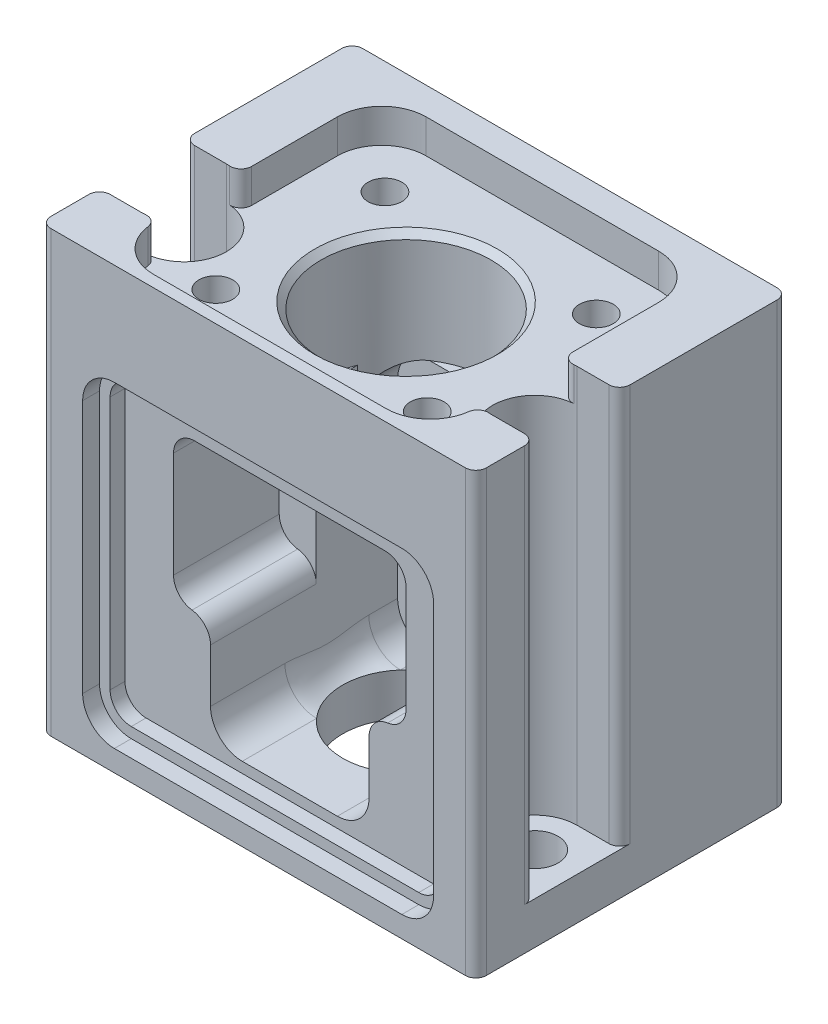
ISO-10303-21;
HEADER;
FILE_DESCRIPTION(('STEP AP214'),'2;1');
FILE_NAME('part.step','',(''),(''),'','','');
FILE_SCHEMA(('AUTOMOTIVE_DESIGN { 1 0 10303 214 1 1 1 1 }'));
ENDSEC;
DATA;
#1=APPLICATION_CONTEXT('core data for automotive mechanical design processes');
#2=APPLICATION_PROTOCOL_DEFINITION('international standard','automotive_design',2000,#1);
#3=PRODUCT_CONTEXT('',#1,'mechanical');
#4=PRODUCT('Part','Part','',(#3));
#5=PRODUCT_RELATED_PRODUCT_CATEGORY('part','',(#4));
#6=PRODUCT_DEFINITION_FORMATION('','',#4);
#7=PRODUCT_DEFINITION_CONTEXT('part definition',#1,'design');
#8=PRODUCT_DEFINITION('design','',#6,#7);
#9=PRODUCT_DEFINITION_SHAPE('','',#8);
#10=(LENGTH_UNIT() NAMED_UNIT(*) SI_UNIT(.MILLI.,.METRE.));
#11=(NAMED_UNIT(*) PLANE_ANGLE_UNIT() SI_UNIT($,.RADIAN.));
#12=(NAMED_UNIT(*) SI_UNIT($,.STERADIAN.) SOLID_ANGLE_UNIT());
#13=UNCERTAINTY_MEASURE_WITH_UNIT(LENGTH_MEASURE(1.E-05),#10,'distance_accuracy_value','');
#14=(GEOMETRIC_REPRESENTATION_CONTEXT(3) GLOBAL_UNCERTAINTY_ASSIGNED_CONTEXT((#13)) GLOBAL_UNIT_ASSIGNED_CONTEXT((#10,
#11,#12)) REPRESENTATION_CONTEXT('',''));
#15=CARTESIAN_POINT('',(0.,0.,0.));
#16=DIRECTION('',(0.,0.,1.));
#17=DIRECTION('',(1.,0.,0.));
#18=AXIS2_PLACEMENT_3D('',#15,#16,#17);
#19=CARTESIAN_POINT('',(0.,0.,0.));
#20=DIRECTION('',(0.,1.,0.));
#21=DIRECTION('',(0.,0.,1.));
#22=AXIS2_PLACEMENT_3D('',#19,#20,#21);
#23=PLANE('',#22);
#24=CARTESIAN_POINT('',(0.,0.,0.875000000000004));
#25=DIRECTION('',(0.,-1.,0.));
#26=DIRECTION('',(0.,0.,-1.));
#27=AXIS2_PLACEMENT_3D('',#24,#25,#26);
#28=CIRCLE('',#27,3.);
#29=CARTESIAN_POINT('',(0.,0.,-2.125));
#30=VERTEX_POINT('',#29);
#31=EDGE_CURVE('E2021',#30,#30,#28,.T.);
#32=ORIENTED_EDGE('',*,*,#31,.F.);
#33=EDGE_LOOP('',(#32));
#34=FACE_BOUND('',#33,.T.);
#35=CARTESIAN_POINT('',(0.,0.,0.875000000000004));
#36=DIRECTION('',(0.,-1.,0.));
#37=DIRECTION('',(0.,0.,-1.));
#38=AXIS2_PLACEMENT_3D('',#35,#36,#37);
#39=CIRCLE('',#38,3.6);
#40=CARTESIAN_POINT('',(0.,0.,-2.72499999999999));
#41=VERTEX_POINT('',#40);
#42=EDGE_CURVE('E2362',#41,#41,#39,.T.);
#43=ORIENTED_EDGE('',*,*,#42,.T.);
#44=EDGE_LOOP('',(#43));
#45=FACE_BOUND('',#44,.T.);
#46=ADVANCED_FACE('F41',(#34,#45),#23,.F.);
#47=CARTESIAN_POINT('',(3.75,2.,-2.475));
#48=DIRECTION('',(0.,-1.,0.));
#49=DIRECTION('',(1.,0.,0.));
#50=AXIS2_PLACEMENT_3D('',#47,#48,#49);
#51=PLANE('',#50);
#52=DIRECTION('',(-1.,0.,0.));
#53=VECTOR('',#52,1.);
#54=CARTESIAN_POINT('',(3.75,2.,6.375));
#55=LINE('',#54,#53);
#56=CARTESIAN_POINT('',(2.25,2.,6.375));
#57=VERTEX_POINT('',#56);
#58=CARTESIAN_POINT('',(-2.25,2.,6.375));
#59=VERTEX_POINT('',#58);
#60=EDGE_CURVE('E1034',#57,#59,#55,.T.);
#61=ORIENTED_EDGE('',*,*,#60,.F.);
#62=DIRECTION('',(0.,0.,1.));
#63=VECTOR('',#62,1.);
#64=CARTESIAN_POINT('',(2.25,2.,-2.475));
#65=LINE('',#64,#63);
#66=CARTESIAN_POINT('',(2.25,2.,2.85931348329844));
#67=VERTEX_POINT('',#66);
#68=EDGE_CURVE('E2289',#57,#67,#65,.F.);
#69=ORIENTED_EDGE('',*,*,#68,.T.);
#70=CARTESIAN_POINT('',(0.,2.,0.875000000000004));
#71=DIRECTION('',(0.,-1.,0.));
#72=DIRECTION('',(1.,0.,0.));
#73=AXIS2_PLACEMENT_3D('',#70,#71,#72);
#74=CIRCLE('',#73,3.);
#75=CARTESIAN_POINT('',(-2.25,2.,2.85931348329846));
#76=VERTEX_POINT('',#75);
#77=EDGE_CURVE('E2030',#67,#76,#74,.T.);
#78=ORIENTED_EDGE('',*,*,#77,.T.);
#79=DIRECTION('',(0.,0.,1.));
#80=VECTOR('',#79,1.);
#81=CARTESIAN_POINT('',(-2.25,2.,6.375));
#82=LINE('',#81,#80);
#83=EDGE_CURVE('E2324',#76,#59,#82,.T.);
#84=ORIENTED_EDGE('',*,*,#83,.T.);
#85=EDGE_LOOP('',(#61,#69,#78,#84));
#86=FACE_BOUND('',#85,.T.);
#87=ADVANCED_FACE('F875',(#86),#51,.F.);
#88=CARTESIAN_POINT('',(0.,2.61558082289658,0.875000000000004));
#89=DIRECTION('',(0.,1.,0.));
#90=DIRECTION('',(0.,0.,1.));
#91=AXIS2_PLACEMENT_3D('',#88,#89,#90);
#92=CYLINDRICAL_SURFACE('',#91,4.025);
#93=CARTESIAN_POINT('',(0.,18.9,0.875000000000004));
#94=DIRECTION('',(0.,1.,0.));
#95=DIRECTION('',(0.,0.,1.));
#96=AXIS2_PLACEMENT_3D('',#93,#94,#95);
#97=CIRCLE('',#96,4.025);
#98=CARTESIAN_POINT('',(0.,18.9,4.9));
#99=VERTEX_POINT('',#98);
#100=EDGE_CURVE('E973',#99,#99,#97,.T.);
#101=ORIENTED_EDGE('',*,*,#100,.T.);
#102=EDGE_LOOP('',(#101));
#103=FACE_BOUND('',#102,.T.);
#104=CARTESIAN_POINT('',(0.,14.,0.875000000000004));
#105=DIRECTION('',(0.,1.,0.));
#106=DIRECTION('',(-1.,0.,0.));
#107=AXIS2_PLACEMENT_3D('',#104,#105,#106);
#108=CIRCLE('',#107,4.025);
#109=CARTESIAN_POINT('',(3.75,14.,-0.587232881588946));
#110=VERTEX_POINT('',#109);
#111=CARTESIAN_POINT('',(3.99382335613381,14.,1.375));
#112=VERTEX_POINT('',#111);
#113=EDGE_CURVE('E548',#110,#112,#108,.F.);
#114=ORIENTED_EDGE('',*,*,#113,.T.);
#115=CARTESIAN_POINT('',(-3.99382335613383,14.,1.375));
#116=VERTEX_POINT('',#115);
#117=EDGE_CURVE('E542',#112,#116,#108,.F.);
#118=ORIENTED_EDGE('',*,*,#117,.T.);
#119=CARTESIAN_POINT('',(-3.75,14.,-0.587232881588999));
#120=VERTEX_POINT('',#119);
#121=EDGE_CURVE('E549',#116,#120,#108,.F.);
#122=ORIENTED_EDGE('',*,*,#121,.T.);
#123=DIRECTION('',(0.,1.,0.));
#124=VECTOR('',#123,1.);
#125=CARTESIAN_POINT('',(-3.75,12.5,-0.587232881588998));
#126=LINE('',#125,#124);
#127=CARTESIAN_POINT('',(-3.75,12.5,-0.587232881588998));
#128=VERTEX_POINT('',#127);
#129=EDGE_CURVE('E2306',#128,#120,#126,.T.);
#130=ORIENTED_EDGE('',*,*,#129,.F.);
#131=CARTESIAN_POINT('',(-3.75,12.5,-0.587232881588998));
#132=CARTESIAN_POINT('',(-3.7500398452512,12.5371091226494,-0.587091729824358));
#133=CARTESIAN_POINT('',(-3.74862556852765,12.5739785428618,-0.590761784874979));
#134=CARTESIAN_POINT('',(-3.74331843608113,12.6457319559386,-0.604280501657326));
#135=CARTESIAN_POINT('',(-3.73947036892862,12.6806396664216,-0.614017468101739));
#136=CARTESIAN_POINT('',(-3.72791790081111,12.7606936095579,-0.642745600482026));
#137=CARTESIAN_POINT('',(-3.71931906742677,12.8049331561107,-0.663816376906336));
#138=CARTESIAN_POINT('',(-3.69913697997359,12.8897714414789,-0.711725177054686));
#139=CARTESIAN_POINT('',(-3.68752798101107,12.930334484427,-0.738612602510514));
#140=CARTESIAN_POINT('',(-3.66190558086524,13.0081368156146,-0.795946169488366));
#141=CARTESIAN_POINT('',(-3.64788645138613,13.0453678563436,-0.82640073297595));
#142=CARTESIAN_POINT('',(-3.61777129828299,13.1170164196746,-0.889536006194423));
#143=CARTESIAN_POINT('',(-3.60167320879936,13.1514310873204,-0.922218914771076));
#144=CARTESIAN_POINT('',(-3.55052303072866,13.2511654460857,-1.02236668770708));
#145=CARTESIAN_POINT('',(-3.51262407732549,13.3129495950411,-1.09190971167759));
#146=CARTESIAN_POINT('',(-3.43623127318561,13.4200353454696,-1.22208498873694));
#147=CARTESIAN_POINT('',(-3.39872671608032,13.4664102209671,-1.28244137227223));
#148=CARTESIAN_POINT('',(-3.31874123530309,13.5541926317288,-1.40356181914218));
#149=CARTESIAN_POINT('',(-3.27625718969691,13.59559701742,-1.46432611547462));
#150=CARTESIAN_POINT('',(-3.18635014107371,13.6733614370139,-1.58538288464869));
#151=CARTESIAN_POINT('',(-3.13892922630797,13.7097235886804,-1.64567554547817));
#152=CARTESIAN_POINT('',(-3.03912657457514,13.7770672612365,-1.76515060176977));
#153=CARTESIAN_POINT('',(-2.9867447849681,13.8080487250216,-1.82433298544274));
#154=CARTESIAN_POINT('',(-2.84872918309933,13.8784970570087,-1.97106532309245));
#155=CARTESIAN_POINT('',(-2.75987533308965,13.9141035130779,-2.05750936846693));
#156=CARTESIAN_POINT('',(-2.57175878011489,13.968323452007,-2.2237573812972));
#157=CARTESIAN_POINT('',(-2.47254240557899,13.9870092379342,-2.30358826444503));
#158=CARTESIAN_POINT('',(-2.34970087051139,13.9968123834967,-2.39304646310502));
#159=CARTESIAN_POINT('',(-2.32995097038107,13.9980001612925,-2.40715587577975));
#160=CARTESIAN_POINT('',(-2.29017676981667,13.9995937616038,-2.43503038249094));
#161=CARTESIAN_POINT('',(-2.27015245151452,13.9999995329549,-2.44879545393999));
#162=CARTESIAN_POINT('',(-2.25,14.,-2.4623829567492));
#163=B_SPLINE_CURVE_WITH_KNOTS('',3,(#131,#132,#133,#134,#135,#136,#137,#138,#139,#140,#141,
#142,#143,#144,#145,#146,#147,#148,#149,#150,#151,#152,#153,#154,#155,#156,#157,#158,#159,#160,
#161,#162),.UNSPECIFIED.,.F.,.F.,(4,2,2,2,2,2,2,2,2,2,2,2,2,2,2,4),(0.,0.110738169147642,
0.219495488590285,0.367900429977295,0.517619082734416,0.667698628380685,0.817928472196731,
1.11849068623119,1.37279406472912,1.62725774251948,1.88161421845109,2.13597339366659,
2.52147224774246,2.90531595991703,2.97820893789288,3.05110668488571),.UNSPECIFIED.);
#164=CARTESIAN_POINT('',(-2.25,14.,-2.4623829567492));
#165=VERTEX_POINT('',#164);
#166=EDGE_CURVE('E2328',#128,#165,#163,.T.);
#167=ORIENTED_EDGE('',*,*,#166,.T.);
#168=CARTESIAN_POINT('',(-2.23117121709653,14.,-2.475));
#169=VERTEX_POINT('',#168);
#170=EDGE_CURVE('E564',#165,#169,#108,.F.);
#171=ORIENTED_EDGE('',*,*,#170,.T.);
#172=CARTESIAN_POINT('',(2.23117121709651,14.,-2.475));
#173=VERTEX_POINT('',#172);
#174=EDGE_CURVE('E563',#169,#173,#108,.F.);
#175=ORIENTED_EDGE('',*,*,#174,.T.);
#176=CARTESIAN_POINT('',(2.25,14.,-2.46238295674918));
#177=VERTEX_POINT('',#176);
#178=EDGE_CURVE('E561',#173,#177,#108,.F.);
#179=ORIENTED_EDGE('',*,*,#178,.T.);
#180=CARTESIAN_POINT('',(2.25,14.,-2.46238295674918));
#181=CARTESIAN_POINT('',(2.30321892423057,13.9999957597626,-2.42651843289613));
#182=CARTESIAN_POINT('',(2.35552438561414,13.9971692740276,-2.38938980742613));
#183=CARTESIAN_POINT('',(2.45789435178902,13.9864139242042,-2.31301285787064));
#184=CARTESIAN_POINT('',(2.50796240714,13.9784934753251,-2.27376812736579));
#185=CARTESIAN_POINT('',(2.60528415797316,13.9581591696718,-2.1937241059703));
#186=CARTESIAN_POINT('',(2.65255488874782,13.9457766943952,-2.15293740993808));
#187=CARTESIAN_POINT('',(2.74448819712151,13.9169691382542,-2.06986979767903));
#188=CARTESIAN_POINT('',(2.78914939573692,13.9005419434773,-2.02758811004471));
#189=CARTESIAN_POINT('',(2.94159161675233,13.8363185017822,-1.87657835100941));
#190=CARTESIAN_POINT('',(3.04218670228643,13.778780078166,-1.76449053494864));
#191=CARTESIAN_POINT('',(3.17970539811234,13.6785092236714,-1.59390855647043));
#192=CARTESIAN_POINT('',(3.22340482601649,13.6426552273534,-1.53649848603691));
#193=CARTESIAN_POINT('',(3.3063464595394,13.5664418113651,-1.42145735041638));
#194=CARTESIAN_POINT('',(3.34559020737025,13.5260839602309,-1.36382636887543));
#195=CARTESIAN_POINT('',(3.43224697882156,13.4263100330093,-1.22943824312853));
#196=CARTESIAN_POINT('',(3.47788991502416,13.3650845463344,-1.15285233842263));
#197=CARTESIAN_POINT('',(3.54004634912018,13.2663393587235,-1.04086170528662));
#198=CARTESIAN_POINT('',(3.55968915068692,13.2323291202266,-1.00406573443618));
#199=CARTESIAN_POINT('',(3.5967990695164,13.1616114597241,-0.932012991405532));
#200=CARTESIAN_POINT('',(3.61426755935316,13.1249057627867,-0.896755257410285));
#201=CARTESIAN_POINT('',(3.64560659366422,13.0511488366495,-0.831280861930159));
#202=CARTESIAN_POINT('',(3.65964909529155,13.014332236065,-0.800884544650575));
#203=CARTESIAN_POINT('',(3.68541656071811,12.9372986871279,-0.743430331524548));
#204=CARTESIAN_POINT('',(3.69714012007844,12.897079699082,-0.716374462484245));
#205=CARTESIAN_POINT('',(3.71572066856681,12.8207723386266,-0.67241815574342));
#206=CARTESIAN_POINT('',(3.72307965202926,12.7853671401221,-0.654565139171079));
#207=CARTESIAN_POINT('',(3.73540002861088,12.7120241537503,-0.624226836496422));
#208=CARTESIAN_POINT('',(3.74037342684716,12.6741001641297,-0.611714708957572));
#209=CARTESIAN_POINT('',(3.74588690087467,12.6131893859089,-0.597748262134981));
#210=CARTESIAN_POINT('',(3.74741416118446,12.5908470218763,-0.593851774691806));
#211=CARTESIAN_POINT('',(3.74947755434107,12.5456818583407,-0.588572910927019));
#212=CARTESIAN_POINT('',(3.75000733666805,12.5228569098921,-0.587206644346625));
#213=CARTESIAN_POINT('',(3.75,12.5,-0.587232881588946));
#214=B_SPLINE_CURVE_WITH_KNOTS('',3,(#180,#181,#182,#183,#184,#185,#186,#187,#188,#189,#190,
#191,#192,#193,#194,#195,#196,#197,#198,#199,#200,#201,#202,#203,#204,#205,#206,#207,#208,#209,
#210,#211,#212,#213),.UNSPECIFIED.,.F.,.F.,(4,2,2,2,2,2,2,2,2,2,2,2,2,2,2,2,4),(0.,
0.192371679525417,0.384426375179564,0.575155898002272,0.765985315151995,1.24672522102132,
1.48825969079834,1.72971030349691,2.05339821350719,2.21476035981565,2.37602012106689,
2.52512370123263,2.67431730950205,2.79495005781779,2.9149691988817,2.98300730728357,
3.05147713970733),.UNSPECIFIED.);
#215=CARTESIAN_POINT('',(3.75,12.5,-0.587232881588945));
#216=VERTEX_POINT('',#215);
#217=EDGE_CURVE('E2013',#177,#216,#214,.T.);
#218=ORIENTED_EDGE('',*,*,#217,.T.);
#219=DIRECTION('',(0.,1.,0.));
#220=VECTOR('',#219,1.);
#221=CARTESIAN_POINT('',(3.75,14.,-0.587232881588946));
#222=LINE('',#221,#220);
#223=EDGE_CURVE('E560',#110,#216,#222,.F.);
#224=ORIENTED_EDGE('',*,*,#223,.F.);
#225=EDGE_LOOP('',(#114,#118,#122,#130,#167,#171,#175,#179,#218,#224));
#226=FACE_BOUND('',#225,.T.);
#227=ADVANCED_FACE('F558',(#103,#226),#92,.F.);
#228=CARTESIAN_POINT('',(-8.30000000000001,20.8,3.07500000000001));
#229=DIRECTION('',(0.,1.,0.));
#230=DIRECTION('',(0.,0.,1.));
#231=AXIS2_PLACEMENT_3D('',#228,#229,#230);
#232=PLANE('',#231);
#233=CARTESIAN_POINT('',(-8.30000000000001,20.8,3.07500000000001));
#234=DIRECTION('',(0.,-1.,0.));
#235=DIRECTION('',(0.,0.,1.));
#236=AXIS2_PLACEMENT_3D('',#233,#234,#235);
#237=CIRCLE('',#236,2.);
#238=CARTESIAN_POINT('',(-8.30000000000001,20.8,1.07500000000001));
#239=VERTEX_POINT('',#238);
#240=CARTESIAN_POINT('',(-8.14000000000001,20.8,1.08141027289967));
#241=VERTEX_POINT('',#240);
#242=EDGE_CURVE('E2098',#239,#241,#237,.T.);
#243=ORIENTED_EDGE('',*,*,#242,.T.);
#244=CARTESIAN_POINT('',(-8.10000000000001,20.8,0.583012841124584));
#245=DIRECTION('',(0.,1.,0.));
#246=DIRECTION('',(0.,0.,1.));
#247=AXIS2_PLACEMENT_3D('',#244,#245,#246);
#248=CIRCLE('',#247,0.5);
#249=CARTESIAN_POINT('',(-7.60000000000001,20.8,0.583012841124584));
#250=VERTEX_POINT('',#249);
#251=EDGE_CURVE('E1990',#241,#250,#248,.T.);
#252=ORIENTED_EDGE('',*,*,#251,.T.);
#253=DIRECTION('',(0.,0.,1.));
#254=VECTOR('',#253,1.);
#255=CARTESIAN_POINT('',(-7.60000000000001,20.8,5.22500000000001));
#256=LINE('',#255,#254);
#257=CARTESIAN_POINT('',(-7.60000000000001,20.8,-3.47499999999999));
#258=VERTEX_POINT('',#257);
#259=EDGE_CURVE('E2064',#258,#250,#256,.T.);
#260=ORIENTED_EDGE('',*,*,#259,.F.);
#261=CARTESIAN_POINT('',(-5.50000000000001,20.8,-3.47499999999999));
#262=DIRECTION('',(0.,1.,0.));
#263=DIRECTION('',(0.,0.,1.));
#264=AXIS2_PLACEMENT_3D('',#261,#262,#263);
#265=CIRCLE('',#264,2.1);
#266=CARTESIAN_POINT('',(-5.50000000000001,20.8,-5.57499999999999));
#267=VERTEX_POINT('',#266);
#268=EDGE_CURVE('E2036',#267,#258,#265,.T.);
#269=ORIENTED_EDGE('',*,*,#268,.F.);
#270=DIRECTION('',(-1.,0.,0.));
#271=VECTOR('',#270,1.);
#272=CARTESIAN_POINT('',(-5.50000000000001,20.8,-5.57499999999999));
#273=LINE('',#272,#271);
#274=CARTESIAN_POINT('',(5.49999999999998,20.8,-5.57499999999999));
#275=VERTEX_POINT('',#274);
#276=EDGE_CURVE('E2042',#275,#267,#273,.T.);
#277=ORIENTED_EDGE('',*,*,#276,.F.);
#278=CARTESIAN_POINT('',(5.49999999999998,20.8,-3.47499999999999));
#279=DIRECTION('',(0.,1.,0.));
#280=DIRECTION('',(0.,0.,1.));
#281=AXIS2_PLACEMENT_3D('',#278,#279,#280);
#282=CIRCLE('',#281,2.1);
#283=CARTESIAN_POINT('',(7.59999999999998,20.8,-3.47499999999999));
#284=VERTEX_POINT('',#283);
#285=EDGE_CURVE('E2075',#284,#275,#282,.T.);
#286=ORIENTED_EDGE('',*,*,#285,.F.);
#287=DIRECTION('',(0.,0.,-1.));
#288=VECTOR('',#287,1.);
#289=CARTESIAN_POINT('',(7.59999999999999,20.8,3.07500000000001));
#290=LINE('',#289,#288);
#291=CARTESIAN_POINT('',(7.59999999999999,20.8,0.582093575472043));
#292=VERTEX_POINT('',#291);
#293=EDGE_CURVE('E705',#292,#284,#290,.T.);
#294=ORIENTED_EDGE('',*,*,#293,.F.);
#295=CARTESIAN_POINT('',(8.09999999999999,20.8,0.582093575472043));
#296=DIRECTION('',(0.,1.,0.));
#297=DIRECTION('',(0.,0.,1.));
#298=AXIS2_PLACEMENT_3D('',#295,#296,#297);
#299=CIRCLE('',#298,0.5);
#300=CARTESIAN_POINT('',(8.13763910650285,20.8,1.0806748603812));
#301=VERTEX_POINT('',#300);
#302=EDGE_CURVE('E1992',#292,#301,#299,.T.);
#303=ORIENTED_EDGE('',*,*,#302,.T.);
#304=CARTESIAN_POINT('',(8.2881955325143,20.8,3.07500000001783));
#305=DIRECTION('',(0.,-1.,0.));
#306=DIRECTION('',(0.,0.,1.));
#307=AXIS2_PLACEMENT_3D('',#304,#305,#306);
#308=CIRCLE('',#307,2.);
#309=CARTESIAN_POINT('',(8.2881955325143,20.8,1.07500000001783));
#310=VERTEX_POINT('',#309);
#311=EDGE_CURVE('E2113',#301,#310,#308,.T.);
#312=ORIENTED_EDGE('',*,*,#311,.T.);
#313=DIRECTION('',(1.,0.,0.));
#314=VECTOR('',#313,1.);
#315=CARTESIAN_POINT('',(8.2881955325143,20.8,1.07500000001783));
#316=LINE('',#315,#314);
#317=CARTESIAN_POINT('',(9.8,20.8,1.07500000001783));
#318=VERTEX_POINT('',#317);
#319=EDGE_CURVE('E2117',#310,#318,#316,.T.);
#320=ORIENTED_EDGE('',*,*,#319,.T.);
#321=CARTESIAN_POINT('',(9.8,20.8,0.575000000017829));
#322=DIRECTION('',(0.,1.,0.));
#323=DIRECTION('',(0.,0.,1.));
#324=AXIS2_PLACEMENT_3D('',#321,#322,#323);
#325=CIRCLE('',#324,0.5);
#326=CARTESIAN_POINT('',(10.3,20.8,0.575000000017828));
#327=VERTEX_POINT('',#326);
#328=EDGE_CURVE('E1994',#318,#327,#325,.T.);
#329=ORIENTED_EDGE('',*,*,#328,.T.);
#330=DIRECTION('',(0.,0.,-1.));
#331=VECTOR('',#330,1.);
#332=CARTESIAN_POINT('',(10.3,20.8,1.07500000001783));
#333=LINE('',#332,#331);
#334=CARTESIAN_POINT('',(10.3,20.8,-6.375));
#335=VERTEX_POINT('',#334);
#336=EDGE_CURVE('E2120',#327,#335,#333,.T.);
#337=ORIENTED_EDGE('',*,*,#336,.T.);
#338=CARTESIAN_POINT('',(9.8,20.8,-6.375));
#339=DIRECTION('',(0.,1.,0.));
#340=DIRECTION('',(0.,0.,1.));
#341=AXIS2_PLACEMENT_3D('',#338,#339,#340);
#342=CIRCLE('',#341,0.5);
#343=CARTESIAN_POINT('',(9.8,20.8,-6.875));
#344=VERTEX_POINT('',#343);
#345=EDGE_CURVE('E1999',#335,#344,#342,.T.);
#346=ORIENTED_EDGE('',*,*,#345,.T.);
#347=DIRECTION('',(-1.,0.,0.));
#348=VECTOR('',#347,1.);
#349=CARTESIAN_POINT('',(10.3,20.8,-6.875));
#350=LINE('',#349,#348);
#351=CARTESIAN_POINT('',(-9.8,20.8,-6.875));
#352=VERTEX_POINT('',#351);
#353=EDGE_CURVE('E2123',#344,#352,#350,.T.);
#354=ORIENTED_EDGE('',*,*,#353,.T.);
#355=CARTESIAN_POINT('',(-9.8,20.8,-6.375));
#356=DIRECTION('',(0.,1.,0.));
#357=DIRECTION('',(0.,0.,1.));
#358=AXIS2_PLACEMENT_3D('',#355,#356,#357);
#359=CIRCLE('',#358,0.5);
#360=CARTESIAN_POINT('',(-10.3,20.8,-6.375));
#361=VERTEX_POINT('',#360);
#362=EDGE_CURVE('E1997',#352,#361,#359,.T.);
#363=ORIENTED_EDGE('',*,*,#362,.T.);
#364=DIRECTION('',(0.,0.,1.));
#365=VECTOR('',#364,1.);
#366=CARTESIAN_POINT('',(-10.3,20.8,-6.875));
#367=LINE('',#366,#365);
#368=CARTESIAN_POINT('',(-10.3,20.8,0.575000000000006));
#369=VERTEX_POINT('',#368);
#370=EDGE_CURVE('E2126',#361,#369,#367,.T.);
#371=ORIENTED_EDGE('',*,*,#370,.T.);
#372=CARTESIAN_POINT('',(-9.8,20.8,0.575000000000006));
#373=DIRECTION('',(0.,1.,0.));
#374=DIRECTION('',(0.,0.,1.));
#375=AXIS2_PLACEMENT_3D('',#372,#373,#374);
#376=CIRCLE('',#375,0.5);
#377=CARTESIAN_POINT('',(-9.8,20.8,1.07500000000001));
#378=VERTEX_POINT('',#377);
#379=EDGE_CURVE('E1941',#369,#378,#376,.T.);
#380=ORIENTED_EDGE('',*,*,#379,.T.);
#381=DIRECTION('',(1.,0.,0.));
#382=VECTOR('',#381,1.);
#383=CARTESIAN_POINT('',(-10.3,20.8,1.07500000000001));
#384=LINE('',#383,#382);
#385=EDGE_CURVE('E2128',#378,#239,#384,.T.);
#386=ORIENTED_EDGE('',*,*,#385,.T.);
#387=EDGE_LOOP('',(#243,#252,#260,#269,#277,#286,#294,#303,#312,#320,#329,#337,#346,#354,#363,
#371,#380,#386));
#388=FACE_BOUND('',#387,.T.);
#389=ADVANCED_FACE('F1388',(#388),#232,.T.);
#390=CARTESIAN_POINT('',(10.3,22.,-6.875));
#391=DIRECTION('',(-1.,0.,0.));
#392=DIRECTION('',(0.,0.,1.));
#393=AXIS2_PLACEMENT_3D('',#390,#391,#392);
#394=PLANE('',#393);
#395=DIRECTION('',(0.,0.,-1.));
#396=VECTOR('',#395,1.);
#397=CARTESIAN_POINT('',(10.3,2.,1.07500000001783));
#398=LINE('',#397,#396);
#399=CARTESIAN_POINT('',(10.3,2.,5.57500000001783));
#400=VERTEX_POINT('',#399);
#401=CARTESIAN_POINT('',(10.3,2.,0.575000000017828));
#402=VERTEX_POINT('',#401);
#403=EDGE_CURVE('E623',#400,#402,#398,.T.);
#404=ORIENTED_EDGE('',*,*,#403,.F.);
#405=DIRECTION('',(0.,1.,0.));
#406=VECTOR('',#405,1.);
#407=CARTESIAN_POINT('',(10.3,22.,5.57500000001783));
#408=LINE('',#407,#406);
#409=CARTESIAN_POINT('',(10.3,20.8,5.57500000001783));
#410=VERTEX_POINT('',#409);
#411=EDGE_CURVE('E1955',#400,#410,#408,.T.);
#412=ORIENTED_EDGE('',*,*,#411,.T.);
#413=DIRECTION('',(0.,0.,-1.));
#414=VECTOR('',#413,1.);
#415=CARTESIAN_POINT('',(10.3,20.8,7.875));
#416=LINE('',#415,#414);
#417=CARTESIAN_POINT('',(10.3,20.8,7.375));
#418=VERTEX_POINT('',#417);
#419=EDGE_CURVE('E2108',#418,#410,#416,.T.);
#420=ORIENTED_EDGE('',*,*,#419,.F.);
#421=DIRECTION('',(0.,1.,0.));
#422=VECTOR('',#421,1.);
#423=CARTESIAN_POINT('',(10.3,0.,7.375));
#424=LINE('',#423,#422);
#425=CARTESIAN_POINT('',(10.3,0.,7.375));
#426=VERTEX_POINT('',#425);
#427=EDGE_CURVE('E1963',#418,#426,#424,.F.);
#428=ORIENTED_EDGE('',*,*,#427,.T.);
#429=DIRECTION('',(0.,0.,-1.));
#430=VECTOR('',#429,1.);
#431=CARTESIAN_POINT('',(10.3,0.,-6.875));
#432=LINE('',#431,#430);
#433=CARTESIAN_POINT('',(10.3,0.,-6.375));
#434=VERTEX_POINT('',#433);
#435=EDGE_CURVE('E653',#426,#434,#432,.T.);
#436=ORIENTED_EDGE('',*,*,#435,.T.);
#437=DIRECTION('',(0.,-1.,0.));
#438=VECTOR('',#437,1.);
#439=CARTESIAN_POINT('',(10.3,22.,-6.375));
#440=LINE('',#439,#438);
#441=EDGE_CURVE('E1961',#434,#335,#440,.F.);
#442=ORIENTED_EDGE('',*,*,#441,.T.);
#443=ORIENTED_EDGE('',*,*,#336,.F.);
#444=DIRECTION('',(0.,1.,0.));
#445=VECTOR('',#444,1.);
#446=CARTESIAN_POINT('',(10.3,22.,0.575000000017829));
#447=LINE('',#446,#445);
#448=EDGE_CURVE('E1958',#327,#402,#447,.F.);
#449=ORIENTED_EDGE('',*,*,#448,.T.);
#450=EDGE_LOOP('',(#404,#412,#420,#428,#436,#442,#443,#449));
#451=FACE_BOUND('',#450,.T.);
#452=ADVANCED_FACE('F1708',(#451),#394,.F.);
#453=CARTESIAN_POINT('',(-10.3,22.,-6.875));
#454=DIRECTION('',(0.,0.,1.));
#455=DIRECTION('',(1.,0.,0.));
#456=AXIS2_PLACEMENT_3D('',#453,#454,#455);
#457=PLANE('',#456);
#458=DIRECTION('',(-1.,0.,0.));
#459=VECTOR('',#458,1.);
#460=CARTESIAN_POINT('',(-10.3,0.,-6.875));
#461=LINE('',#460,#459);
#462=CARTESIAN_POINT('',(9.79999999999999,0.,-6.875));
#463=VERTEX_POINT('',#462);
#464=CARTESIAN_POINT('',(-9.8,0.,-6.875));
#465=VERTEX_POINT('',#464);
#466=EDGE_CURVE('E656',#463,#465,#461,.T.);
#467=ORIENTED_EDGE('',*,*,#466,.T.);
#468=DIRECTION('',(0.,-1.,0.));
#469=VECTOR('',#468,1.);
#470=CARTESIAN_POINT('',(-9.8,22.,-6.875));
#471=LINE('',#470,#469);
#472=EDGE_CURVE('E948',#465,#352,#471,.F.);
#473=ORIENTED_EDGE('',*,*,#472,.T.);
#474=ORIENTED_EDGE('',*,*,#353,.F.);
#475=DIRECTION('',(0.,-1.,0.));
#476=VECTOR('',#475,1.);
#477=CARTESIAN_POINT('',(9.8,22.,-6.875));
#478=LINE('',#477,#476);
#479=EDGE_CURVE('E945',#344,#463,#478,.T.);
#480=ORIENTED_EDGE('',*,*,#479,.T.);
#481=EDGE_LOOP('',(#467,#473,#474,#480));
#482=FACE_BOUND('',#481,.T.);
#483=ADVANCED_FACE('F1715',(#482),#457,.F.);
#484=CARTESIAN_POINT('',(-10.3,22.,-6.875));
#485=DIRECTION('',(1.,0.,0.));
#486=DIRECTION('',(0.,0.,-1.));
#487=AXIS2_PLACEMENT_3D('',#484,#485,#486);
#488=PLANE('',#487);
#489=DIRECTION('',(0.,0.,1.));
#490=VECTOR('',#489,1.);
#491=CARTESIAN_POINT('',(-10.3,2.,5.07500000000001));
#492=LINE('',#491,#490);
#493=CARTESIAN_POINT('',(-10.3,2.,0.575000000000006));
#494=VERTEX_POINT('',#493);
#495=CARTESIAN_POINT('',(-10.3,2.,5.57500000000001));
#496=VERTEX_POINT('',#495);
#497=EDGE_CURVE('E607',#494,#496,#492,.T.);
#498=ORIENTED_EDGE('',*,*,#497,.F.);
#499=DIRECTION('',(0.,1.,0.));
#500=VECTOR('',#499,1.);
#501=CARTESIAN_POINT('',(-10.3,22.,0.575000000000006));
#502=LINE('',#501,#500);
#503=EDGE_CURVE('E1931',#494,#369,#502,.T.);
#504=ORIENTED_EDGE('',*,*,#503,.T.);
#505=ORIENTED_EDGE('',*,*,#370,.F.);
#506=DIRECTION('',(0.,-1.,0.));
#507=VECTOR('',#506,1.);
#508=CARTESIAN_POINT('',(-10.3,22.,-6.375));
#509=LINE('',#508,#507);
#510=CARTESIAN_POINT('',(-10.3,0.,-6.375));
#511=VERTEX_POINT('',#510);
#512=EDGE_CURVE('E1947',#361,#511,#509,.T.);
#513=ORIENTED_EDGE('',*,*,#512,.T.);
#514=DIRECTION('',(0.,0.,1.));
#515=VECTOR('',#514,1.);
#516=CARTESIAN_POINT('',(-10.3,0.,-6.875));
#517=LINE('',#516,#515);
#518=CARTESIAN_POINT('',(-10.3,0.,7.375));
#519=VERTEX_POINT('',#518);
#520=EDGE_CURVE('E659',#511,#519,#517,.T.);
#521=ORIENTED_EDGE('',*,*,#520,.T.);
#522=DIRECTION('',(0.,-1.,0.));
#523=VECTOR('',#522,1.);
#524=CARTESIAN_POINT('',(-10.3,20.8,7.375));
#525=LINE('',#524,#523);
#526=CARTESIAN_POINT('',(-10.3,20.8,7.375));
#527=VERTEX_POINT('',#526);
#528=EDGE_CURVE('E1943',#519,#527,#525,.F.);
#529=ORIENTED_EDGE('',*,*,#528,.T.);
#530=DIRECTION('',(0.,0.,1.));
#531=VECTOR('',#530,1.);
#532=CARTESIAN_POINT('',(-10.3,20.8,5.07500000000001));
#533=LINE('',#532,#531);
#534=CARTESIAN_POINT('',(-10.3,20.8,5.57500000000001));
#535=VERTEX_POINT('',#534);
#536=EDGE_CURVE('E2103',#535,#527,#533,.T.);
#537=ORIENTED_EDGE('',*,*,#536,.F.);
#538=DIRECTION('',(0.,1.,0.));
#539=VECTOR('',#538,1.);
#540=CARTESIAN_POINT('',(-10.3,22.,5.57500000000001));
#541=LINE('',#540,#539);
#542=EDGE_CURVE('E1935',#535,#496,#541,.F.);
#543=ORIENTED_EDGE('',*,*,#542,.T.);
#544=EDGE_LOOP('',(#498,#504,#505,#513,#521,#529,#537,#543));
#545=FACE_BOUND('',#544,.T.);
#546=ADVANCED_FACE('F1146',(#545),#488,.F.);
#547=CARTESIAN_POINT('',(8.2881955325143,2.,3.07500000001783));
#548=DIRECTION('',(0.,1.,0.));
#549=DIRECTION('',(0.,0.,1.));
#550=AXIS2_PLACEMENT_3D('',#547,#548,#549);
#551=CYLINDRICAL_SURFACE('',#550,2.);
#552=CARTESIAN_POINT('',(8.2881955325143,19.2,3.07500000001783));
#553=DIRECTION('',(0.,1.,0.));
#554=DIRECTION('',(0.,0.,1.));
#555=AXIS2_PLACEMENT_3D('',#552,#553,#554);
#556=CIRCLE('',#555,2.);
#557=CARTESIAN_POINT('',(8.11966069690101,19.2,5.06788635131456));
#558=VERTEX_POINT('',#557);
#559=CARTESIAN_POINT('',(8.13763910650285,19.2,1.0806748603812));
#560=VERTEX_POINT('',#559);
#561=EDGE_CURVE('E2095',#558,#560,#556,.F.);
#562=ORIENTED_EDGE('',*,*,#561,.F.);
#563=DIRECTION('',(0.,1.,0.));
#564=VECTOR('',#563,1.);
#565=CARTESIAN_POINT('',(8.11966069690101,2.,5.06788635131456));
#566=LINE('',#565,#564);
#567=CARTESIAN_POINT('',(8.11966069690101,20.8,5.06788635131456));
#568=VERTEX_POINT('',#567);
#569=EDGE_CURVE('E1969',#558,#568,#566,.T.);
#570=ORIENTED_EDGE('',*,*,#569,.T.);
#571=CARTESIAN_POINT('',(8.2881955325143,20.8,5.07500000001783));
#572=VERTEX_POINT('',#571);
#573=EDGE_CURVE('E2114',#572,#568,#308,.T.);
#574=ORIENTED_EDGE('',*,*,#573,.F.);
#575=DIRECTION('',(0.,1.,0.));
#576=VECTOR('',#575,1.);
#577=CARTESIAN_POINT('',(8.2881955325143,2.,5.07500000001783));
#578=LINE('',#577,#576);
#579=CARTESIAN_POINT('',(8.2881955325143,2.,5.07500000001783));
#580=VERTEX_POINT('',#579);
#581=EDGE_CURVE('E627',#580,#572,#578,.T.);
#582=ORIENTED_EDGE('',*,*,#581,.F.);
#583=CARTESIAN_POINT('',(8.2881955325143,2.,3.07500000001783));
#584=DIRECTION('',(0.,1.,0.));
#585=DIRECTION('',(0.,0.,1.));
#586=AXIS2_PLACEMENT_3D('',#583,#584,#585);
#587=CIRCLE('',#586,2.);
#588=CARTESIAN_POINT('',(8.2881955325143,2.,1.07500000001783));
#589=VERTEX_POINT('',#588);
#590=EDGE_CURVE('E615',#589,#580,#587,.T.);
#591=ORIENTED_EDGE('',*,*,#590,.F.);
#592=DIRECTION('',(0.,1.,0.));
#593=VECTOR('',#592,1.);
#594=CARTESIAN_POINT('',(8.2881955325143,2.,1.07500000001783));
#595=LINE('',#594,#593);
#596=EDGE_CURVE('E628',#589,#310,#595,.T.);
#597=ORIENTED_EDGE('',*,*,#596,.T.);
#598=ORIENTED_EDGE('',*,*,#311,.F.);
#599=DIRECTION('',(0.,1.,0.));
#600=VECTOR('',#599,1.);
#601=CARTESIAN_POINT('',(8.13763910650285,2.,1.0806748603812));
#602=LINE('',#601,#600);
#603=EDGE_CURVE('E1972',#301,#560,#602,.F.);
#604=ORIENTED_EDGE('',*,*,#603,.T.);
#605=EDGE_LOOP('',(#562,#570,#574,#582,#591,#597,#598,#604));
#606=FACE_BOUND('',#605,.T.);
#607=ADVANCED_FACE('F1139',(#606),#551,.F.);
#608=CARTESIAN_POINT('',(8.2881955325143,2.,1.07500000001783));
#609=DIRECTION('',(0.,0.,-1.));
#610=DIRECTION('',(-1.,0.,0.));
#611=AXIS2_PLACEMENT_3D('',#608,#609,#610);
#612=PLANE('',#611);
#613=DIRECTION('',(-1.,0.,0.));
#614=VECTOR('',#613,1.);
#615=CARTESIAN_POINT('',(8.2881955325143,2.,1.07500000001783));
#616=LINE('',#615,#614);
#617=CARTESIAN_POINT('',(9.8,2.,1.07500000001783));
#618=VERTEX_POINT('',#617);
#619=EDGE_CURVE('E625',#618,#589,#616,.T.);
#620=ORIENTED_EDGE('',*,*,#619,.F.);
#621=DIRECTION('',(0.,1.,0.));
#622=VECTOR('',#621,1.);
#623=CARTESIAN_POINT('',(9.8,2.,1.07500000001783));
#624=LINE('',#623,#622);
#625=EDGE_CURVE('E1950',#618,#318,#624,.T.);
#626=ORIENTED_EDGE('',*,*,#625,.T.);
#627=ORIENTED_EDGE('',*,*,#319,.F.);
#628=ORIENTED_EDGE('',*,*,#596,.F.);
#629=EDGE_LOOP('',(#620,#626,#627,#628));
#630=FACE_BOUND('',#629,.T.);
#631=ADVANCED_FACE('F1136',(#630),#612,.F.);
#632=CARTESIAN_POINT('',(8.2881955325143,2.,5.07500000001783));
#633=DIRECTION('',(0.,0.,1.));
#634=DIRECTION('',(1.,0.,0.));
#635=AXIS2_PLACEMENT_3D('',#632,#633,#634);
#636=PLANE('',#635);
#637=DIRECTION('',(-1.,0.,0.));
#638=VECTOR('',#637,1.);
#639=CARTESIAN_POINT('',(10.3,20.8,5.07500000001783));
#640=LINE('',#639,#638);
#641=CARTESIAN_POINT('',(9.8,20.8,5.07500000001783));
#642=VERTEX_POINT('',#641);
#643=EDGE_CURVE('E2111',#642,#572,#640,.T.);
#644=ORIENTED_EDGE('',*,*,#643,.F.);
#645=DIRECTION('',(0.,1.,0.));
#646=VECTOR('',#645,1.);
#647=CARTESIAN_POINT('',(9.8,2.,5.07500000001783));
#648=LINE('',#647,#646);
#649=CARTESIAN_POINT('',(9.8,2.,5.07500000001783));
#650=VERTEX_POINT('',#649);
#651=EDGE_CURVE('E1953',#642,#650,#648,.F.);
#652=ORIENTED_EDGE('',*,*,#651,.T.);
#653=DIRECTION('',(1.,0.,0.));
#654=VECTOR('',#653,1.);
#655=CARTESIAN_POINT('',(8.2881955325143,2.,5.07500000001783));
#656=LINE('',#655,#654);
#657=EDGE_CURVE('E620',#580,#650,#656,.T.);
#658=ORIENTED_EDGE('',*,*,#657,.F.);
#659=ORIENTED_EDGE('',*,*,#581,.T.);
#660=EDGE_LOOP('',(#644,#652,#658,#659));
#661=FACE_BOUND('',#660,.T.);
#662=ADVANCED_FACE('F1130',(#661),#636,.F.);
#663=CARTESIAN_POINT('',(-8.30000000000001,2.,3.07500000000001));
#664=DIRECTION('',(0.,1.,0.));
#665=DIRECTION('',(0.,0.,1.));
#666=AXIS2_PLACEMENT_3D('',#663,#664,#665);
#667=CYLINDRICAL_SURFACE('',#666,2.);
#668=CARTESIAN_POINT('',(-8.30000000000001,19.2,3.07500000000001));
#669=DIRECTION('',(0.,1.,0.));
#670=DIRECTION('',(0.,0.,1.));
#671=AXIS2_PLACEMENT_3D('',#668,#669,#670);
#672=CIRCLE('',#671,2.);
#673=CARTESIAN_POINT('',(-8.14000000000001,19.2,1.08141027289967));
#674=VERTEX_POINT('',#673);
#675=CARTESIAN_POINT('',(-8.12212883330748,19.2,5.06707475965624));
#676=VERTEX_POINT('',#675);
#677=EDGE_CURVE('E2082',#674,#676,#672,.F.);
#678=ORIENTED_EDGE('',*,*,#677,.F.);
#679=DIRECTION('',(0.,1.,0.));
#680=VECTOR('',#679,1.);
#681=CARTESIAN_POINT('',(-8.14000000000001,2.,1.08141027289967));
#682=LINE('',#681,#680);
#683=EDGE_CURVE('E2000',#674,#241,#682,.T.);
#684=ORIENTED_EDGE('',*,*,#683,.T.);
#685=ORIENTED_EDGE('',*,*,#242,.F.);
#686=DIRECTION('',(0.,1.,0.));
#687=VECTOR('',#686,1.);
#688=CARTESIAN_POINT('',(-8.30000000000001,2.,1.07500000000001));
#689=LINE('',#688,#687);
#690=CARTESIAN_POINT('',(-8.30000000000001,2.,1.07500000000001));
#691=VERTEX_POINT('',#690);
#692=EDGE_CURVE('E611',#691,#239,#689,.T.);
#693=ORIENTED_EDGE('',*,*,#692,.F.);
#694=CARTESIAN_POINT('',(-8.30000000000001,2.,3.07500000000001));
#695=DIRECTION('',(0.,1.,0.));
#696=DIRECTION('',(0.,0.,1.));
#697=AXIS2_PLACEMENT_3D('',#694,#695,#696);
#698=CIRCLE('',#697,2.);
#699=CARTESIAN_POINT('',(-8.30000000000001,2.,5.07500000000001));
#700=VERTEX_POINT('',#699);
#701=EDGE_CURVE('E601',#700,#691,#698,.T.);
#702=ORIENTED_EDGE('',*,*,#701,.F.);
#703=DIRECTION('',(0.,1.,0.));
#704=VECTOR('',#703,1.);
#705=CARTESIAN_POINT('',(-8.30000000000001,2.,5.07500000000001));
#706=LINE('',#705,#704);
#707=CARTESIAN_POINT('',(-8.30000000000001,20.8,5.07500000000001));
#708=VERTEX_POINT('',#707);
#709=EDGE_CURVE('E612',#700,#708,#706,.T.);
#710=ORIENTED_EDGE('',*,*,#709,.T.);
#711=CARTESIAN_POINT('',(-8.12212883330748,20.8,5.06707475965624));
#712=VERTEX_POINT('',#711);
#713=EDGE_CURVE('E2097',#712,#708,#237,.T.);
#714=ORIENTED_EDGE('',*,*,#713,.F.);
#715=DIRECTION('',(0.,1.,0.));
#716=VECTOR('',#715,1.);
#717=CARTESIAN_POINT('',(-8.12212883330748,2.,5.06707475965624));
#718=LINE('',#717,#716);
#719=EDGE_CURVE('E788',#712,#676,#718,.F.);
#720=ORIENTED_EDGE('',*,*,#719,.T.);
#721=EDGE_LOOP('',(#678,#684,#685,#693,#702,#710,#714,#720));
#722=FACE_BOUND('',#721,.T.);
#723=ADVANCED_FACE('F1125',(#722),#667,.F.);
#724=CARTESIAN_POINT('',(-8.30000000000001,2.,5.07500000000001));
#725=DIRECTION('',(0.,0.,1.));
#726=DIRECTION('',(1.,0.,0.));
#727=AXIS2_PLACEMENT_3D('',#724,#725,#726);
#728=PLANE('',#727);
#729=DIRECTION('',(1.,0.,0.));
#730=VECTOR('',#729,1.);
#731=CARTESIAN_POINT('',(-8.30000000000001,2.,5.07500000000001));
#732=LINE('',#731,#730);
#733=CARTESIAN_POINT('',(-9.8,2.,5.07500000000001));
#734=VERTEX_POINT('',#733);
#735=EDGE_CURVE('E609',#734,#700,#732,.T.);
#736=ORIENTED_EDGE('',*,*,#735,.F.);
#737=DIRECTION('',(0.,1.,0.));
#738=VECTOR('',#737,1.);
#739=CARTESIAN_POINT('',(-9.8,2.,5.07500000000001));
#740=LINE('',#739,#738);
#741=CARTESIAN_POINT('',(-9.8,20.8,5.07500000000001));
#742=VERTEX_POINT('',#741);
#743=EDGE_CURVE('E931',#734,#742,#740,.T.);
#744=ORIENTED_EDGE('',*,*,#743,.T.);
#745=DIRECTION('',(-1.,0.,0.));
#746=VECTOR('',#745,1.);
#747=CARTESIAN_POINT('',(-8.30000000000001,20.8,5.07500000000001));
#748=LINE('',#747,#746);
#749=EDGE_CURVE('E2100',#708,#742,#748,.T.);
#750=ORIENTED_EDGE('',*,*,#749,.F.);
#751=ORIENTED_EDGE('',*,*,#709,.F.);
#752=EDGE_LOOP('',(#736,#744,#750,#751));
#753=FACE_BOUND('',#752,.T.);
#754=ADVANCED_FACE('F1107',(#753),#728,.F.);
#755=CARTESIAN_POINT('',(-8.30000000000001,2.,1.07500000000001));
#756=DIRECTION('',(0.,0.,-1.));
#757=DIRECTION('',(-1.,0.,0.));
#758=AXIS2_PLACEMENT_3D('',#755,#756,#757);
#759=PLANE('',#758);
#760=ORIENTED_EDGE('',*,*,#385,.F.);
#761=DIRECTION('',(0.,1.,0.));
#762=VECTOR('',#761,1.);
#763=CARTESIAN_POINT('',(-9.8,2.,1.07500000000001));
#764=LINE('',#763,#762);
#765=CARTESIAN_POINT('',(-9.8,2.,1.07500000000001));
#766=VERTEX_POINT('',#765);
#767=EDGE_CURVE('E935',#378,#766,#764,.F.);
#768=ORIENTED_EDGE('',*,*,#767,.T.);
#769=DIRECTION('',(-1.,0.,0.));
#770=VECTOR('',#769,1.);
#771=CARTESIAN_POINT('',(-8.30000000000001,2.,1.07500000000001));
#772=LINE('',#771,#770);
#773=EDGE_CURVE('E604',#691,#766,#772,.T.);
#774=ORIENTED_EDGE('',*,*,#773,.F.);
#775=ORIENTED_EDGE('',*,*,#692,.T.);
#776=EDGE_LOOP('',(#760,#768,#774,#775));
#777=FACE_BOUND('',#776,.T.);
#778=ADVANCED_FACE('F1102',(#777),#759,.F.);
#779=CARTESIAN_POINT('',(0.,0.,7.875));
#780=DIRECTION('',(0.,0.,1.));
#781=DIRECTION('',(1.,0.,0.));
#782=AXIS2_PLACEMENT_3D('',#779,#780,#781);
#783=PLANE('',#782);
#784=DIRECTION('',(0.,1.,0.));
#785=VECTOR('',#784,1.);
#786=CARTESIAN_POINT('',(8.3,1.,7.875));
#787=LINE('',#786,#785);
#788=CARTESIAN_POINT('',(8.3,2.5,7.875));
#789=VERTEX_POINT('',#788);
#790=CARTESIAN_POINT('',(8.3,14.5,7.875));
#791=VERTEX_POINT('',#790);
#792=EDGE_CURVE('E1037',#789,#791,#787,.T.);
#793=ORIENTED_EDGE('',*,*,#792,.F.);
#794=CARTESIAN_POINT('',(6.8,2.5,7.875));
#795=DIRECTION('',(0.,0.,1.));
#796=DIRECTION('',(1.,0.,0.));
#797=AXIS2_PLACEMENT_3D('',#794,#795,#796);
#798=CIRCLE('',#797,1.5);
#799=CARTESIAN_POINT('',(6.8,1.,7.875));
#800=VERTEX_POINT('',#799);
#801=EDGE_CURVE('E700',#789,#800,#798,.F.);
#802=ORIENTED_EDGE('',*,*,#801,.T.);
#803=DIRECTION('',(1.,0.,0.));
#804=VECTOR('',#803,1.);
#805=CARTESIAN_POINT('',(8.3,1.,7.875));
#806=LINE('',#805,#804);
#807=CARTESIAN_POINT('',(-6.8,0.999999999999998,7.875));
#808=VERTEX_POINT('',#807);
#809=EDGE_CURVE('E568',#808,#800,#806,.T.);
#810=ORIENTED_EDGE('',*,*,#809,.F.);
#811=CARTESIAN_POINT('',(-6.8,2.5,7.875));
#812=DIRECTION('',(0.,0.,1.));
#813=DIRECTION('',(1.,0.,0.));
#814=AXIS2_PLACEMENT_3D('',#811,#812,#813);
#815=CIRCLE('',#814,1.5);
#816=CARTESIAN_POINT('',(-8.3,2.5,7.875));
#817=VERTEX_POINT('',#816);
#818=EDGE_CURVE('E694',#808,#817,#815,.F.);
#819=ORIENTED_EDGE('',*,*,#818,.T.);
#820=DIRECTION('',(0.,-1.,0.));
#821=VECTOR('',#820,1.);
#822=CARTESIAN_POINT('',(-8.3,0.999999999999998,7.875));
#823=LINE('',#822,#821);
#824=CARTESIAN_POINT('',(-8.3,14.5,7.875));
#825=VERTEX_POINT('',#824);
#826=EDGE_CURVE('E1060',#825,#817,#823,.T.);
#827=ORIENTED_EDGE('',*,*,#826,.F.);
#828=CARTESIAN_POINT('',(-6.8,14.5,7.875));
#829=DIRECTION('',(0.,0.,1.));
#830=DIRECTION('',(1.,0.,0.));
#831=AXIS2_PLACEMENT_3D('',#828,#829,#830);
#832=CIRCLE('',#831,1.5);
#833=CARTESIAN_POINT('',(-6.8,16.,7.875));
#834=VERTEX_POINT('',#833);
#835=EDGE_CURVE('E696',#825,#834,#832,.F.);
#836=ORIENTED_EDGE('',*,*,#835,.T.);
#837=DIRECTION('',(-1.,0.,0.));
#838=VECTOR('',#837,1.);
#839=CARTESIAN_POINT('',(8.3,16.,7.875));
#840=LINE('',#839,#838);
#841=CARTESIAN_POINT('',(6.8,16.,7.875));
#842=VERTEX_POINT('',#841);
#843=EDGE_CURVE('E1058',#842,#834,#840,.T.);
#844=ORIENTED_EDGE('',*,*,#843,.F.);
#845=CARTESIAN_POINT('',(6.8,14.5,7.875));
#846=DIRECTION('',(0.,0.,1.));
#847=DIRECTION('',(1.,0.,0.));
#848=AXIS2_PLACEMENT_3D('',#845,#846,#847);
#849=CIRCLE('',#848,1.5);
#850=EDGE_CURVE('E698',#842,#791,#849,.F.);
#851=ORIENTED_EDGE('',*,*,#850,.T.);
#852=EDGE_LOOP('',(#793,#802,#810,#819,#827,#836,#844,#851));
#853=FACE_BOUND('',#852,.T.);
#854=DIRECTION('',(1.,0.,0.));
#855=VECTOR('',#854,1.);
#856=CARTESIAN_POINT('',(-10.3,20.8,7.875));
#857=LINE('',#856,#855);
#858=CARTESIAN_POINT('',(-9.8,20.8,7.875));
#859=VERTEX_POINT('',#858);
#860=CARTESIAN_POINT('',(9.79999999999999,20.8,7.875));
#861=VERTEX_POINT('',#860);
#862=EDGE_CURVE('E2106',#859,#861,#857,.T.);
#863=ORIENTED_EDGE('',*,*,#862,.F.);
#864=DIRECTION('',(0.,-1.,0.));
#865=VECTOR('',#864,1.);
#866=CARTESIAN_POINT('',(-9.8,0.,7.875));
#867=LINE('',#866,#865);
#868=CARTESIAN_POINT('',(-9.8,0.,7.875));
#869=VERTEX_POINT('',#868);
#870=EDGE_CURVE('E928',#859,#869,#867,.T.);
#871=ORIENTED_EDGE('',*,*,#870,.T.);
#872=DIRECTION('',(1.,0.,0.));
#873=VECTOR('',#872,1.);
#874=CARTESIAN_POINT('',(-10.3,0.,7.875));
#875=LINE('',#874,#873);
#876=CARTESIAN_POINT('',(9.79999999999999,0.,7.875));
#877=VERTEX_POINT('',#876);
#878=EDGE_CURVE('E586',#869,#877,#875,.T.);
#879=ORIENTED_EDGE('',*,*,#878,.T.);
#880=DIRECTION('',(0.,1.,0.));
#881=VECTOR('',#880,1.);
#882=CARTESIAN_POINT('',(9.8,20.8,7.875));
#883=LINE('',#882,#881);
#884=EDGE_CURVE('E925',#877,#861,#883,.T.);
#885=ORIENTED_EDGE('',*,*,#884,.T.);
#886=EDGE_LOOP('',(#863,#871,#879,#885));
#887=FACE_BOUND('',#886,.T.);
#888=ADVANCED_FACE('F924',(#853,#887),#783,.T.);
#889=CARTESIAN_POINT('',(3.75,14.,-2.475));
#890=DIRECTION('',(0.,1.,0.));
#891=DIRECTION('',(-1.,0.,0.));
#892=AXIS2_PLACEMENT_3D('',#889,#890,#891);
#893=PLANE('',#892);
#894=DIRECTION('',(-1.,0.,0.));
#895=VECTOR('',#894,1.);
#896=CARTESIAN_POINT('',(-5.5,14.,1.375));
#897=LINE('',#896,#895);
#898=CARTESIAN_POINT('',(4.5,14.,1.375));
#899=VERTEX_POINT('',#898);
#900=EDGE_CURVE('E527',#899,#112,#897,.T.);
#901=ORIENTED_EDGE('',*,*,#900,.F.);
#902=DIRECTION('',(0.,0.,1.));
#903=VECTOR('',#902,1.);
#904=CARTESIAN_POINT('',(4.5,14.,6.375));
#905=LINE('',#904,#903);
#906=CARTESIAN_POINT('',(4.5,14.,6.375));
#907=VERTEX_POINT('',#906);
#908=EDGE_CURVE('E978',#899,#907,#905,.T.);
#909=ORIENTED_EDGE('',*,*,#908,.T.);
#910=DIRECTION('',(1.,0.,0.));
#911=VECTOR('',#910,1.);
#912=CARTESIAN_POINT('',(3.75,14.,6.375));
#913=LINE('',#912,#911);
#914=CARTESIAN_POINT('',(-4.5,14.,6.375));
#915=VERTEX_POINT('',#914);
#916=EDGE_CURVE('E1033',#915,#907,#913,.T.);
#917=ORIENTED_EDGE('',*,*,#916,.F.);
#918=DIRECTION('',(0.,0.,1.));
#919=VECTOR('',#918,1.);
#920=CARTESIAN_POINT('',(-4.5,14.,1.375));
#921=LINE('',#920,#919);
#922=CARTESIAN_POINT('',(-4.5,14.,1.375));
#923=VERTEX_POINT('',#922);
#924=EDGE_CURVE('E976',#915,#923,#921,.F.);
#925=ORIENTED_EDGE('',*,*,#924,.T.);
#926=EDGE_CURVE('E540',#116,#923,#897,.T.);
#927=ORIENTED_EDGE('',*,*,#926,.F.);
#928=ORIENTED_EDGE('',*,*,#117,.F.);
#929=EDGE_LOOP('',(#901,#909,#917,#925,#927,#928));
#930=FACE_BOUND('',#929,.T.);
#931=ADVANCED_FACE('F543',(#930),#893,.F.);
#932=CARTESIAN_POINT('',(3.75,2.,-2.475));
#933=DIRECTION('',(1.,0.,0.));
#934=DIRECTION('',(0.,0.,-1.));
#935=AXIS2_PLACEMENT_3D('',#932,#933,#934);
#936=PLANE('',#935);
#937=DIRECTION('',(0.,-1.,0.));
#938=VECTOR('',#937,1.);
#939=CARTESIAN_POINT('',(3.75,2.,6.375));
#940=LINE('',#939,#938);
#941=CARTESIAN_POINT('',(3.75,6.01568651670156,6.375));
#942=VERTEX_POINT('',#941);
#943=CARTESIAN_POINT('',(3.75,3.5,6.375));
#944=VERTEX_POINT('',#943);
#945=EDGE_CURVE('E1028',#942,#944,#940,.T.);
#946=ORIENTED_EDGE('',*,*,#945,.F.);
#947=DIRECTION('',(0.,0.,-1.));
#948=VECTOR('',#947,1.);
#949=CARTESIAN_POINT('',(3.75,6.01568651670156,-2.475));
#950=LINE('',#949,#948);
#951=CARTESIAN_POINT('',(3.75,6.01568651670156,1.375));
#952=VERTEX_POINT('',#951);
#953=EDGE_CURVE('E1006',#942,#952,#950,.T.);
#954=ORIENTED_EDGE('',*,*,#953,.T.);
#955=DIRECTION('',(0.,1.,0.));
#956=VECTOR('',#955,1.);
#957=CARTESIAN_POINT('',(3.75,2.,1.375));
#958=LINE('',#957,#956);
#959=CARTESIAN_POINT('',(3.75,14.,1.375));
#960=VERTEX_POINT('',#959);
#961=EDGE_CURVE('E1020',#952,#960,#958,.T.);
#962=ORIENTED_EDGE('',*,*,#961,.T.);
#963=DIRECTION('',(0.,0.,1.));
#964=VECTOR('',#963,1.);
#965=CARTESIAN_POINT('',(3.75,14.,-2.475));
#966=LINE('',#965,#964);
#967=EDGE_CURVE('E556',#110,#960,#966,.T.);
#968=ORIENTED_EDGE('',*,*,#967,.F.);
#969=ORIENTED_EDGE('',*,*,#223,.T.);
#970=DIRECTION('',(0.,0.,1.));
#971=VECTOR('',#970,1.);
#972=CARTESIAN_POINT('',(3.75,12.5,-2.475));
#973=LINE('',#972,#971);
#974=CARTESIAN_POINT('',(3.75,12.5,-2.475));
#975=VERTEX_POINT('',#974);
#976=EDGE_CURVE('E2293',#216,#975,#973,.F.);
#977=ORIENTED_EDGE('',*,*,#976,.T.);
#978=DIRECTION('',(0.,1.,0.));
#979=VECTOR('',#978,1.);
#980=CARTESIAN_POINT('',(3.75,2.,-2.475));
#981=LINE('',#980,#979);
#982=CARTESIAN_POINT('',(3.75,3.5,-2.475));
#983=VERTEX_POINT('',#982);
#984=EDGE_CURVE('E573',#983,#975,#981,.T.);
#985=ORIENTED_EDGE('',*,*,#984,.F.);
#986=DIRECTION('',(0.,0.,1.));
#987=VECTOR('',#986,1.);
#988=CARTESIAN_POINT('',(3.75,3.5,6.375));
#989=LINE('',#988,#987);
#990=CARTESIAN_POINT('',(3.75,3.5,-1.10931348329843));
#991=VERTEX_POINT('',#990);
#992=EDGE_CURVE('E717',#983,#991,#989,.T.);
#993=ORIENTED_EDGE('',*,*,#992,.T.);
#994=CARTESIAN_POINT('',(3.75,3.38039562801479,-1.91850956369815));
#995=CARTESIAN_POINT('',(3.75,1.5509629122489,-1.31269800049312));
#996=CARTESIAN_POINT('',(1.88182268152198,2.,-1.46139538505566));
#997=CARTESIAN_POINT('',(3.75,3.40188977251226,-1.85362708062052));
#998=CARTESIAN_POINT('',(3.75,1.58641727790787,-1.31969964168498));
#999=CARTESIAN_POINT('',(1.90831007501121,2.,-1.44004519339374));
#1000=CARTESIAN_POINT('',(3.75,3.42013190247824,-1.78773812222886));
#1001=CARTESIAN_POINT('',(3.75,1.62413926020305,-1.32043041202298));
#1002=CARTESIAN_POINT('',(1.93600848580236,2.,-1.41700796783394));
#1003=CARTESIAN_POINT('',(3.75,3.45064700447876,-1.65461608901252));
#1004=CARTESIAN_POINT('',(3.75,1.70092161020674,-1.30931391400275));
#1005=CARTESIAN_POINT('',(1.99355463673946,2.,-1.36714395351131));
#1006=CARTESIAN_POINT('',(3.75,3.46292290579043,-1.58738369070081));
#1007=CARTESIAN_POINT('',(3.75,1.739914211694,-1.29776871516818));
#1008=CARTESIAN_POINT('',(2.02340131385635,2.,-1.34031903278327));
#1009=CARTESIAN_POINT('',(3.75,3.48198090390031,-1.45274079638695));
#1010=CARTESIAN_POINT('',(3.75,1.81672934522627,-1.2629743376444));
#1011=CARTESIAN_POINT('',(2.08474170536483,2.,-1.2826846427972));
#1012=CARTESIAN_POINT('',(3.75,3.48880784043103,-1.38533643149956));
#1013=CARTESIAN_POINT('',(3.75,1.8545479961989,-1.24010464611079));
#1014=CARTESIAN_POINT('',(2.11621965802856,2.,-1.25191016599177));
#1015=CARTESIAN_POINT('',(3.75,3.49775801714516,-1.25026814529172));
#1016=CARTESIAN_POINT('',(3.75,1.92774185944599,-1.18384397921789));
#1017=CARTESIAN_POINT('',(2.18068572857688,2.,-1.18576270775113));
#1018=CARTESIAN_POINT('',(3.75,3.49988392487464,-1.18260439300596));
#1019=CARTESIAN_POINT('',(3.75,1.96316203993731,-1.15070449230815));
#1020=CARTESIAN_POINT('',(2.21367297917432,2.,-1.15039234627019));
#1021=CARTESIAN_POINT('',(3.75,3.50011117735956,-1.04463435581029));
#1022=CARTESIAN_POINT('',(3.75,2.03177803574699,-1.07363564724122));
#1023=CARTESIAN_POINT('',(2.28205622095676,2.,-1.07307250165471));
#1024=CARTESIAN_POINT('',(3.75,3.49805167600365,-0.974328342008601));
#1025=CARTESIAN_POINT('',(3.75,2.06494925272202,-1.02952365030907));
#1026=CARTESIAN_POINT('',(2.31749595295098,2.,-1.03091963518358));
#1027=CARTESIAN_POINT('',(3.75,3.49038156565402,-0.833906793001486));
#1028=CARTESIAN_POINT('',(3.75,2.12677029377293,-0.93252208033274));
#1029=CARTESIAN_POINT('',(2.38894895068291,2.,-0.940555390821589));
#1030=CARTESIAN_POINT('',(3.75,3.48477006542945,-0.763791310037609));
#1031=CARTESIAN_POINT('',(3.75,2.15552994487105,-0.879802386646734));
#1032=CARTESIAN_POINT('',(2.42496235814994,2.,-0.892342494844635));
#1033=CARTESIAN_POINT('',(3.75,3.47083011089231,-0.623679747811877));
#1034=CARTESIAN_POINT('',(3.75,2.20826403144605,-0.766702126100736));
#1035=CARTESIAN_POINT('',(2.49685839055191,2.,-0.789228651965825));
#1036=CARTESIAN_POINT('',(3.75,3.46249545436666,-0.553684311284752));
#1037=CARTESIAN_POINT('',(3.75,2.23234926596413,-0.706413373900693));
#1038=CARTESIAN_POINT('',(2.5327405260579,2.,-0.734312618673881));
#1039=CARTESIAN_POINT('',(3.75,3.44402715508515,-0.413943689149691));
#1040=CARTESIAN_POINT('',(3.75,2.27567146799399,-0.579379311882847));
#1041=CARTESIAN_POINT('',(2.60331943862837,2.,-0.61744301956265));
#1042=CARTESIAN_POINT('',(3.75,3.43389361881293,-0.344198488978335));
#1043=CARTESIAN_POINT('',(3.75,2.29502693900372,-0.512681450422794));
#1044=CARTESIAN_POINT('',(2.63801628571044,2.,-0.555489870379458));
#1045=CARTESIAN_POINT('',(3.75,3.41282521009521,-0.204954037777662));
#1046=CARTESIAN_POINT('',(3.75,2.32914079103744,-0.373913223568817));
#1047=CARTESIAN_POINT('',(2.70499952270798,2.,-0.424378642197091));
#1048=CARTESIAN_POINT('',(3.75,3.40189172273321,-0.135454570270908));
#1049=CARTESIAN_POINT('',(3.75,2.34401259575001,-0.301833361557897));
#1050=CARTESIAN_POINT('',(2.73728989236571,2.,-0.355232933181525));
#1051=CARTESIAN_POINT('',(3.75,3.38025188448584,0.00358389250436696));
#1052=CARTESIAN_POINT('',(3.75,2.36966315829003,-0.153071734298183));
#1053=CARTESIAN_POINT('',(2.7981663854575,2.,-0.209658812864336));
#1054=CARTESIAN_POINT('',(3.75,3.36954554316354,0.0731228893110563));
#1055=CARTESIAN_POINT('',(3.75,2.38053019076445,-0.0762982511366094));
#1056=CARTESIAN_POINT('',(2.82675235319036,2.,-0.133230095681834));
#1057=CARTESIAN_POINT('',(3.75,3.34947682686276,0.212224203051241));
#1058=CARTESIAN_POINT('',(3.75,2.39871568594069,0.0807986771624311));
#1059=CARTESIAN_POINT('',(2.87864916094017,2.,0.0262450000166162));
#1060=CARTESIAN_POINT('',(3.75,3.340111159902,0.281786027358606));
#1061=CARTESIAN_POINT('',(3.75,2.40610968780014,0.161274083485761));
#1062=CARTESIAN_POINT('',(2.90197300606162,2.,0.109274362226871));
#1063=CARTESIAN_POINT('',(3.75,3.3237494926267,0.421192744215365));
#1064=CARTESIAN_POINT('',(3.75,2.41797218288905,0.325002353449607));
#1065=CARTESIAN_POINT('',(2.94192911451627,2.,0.281016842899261));
#1066=CARTESIAN_POINT('',(3.75,3.31675327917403,0.49103761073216));
#1067=CARTESIAN_POINT('',(3.75,2.42248646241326,0.408489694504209));
#1068=CARTESIAN_POINT('',(2.95856197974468,2.,0.369729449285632));
#1069=CARTESIAN_POINT('',(3.75,3.30591077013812,0.632351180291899));
#1070=CARTESIAN_POINT('',(3.75,2.42915058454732,0.578756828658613));
#1071=CARTESIAN_POINT('',(2.98410157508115,2.,0.552772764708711));
#1072=CARTESIAN_POINT('',(3.75,3.30212844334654,0.703825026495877));
#1073=CARTESIAN_POINT('',(3.75,2.43127998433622,0.665888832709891));
#1074=CARTESIAN_POINT('',(2.99285160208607,2.,0.647179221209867));
#1075=CARTESIAN_POINT('',(3.75,3.29848966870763,0.846872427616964));
#1076=CARTESIAN_POINT('',(3.75,2.43332394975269,0.840471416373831));
#1077=CARTESIAN_POINT('',(3.00127237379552,2.,0.837344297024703));
#1078=CARTESIAN_POINT('',(3.75,3.29863294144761,0.91844597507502));
#1079=CARTESIAN_POINT('',(3.75,2.43324694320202,0.928273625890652));
#1080=CARTESIAN_POINT('',(3.00094376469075,2.,0.933102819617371));
#1081=CARTESIAN_POINT('',(3.75,3.30282650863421,1.06157991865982));
#1082=CARTESIAN_POINT('',(3.75,2.43088322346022,1.10287981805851));
#1083=CARTESIAN_POINT('',(2.99123276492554,2.,1.1231984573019));
#1084=CARTESIAN_POINT('',(3.75,3.30688264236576,1.13314013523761));
#1085=CARTESIAN_POINT('',(3.75,2.42858361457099,1.19003327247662));
#1086=CARTESIAN_POINT('',(2.98183684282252,2.,1.21753323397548));
#1087=CARTESIAN_POINT('',(3.75,3.31833047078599,1.27599110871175));
#1088=CARTESIAN_POINT('',(3.75,2.42147744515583,1.36191231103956));
#1089=CARTESIAN_POINT('',(2.95481709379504,2.,1.40202989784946));
#1090=CARTESIAN_POINT('',(3.75,3.32572264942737,1.34728182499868));
#1091=CARTESIAN_POINT('',(3.75,2.41664168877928,1.44694799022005));
#1092=CARTESIAN_POINT('',(2.93719207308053,2.,1.49219117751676));
#1093=CARTESIAN_POINT('',(3.75,3.34291846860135,1.48990976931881));
#1094=CARTESIAN_POINT('',(3.75,2.40393433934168,1.61393923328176));
#1095=CARTESIAN_POINT('',(2.89500998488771,2.,1.66685795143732));
#1096=CARTESIAN_POINT('',(3.75,3.352733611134,1.56124555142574));
#1097=CARTESIAN_POINT('',(3.75,2.39599723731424,1.69611990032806));
#1098=CARTESIAN_POINT('',(2.87041976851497,2.,1.75133394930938));
#1099=CARTESIAN_POINT('',(3.75,3.37360659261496,1.70373083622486));
#1100=CARTESIAN_POINT('',(3.75,2.37650257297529,1.85611965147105));
#1101=CARTESIAN_POINT('',(2.8159770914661,2.,1.91305648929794));
#1102=CARTESIAN_POINT('',(3.75,3.38466447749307,1.77488033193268));
#1103=CARTESIAN_POINT('',(3.75,2.36486978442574,1.9341055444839));
#1104=CARTESIAN_POINT('',(2.78612443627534,2.,1.99030276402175));
#1105=CARTESIAN_POINT('',(3.75,3.40685096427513,1.91713000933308));
#1106=CARTESIAN_POINT('',(3.75,2.33743820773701,2.0849195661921));
#1107=CARTESIAN_POINT('',(2.72277150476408,2.,2.13710454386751));
#1108=CARTESIAN_POINT('',(3.75,3.41797952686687,1.98823019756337));
#1109=CARTESIAN_POINT('',(3.75,2.32154375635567,2.157837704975));
#1110=CARTESIAN_POINT('',(2.68927311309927,2.,2.2066639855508));
#1111=CARTESIAN_POINT('',(3.75,3.43920482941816,2.13058147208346));
#1112=CARTESIAN_POINT('',(3.75,2.28515653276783,2.29776029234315));
#1113=CARTESIAN_POINT('',(2.62004626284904,2.,2.33817550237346));
#1114=CARTESIAN_POINT('',(3.75,3.44930170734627,2.20183253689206));
#1115=CARTESIAN_POINT('',(3.75,2.26454815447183,2.3647756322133));
#1116=CARTESIAN_POINT('',(2.58431810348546,2.,2.4001285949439));
#1117=CARTESIAN_POINT('',(3.75,3.46335324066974,2.31245705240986));
#1118=CARTESIAN_POINT('',(3.75,2.22903735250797,2.46289962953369));
#1119=CARTESIAN_POINT('',(2.5281523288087,2.,2.49050896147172));
#1120=CARTESIAN_POINT('',(3.75,3.46802643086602,2.35173781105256));
#1121=CARTESIAN_POINT('',(3.75,2.21562625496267,2.49681891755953));
#1122=CARTESIAN_POINT('',(2.50807377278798,2.,2.52147095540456));
#1123=CARTESIAN_POINT('',(3.75,3.47659054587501,2.43038912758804));
#1124=CARTESIAN_POINT('',(3.75,2.18732961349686,2.56242174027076));
#1125=CARTESIAN_POINT('',(2.46777165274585,2.,2.58128347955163));
#1126=CARTESIAN_POINT('',(3.75,3.4804813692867,2.46975969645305));
#1127=CARTESIAN_POINT('',(3.75,2.17242255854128,2.59408806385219));
#1128=CARTESIAN_POINT('',(2.44754807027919,2.,2.61013373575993));
#1129=CARTESIAN_POINT('',(3.75,3.49073124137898,2.58786304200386));
#1130=CARTESIAN_POINT('',(3.75,2.12528759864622,2.68588053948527));
#1131=CARTESIAN_POINT('',(2.38696966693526,2.,2.69354312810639));
#1132=CARTESIAN_POINT('',(3.75,3.49568672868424,2.66672840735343));
#1133=CARTESIAN_POINT('',(3.75,2.09103798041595,2.74168393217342));
#1134=CARTESIAN_POINT('',(2.34663447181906,2.,2.7450754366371));
#1135=CARTESIAN_POINT('',(3.75,3.50064240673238,2.82381175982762));
#1136=CARTESIAN_POINT('',(3.75,2.01781085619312,2.84148934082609));
#1137=CARTESIAN_POINT('',(2.26745998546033,2.,2.84030365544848));
#1138=CARTESIAN_POINT('',(3.75,3.50069360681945,2.90202794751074));
#1139=CARTESIAN_POINT('',(3.75,1.97873502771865,2.88534802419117));
#1140=CARTESIAN_POINT('',(2.22860949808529,2.,2.88407550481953));
#1141=CARTESIAN_POINT('',(3.75,3.49489990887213,3.05830555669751));
#1142=CARTESIAN_POINT('',(3.75,1.89678758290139,2.96034885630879));
#1143=CARTESIAN_POINT('',(2.15270028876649,2.,2.96520791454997));
#1144=CARTESIAN_POINT('',(3.75,3.48905282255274,3.13636690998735));
#1145=CARTESIAN_POINT('',(3.75,1.85382129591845,2.99113324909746));
#1146=CARTESIAN_POINT('',(2.11564223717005,2.,3.0025660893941));
#1147=CARTESIAN_POINT('',(3.75,3.47301607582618,3.27047925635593));
#1148=CARTESIAN_POINT('',(3.75,1.7783994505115,3.03173591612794));
#1149=CARTESIAN_POINT('',(2.05370336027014,2.,3.06214635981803));
#1150=CARTESIAN_POINT('',(3.75,3.46444670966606,3.32672399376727));
#1151=CARTESIAN_POINT('',(3.75,1.74606578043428,3.04490308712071));
#1152=CARTESIAN_POINT('',(2.02825897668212,2.,3.08571703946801));
#1153=CARTESIAN_POINT('',(3.75,3.4433408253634,3.43843397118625));
#1154=CARTESIAN_POINT('',(3.75,1.68158413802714,3.06306428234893));
#1155=CARTESIAN_POINT('',(1.97881336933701,2.,3.13008313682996));
#1156=CARTESIAN_POINT('',(3.75,3.43080704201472,3.49389972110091));
#1157=CARTESIAN_POINT('',(3.75,1.64945704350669,3.06789487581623));
#1158=CARTESIAN_POINT('',(1.95481116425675,2.,3.15088045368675));
#1159=CARTESIAN_POINT('',(3.75,3.40100386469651,3.6054355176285));
#1160=CARTESIAN_POINT('',(3.75,1.58569380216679,3.06904607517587));
#1161=CARTESIAN_POINT('',(1.90764072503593,2.,3.19057535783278));
#1162=CARTESIAN_POINT('',(3.75,3.38359767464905,3.66146951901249));
#1163=CARTESIAN_POINT('',(3.75,1.55418363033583,3.06490807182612));
#1164=CARTESIAN_POINT('',(1.88452261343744,2.,3.20939241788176));
#1165=CARTESIAN_POINT('',(3.75,3.34394790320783,3.77191581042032));
#1166=CARTESIAN_POINT('',(3.75,1.49443099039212,3.04753279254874));
#1167=CARTESIAN_POINT('',(1.84002742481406,2.,3.24461937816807));
#1168=CARTESIAN_POINT('',(3.75,3.32169496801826,3.82632473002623));
#1169=CARTESIAN_POINT('',(3.75,1.46629512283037,3.03410108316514));
#1170=CARTESIAN_POINT('',(1.81865382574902,2.,3.26102451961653));
#1171=CARTESIAN_POINT('',(3.75,3.29690654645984,3.87959862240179));
#1172=CARTESIAN_POINT('',(3.75,1.4410639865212,3.01632471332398));
#1173=CARTESIAN_POINT('',(1.79823537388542,2.,3.27632245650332));
#1174=(BOUNDED_SURFACE() B_SPLINE_SURFACE(3,2,((#994,#995,#996),(#997,#998,#999),(#1000,#1001,
#1002),(#1003,#1004,#1005),(#1006,#1007,#1008),(#1009,#1010,#1011),(#1012,#1013,#1014),(#1015,
#1016,#1017),(#1018,#1019,#1020),(#1021,#1022,#1023),(#1024,#1025,#1026),(#1027,#1028,#1029),
(#1030,#1031,#1032),(#1033,#1034,#1035),(#1036,#1037,#1038),(#1039,#1040,#1041),(#1042,#1043,
#1044),(#1045,#1046,#1047),(#1048,#1049,#1050),(#1051,#1052,#1053),(#1054,#1055,#1056),(#1057,
#1058,#1059),(#1060,#1061,#1062),(#1063,#1064,#1065),(#1066,#1067,#1068),(#1069,#1070,#1071),
(#1072,#1073,#1074),(#1075,#1076,#1077),(#1078,#1079,#1080),(#1081,#1082,#1083),(#1084,#1085,
#1086),(#1087,#1088,#1089),(#1090,#1091,#1092),(#1093,#1094,#1095),(#1096,#1097,#1098),(#1099,
#1100,#1101),(#1102,#1103,#1104),(#1105,#1106,#1107),(#1108,#1109,#1110),(#1111,#1112,#1113),
(#1114,#1115,#1116),(#1117,#1118,#1119),(#1120,#1121,#1122),(#1123,#1124,#1125),(#1126,#1127,
#1128),(#1129,#1130,#1131),(#1132,#1133,#1134),(#1135,#1136,#1137),(#1138,#1139,#1140),(#1141,
#1142,#1143),(#1144,#1145,#1146),(#1147,#1148,#1149),(#1150,#1151,#1152),(#1153,#1154,#1155),
(#1156,#1157,#1158),(#1159,#1160,#1161),(#1162,#1163,#1164),(#1165,#1166,#1167),(#1168,#1169,
#1170),(#1171,#1172,#1173)),.UNSPECIFIED.,.F.,.F.,.F.) B_SPLINE_SURFACE_WITH_KNOTS((4,2,2,2,2,2,
2,2,2,2,2,2,2,2,2,2,2,2,2,2,2,2,2,2,2,2,2,2,2,4),(3,3),(0.,0.204868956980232,0.409637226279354,
0.612702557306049,0.815652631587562,1.02654946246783,1.23749923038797,1.44893284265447,
1.66035394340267,1.87141726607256,2.08248945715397,2.29303413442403,2.50355986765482,
2.71818378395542,2.93279242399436,3.14772182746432,3.36268242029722,3.57868376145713,
3.79469308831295,4.01059127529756,4.22646055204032,4.34512658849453,4.46380799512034,
4.70074447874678,4.93521632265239,5.16977518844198,5.34033080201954,5.51076901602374,
5.68657866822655,5.86273067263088),(0.,1.),
.UNSPECIFIED.) GEOMETRIC_REPRESENTATION_ITEM() RATIONAL_B_SPLINE_SURFACE(((1.,0.614226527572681,
1.),(1.,0.621416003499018,1.),(1.,0.628803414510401,1.),(1.,0.643874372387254,1.),(1.,
0.651557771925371,1.),(1.,0.667063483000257,1.),(1.,0.674884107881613,1.),(1.,0.690620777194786,
1.),(1.,0.698536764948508,1.),(1.,0.7146698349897,1.),(1.,0.722886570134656,1.),(1.,
0.73917701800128,1.),(1.,0.747250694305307,1.),(1.,0.763118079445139,1.),(1.,0.770911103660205,
1.),(1.,0.786021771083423,1.),(1.,0.793339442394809,1.),(1.,0.807288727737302,1.),(1.,
0.813921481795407,1.),(1.,0.826293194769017,1.),(1.,0.832032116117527,1.),(1.,0.842363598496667,
1.),(1.,0.8469589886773,1.),(1.,0.854785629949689,1.),(1.,0.858017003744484,1.),(1.,
0.862964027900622,1.),(1.,0.864648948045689,1.),(1.,0.866270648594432,1.),(1.,0.866207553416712,
1.),(1.,0.864336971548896,1.),(1.,0.862526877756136,1.),(1.,0.857289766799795,1.),(1.,
0.853862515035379,1.),(1.,0.845588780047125,1.),(1.,0.840735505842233,1.),(1.,0.82987253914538,
1.),(1.,0.823862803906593,1.),(1.,0.810945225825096,1.),(1.,0.80403784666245,1.),(1.,
0.789557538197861,1.),(1.,0.781984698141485,1.),(1.,0.769893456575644,1.),(1.,0.765535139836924,
1.),(1.,0.756710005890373,1.),(1.,0.752243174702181,1.),(1.,0.738740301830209,1.),(1.,
0.729586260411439,1.),(1.,0.711268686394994,1.),(1.,0.702106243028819,1.),(1.,0.683849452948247,
1.),(1.,0.674755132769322,1.),(1.,0.659249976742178,1.),(1.,0.652784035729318,1.),(1.,
0.640035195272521,1.),(1.,0.633752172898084,1.),(1.,0.62122510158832,1.),(1.,0.614988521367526,
1.),(1.,0.60281004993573,1.),(1.,0.596868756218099,1.),(1.,0.5911106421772,1.))) REPRESENTATION_ITEM('') SURFACE());
#1175=CARTESIAN_POINT('',(3.75,3.38039562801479,-1.91850956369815));
#1176=CARTESIAN_POINT('',(3.75,3.40188977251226,-1.85362708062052));
#1177=CARTESIAN_POINT('',(3.75,3.42013190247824,-1.78773812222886));
#1178=CARTESIAN_POINT('',(3.75,3.45064700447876,-1.65461608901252));
#1179=CARTESIAN_POINT('',(3.75,3.46292290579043,-1.58738369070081));
#1180=CARTESIAN_POINT('',(3.75,3.48198090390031,-1.45274079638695));
#1181=CARTESIAN_POINT('',(3.75,3.48880784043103,-1.38533643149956));
#1182=CARTESIAN_POINT('',(3.75,3.49775801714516,-1.25026814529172));
#1183=CARTESIAN_POINT('',(3.75,3.49988392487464,-1.18260439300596));
#1184=CARTESIAN_POINT('',(3.75,3.50011117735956,-1.04463435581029));
#1185=CARTESIAN_POINT('',(3.75,3.49805167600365,-0.974328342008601));
#1186=CARTESIAN_POINT('',(3.75,3.49038156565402,-0.833906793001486));
#1187=CARTESIAN_POINT('',(3.75,3.48477006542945,-0.763791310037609));
#1188=CARTESIAN_POINT('',(3.75,3.47083011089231,-0.623679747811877));
#1189=CARTESIAN_POINT('',(3.75,3.46249545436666,-0.553684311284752));
#1190=CARTESIAN_POINT('',(3.75,3.44402715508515,-0.413943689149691));
#1191=CARTESIAN_POINT('',(3.75,3.43389361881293,-0.344198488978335));
#1192=CARTESIAN_POINT('',(3.75,3.41282521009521,-0.204954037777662));
#1193=CARTESIAN_POINT('',(3.75,3.40189172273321,-0.135454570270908));
#1194=CARTESIAN_POINT('',(3.75,3.38025188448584,0.00358389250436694));
#1195=CARTESIAN_POINT('',(3.75,3.36954554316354,0.0731228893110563));
#1196=CARTESIAN_POINT('',(3.75,3.34947682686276,0.212224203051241));
#1197=CARTESIAN_POINT('',(3.75,3.340111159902,0.281786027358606));
#1198=CARTESIAN_POINT('',(3.75,3.3237494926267,0.421192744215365));
#1199=CARTESIAN_POINT('',(3.75,3.31675327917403,0.49103761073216));
#1200=CARTESIAN_POINT('',(3.75,3.30591077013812,0.632351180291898));
#1201=CARTESIAN_POINT('',(3.75,3.30212844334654,0.703825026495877));
#1202=CARTESIAN_POINT('',(3.75,3.29848966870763,0.846872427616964));
#1203=CARTESIAN_POINT('',(3.75,3.29863294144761,0.91844597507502));
#1204=CARTESIAN_POINT('',(3.75,3.30282650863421,1.06157991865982));
#1205=CARTESIAN_POINT('',(3.75,3.30688264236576,1.13314013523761));
#1206=CARTESIAN_POINT('',(3.75,3.31833047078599,1.27599110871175));
#1207=CARTESIAN_POINT('',(3.75,3.32572264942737,1.34728182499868));
#1208=CARTESIAN_POINT('',(3.75,3.34291846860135,1.48990976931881));
#1209=CARTESIAN_POINT('',(3.75,3.352733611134,1.56124555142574));
#1210=CARTESIAN_POINT('',(3.75,3.37360659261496,1.70373083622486));
#1211=CARTESIAN_POINT('',(3.75,3.38466447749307,1.77488033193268));
#1212=CARTESIAN_POINT('',(3.75,3.40685096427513,1.91713000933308));
#1213=CARTESIAN_POINT('',(3.75,3.41797952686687,1.98823019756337));
#1214=CARTESIAN_POINT('',(3.75,3.43920482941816,2.13058147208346));
#1215=CARTESIAN_POINT('',(3.75,3.44930170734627,2.20183253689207));
#1216=CARTESIAN_POINT('',(3.75,3.46335324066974,2.31245705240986));
#1217=CARTESIAN_POINT('',(3.75,3.46802643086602,2.35173781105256));
#1218=CARTESIAN_POINT('',(3.75,3.47659054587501,2.43038912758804));
#1219=CARTESIAN_POINT('',(3.75,3.4804813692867,2.46975969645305));
#1220=CARTESIAN_POINT('',(3.75,3.49073124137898,2.58786304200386));
#1221=CARTESIAN_POINT('',(3.75,3.49568672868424,2.66672840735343));
#1222=CARTESIAN_POINT('',(3.75,3.50064240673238,2.82381175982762));
#1223=CARTESIAN_POINT('',(3.75,3.50069360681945,2.90202794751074));
#1224=CARTESIAN_POINT('',(3.75,3.49489990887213,3.05830555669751));
#1225=CARTESIAN_POINT('',(3.75,3.48905282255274,3.13636690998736));
#1226=CARTESIAN_POINT('',(3.75,3.47301607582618,3.27047925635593));
#1227=CARTESIAN_POINT('',(3.75,3.46444670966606,3.32672399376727));
#1228=CARTESIAN_POINT('',(3.75,3.4433408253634,3.43843397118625));
#1229=CARTESIAN_POINT('',(3.75,3.43080704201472,3.49389972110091));
#1230=CARTESIAN_POINT('',(3.75,3.40100386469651,3.6054355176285));
#1231=CARTESIAN_POINT('',(3.75,3.38359767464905,3.66146951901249));
#1232=CARTESIAN_POINT('',(3.75,3.34394790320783,3.77191581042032));
#1233=CARTESIAN_POINT('',(3.75,3.32169496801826,3.82632473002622));
#1234=CARTESIAN_POINT('',(3.75,3.29690654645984,3.87959862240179));
#1235=B_SPLINE_CURVE_WITH_KNOTS('',3,(#1175,#1176,#1177,#1178,#1179,#1180,#1181,#1182,#1183,
#1184,#1185,#1186,#1187,#1188,#1189,#1190,#1191,#1192,#1193,#1194,#1195,#1196,#1197,#1198,#1199,
#1200,#1201,#1202,#1203,#1204,#1205,#1206,#1207,#1208,#1209,#1210,#1211,#1212,#1213,#1214,#1215,
#1216,#1217,#1218,#1219,#1220,#1221,#1222,#1223,#1224,#1225,#1226,#1227,#1228,#1229,#1230,#1231,
#1232,#1233,#1234),.UNSPECIFIED.,.F.,.F.,(4,2,2,2,2,2,2,2,2,2,2,2,2,2,2,2,2,2,2,2,2,2,2,2,2,2,2,
2,2,4),(0.,0.204868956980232,0.409637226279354,0.612702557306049,0.815652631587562,
1.02654946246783,1.23749923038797,1.44893284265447,1.66035394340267,1.87141726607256,
2.08248945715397,2.29303413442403,2.50355986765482,2.71818378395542,2.93279242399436,
3.14772182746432,3.36268242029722,3.57868376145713,3.79469308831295,4.01059127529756,
4.22646055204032,4.34512658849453,4.46380799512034,4.70074447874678,4.93521632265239,
5.16977518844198,5.34033080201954,5.51076901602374,5.68657866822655,5.86273067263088),.UNSPECIFIED.);
#1236=CARTESIAN_POINT('',(3.75,3.5,2.85931348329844));
#1237=VERTEX_POINT('',#1236);
#1238=EDGE_CURVE('E710',#991,#1237,#1235,.T.);
#1239=ORIENTED_EDGE('',*,*,#1238,.T.);
#1240=DIRECTION('',(0.,0.,1.));
#1241=VECTOR('',#1240,1.);
#1242=CARTESIAN_POINT('',(3.75,3.5,6.375));
#1243=LINE('',#1242,#1241);
#1244=EDGE_CURVE('E707',#1237,#944,#1243,.T.);
#1245=ORIENTED_EDGE('',*,*,#1244,.T.);
#1246=EDGE_LOOP('',(#946,#954,#962,#968,#969,#977,#985,#993,#1239,#1245));
#1247=FACE_BOUND('',#1246,.T.);
#1248=ADVANCED_FACE('F719',(#1247),#936,.F.);
#1249=CARTESIAN_POINT('',(-2.25,2.,-1.10931348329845));
#1250=VERTEX_POINT('',#1249);
#1251=CARTESIAN_POINT('',(2.25,2.,-1.10931348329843));
#1252=VERTEX_POINT('',#1251);
#1253=EDGE_CURVE('E2028',#1250,#1252,#74,.T.);
#1254=ORIENTED_EDGE('',*,*,#1253,.T.);
#1255=DIRECTION('',(0.,0.,1.));
#1256=VECTOR('',#1255,1.);
#1257=CARTESIAN_POINT('',(2.25,2.,-2.475));
#1258=LINE('',#1257,#1256);
#1259=CARTESIAN_POINT('',(2.25,2.,-2.475));
#1260=VERTEX_POINT('',#1259);
#1261=EDGE_CURVE('E2281',#1252,#1260,#1258,.F.);
#1262=ORIENTED_EDGE('',*,*,#1261,.T.);
#1263=DIRECTION('',(1.,0.,0.));
#1264=VECTOR('',#1263,1.);
#1265=CARTESIAN_POINT('',(3.75,2.,-2.475));
#1266=LINE('',#1265,#1264);
#1267=CARTESIAN_POINT('',(-2.25,2.,-2.475));
#1268=VERTEX_POINT('',#1267);
#1269=EDGE_CURVE('E583',#1268,#1260,#1266,.T.);
#1270=ORIENTED_EDGE('',*,*,#1269,.F.);
#1271=DIRECTION('',(0.,0.,1.));
#1272=VECTOR('',#1271,1.);
#1273=CARTESIAN_POINT('',(-2.25,2.,6.375));
#1274=LINE('',#1273,#1272);
#1275=EDGE_CURVE('E2283',#1268,#1250,#1274,.T.);
#1276=ORIENTED_EDGE('',*,*,#1275,.T.);
#1277=EDGE_LOOP('',(#1254,#1262,#1270,#1276));
#1278=FACE_BOUND('',#1277,.T.);
#1279=ADVANCED_FACE('F883',(#1278),#51,.F.);
#1280=CARTESIAN_POINT('',(-3.75,2.,-2.475));
#1281=DIRECTION('',(-1.,0.,0.));
#1282=DIRECTION('',(0.,0.,1.));
#1283=AXIS2_PLACEMENT_3D('',#1280,#1281,#1282);
#1284=PLANE('',#1283);
#1285=DIRECTION('',(0.,-1.,0.));
#1286=VECTOR('',#1285,1.);
#1287=CARTESIAN_POINT('',(-3.75,2.,1.375));
#1288=LINE('',#1287,#1286);
#1289=CARTESIAN_POINT('',(-3.75,14.,1.375));
#1290=VERTEX_POINT('',#1289);
#1291=CARTESIAN_POINT('',(-3.75,6.01568651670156,1.375));
#1292=VERTEX_POINT('',#1291);
#1293=EDGE_CURVE('E64',#1290,#1292,#1288,.T.);
#1294=ORIENTED_EDGE('',*,*,#1293,.T.);
#1295=DIRECTION('',(0.,0.,-1.));
#1296=VECTOR('',#1295,1.);
#1297=CARTESIAN_POINT('',(-3.75,6.01568651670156,-2.475));
#1298=LINE('',#1297,#1296);
#1299=CARTESIAN_POINT('',(-3.75,6.01568651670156,6.375));
#1300=VERTEX_POINT('',#1299);
#1301=EDGE_CURVE('E1015',#1292,#1300,#1298,.F.);
#1302=ORIENTED_EDGE('',*,*,#1301,.T.);
#1303=DIRECTION('',(0.,1.,0.));
#1304=VECTOR('',#1303,1.);
#1305=CARTESIAN_POINT('',(-3.75,2.,6.375));
#1306=LINE('',#1305,#1304);
#1307=CARTESIAN_POINT('',(-3.75,3.5,6.375));
#1308=VERTEX_POINT('',#1307);
#1309=EDGE_CURVE('E702',#1308,#1300,#1306,.T.);
#1310=ORIENTED_EDGE('',*,*,#1309,.F.);
#1311=DIRECTION('',(0.,0.,1.));
#1312=VECTOR('',#1311,1.);
#1313=CARTESIAN_POINT('',(-3.75,3.5,-2.475));
#1314=LINE('',#1313,#1312);
#1315=CARTESIAN_POINT('',(-3.75,3.5,2.85931348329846));
#1316=VERTEX_POINT('',#1315);
#1317=EDGE_CURVE('E2304',#1308,#1316,#1314,.F.);
#1318=ORIENTED_EDGE('',*,*,#1317,.T.);
#1319=CARTESIAN_POINT('',(-1.88182265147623,2.,-1.46139540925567));
#1320=CARTESIAN_POINT('',(-3.75,1.55096286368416,-1.31269801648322));
#1321=CARTESIAN_POINT('',(-3.75,3.38039562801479,-1.91850956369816));
#1322=CARTESIAN_POINT('',(-1.90831006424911,2.,-1.44004520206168));
#1323=CARTESIAN_POINT('',(-3.75,1.58641726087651,-1.3196996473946));
#1324=CARTESIAN_POINT('',(-3.75,3.40188977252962,-1.85362708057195));
#1325=CARTESIAN_POINT('',(-1.93600848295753,2.,-1.417007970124));
#1326=CARTESIAN_POINT('',(-3.75,1.62413925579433,-1.3204304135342));
#1327=CARTESIAN_POINT('',(-3.75,3.42013190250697,-1.78773812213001));
#1328=CARTESIAN_POINT('',(-1.99355463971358,2.,-1.36714395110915));
#1329=CARTESIAN_POINT('',(-3.75,1.70092161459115,-1.30931391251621));
#1330=CARTESIAN_POINT('',(-3.75,3.45064700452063,-1.65461608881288));
#1331=CARTESIAN_POINT('',(-2.02340131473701,2.,-1.34031903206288));
#1332=CARTESIAN_POINT('',(-3.75,1.73991421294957,-1.29776871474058));
#1333=CARTESIAN_POINT('',(-3.75,3.46292290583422,-1.58738369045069));
#1334=CARTESIAN_POINT('',(-2.08474170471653,2.,-1.28268464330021));
#1335=CARTESIAN_POINT('',(-3.75,1.81672934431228,-1.26297433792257));
#1336=CARTESIAN_POINT('',(-3.75,3.4819809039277,-1.45274079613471));
#1337=CARTESIAN_POINT('',(-2.11621965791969,2.,-1.25191016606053));
#1338=CARTESIAN_POINT('',(-3.75,1.85454799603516,-1.24010464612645));
#1339=CARTESIAN_POINT('',(-3.75,3.48880784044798,-1.38533643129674));
#1340=CARTESIAN_POINT('',(-2.18068572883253,2.,-1.18576270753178));
#1341=CARTESIAN_POINT('',(-3.75,1.92774185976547,-1.18384397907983));
#1342=CARTESIAN_POINT('',(-3.75,3.49775801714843,-1.25026814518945));
#1343=CARTESIAN_POINT('',(-2.21367297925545,2.,-1.15039234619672));
#1344=CARTESIAN_POINT('',(-3.75,1.96316204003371,-1.15070449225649));
#1345=CARTESIAN_POINT('',(-3.75,3.49988392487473,-1.18260439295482));
#1346=CARTESIAN_POINT('',(-2.28205622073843,2.,-1.07307250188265));
#1347=CARTESIAN_POINT('',(-3.75,2.03177803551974,-1.073635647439));
#1348=CARTESIAN_POINT('',(-3.75,3.50011117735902,-1.04463435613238));
#1349=CARTESIAN_POINT('',(-2.31749595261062,2.,-1.03091963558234));
#1350=CARTESIAN_POINT('',(-3.75,2.06494925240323,-1.0295236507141));
#1351=CARTESIAN_POINT('',(-3.75,3.49805167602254,-0.974328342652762));
#1352=CARTESIAN_POINT('',(-2.38894895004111,2.,-0.940555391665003));
#1353=CARTESIAN_POINT('',(-3.75,2.12677029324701,-0.932522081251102));
#1354=CARTESIAN_POINT('',(-3.75,3.49038156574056,-0.833906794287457));
#1355=CARTESIAN_POINT('',(-2.42496235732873,2.,-0.892342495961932));
#1356=CARTESIAN_POINT('',(-3.75,2.15552994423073,-0.879802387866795));
#1357=CARTESIAN_POINT('',(-3.75,3.48477006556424,-0.763791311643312));
#1358=CARTESIAN_POINT('',(-2.49685838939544,2.,-0.789228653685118));
#1359=CARTESIAN_POINT('',(-3.75,2.20826403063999,-0.766702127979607));
#1360=CARTESIAN_POINT('',(-3.75,3.47083011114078,-0.623679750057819));
#1361=CARTESIAN_POINT('',(-2.53274052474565,2.,-0.734312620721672));
#1362=CARTESIAN_POINT('',(-3.75,2.23234926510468,-0.706413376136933));
#1363=CARTESIAN_POINT('',(-3.75,3.4624954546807,-0.553684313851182));
#1364=CARTESIAN_POINT('',(-2.6033194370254,2.,-0.617443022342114));
#1365=CARTESIAN_POINT('',(-3.75,2.27567146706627,-0.579379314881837));
#1366=CARTESIAN_POINT('',(-3.75,3.444027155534,-0.413943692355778));
#1367=CARTESIAN_POINT('',(-2.6380162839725,2.,-0.555489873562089));
#1368=CARTESIAN_POINT('',(-3.75,2.29502693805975,-0.512681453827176));
#1369=CARTESIAN_POINT('',(-3.75,3.43389361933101,-0.344198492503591));
#1370=CARTESIAN_POINT('',(-2.70499952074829,2.,-0.424378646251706));
#1371=CARTESIAN_POINT('',(-3.75,2.32914079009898,-0.373913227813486));
#1372=CARTESIAN_POINT('',(-3.75,3.41282521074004,-0.204954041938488));
#1373=CARTESIAN_POINT('',(-2.73728989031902,2.,-0.355232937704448));
#1374=CARTESIAN_POINT('',(-3.75,2.34401259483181,-0.301833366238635));
#1375=CARTESIAN_POINT('',(-3.75,3.40189172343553,-0.135454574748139));
#1376=CARTESIAN_POINT('',(-2.79816638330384,2.,-0.209658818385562));
#1377=CARTESIAN_POINT('',(-3.75,2.36966315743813,-0.153071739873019));
#1378=CARTESIAN_POINT('',(-3.75,3.38025188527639,0.00358388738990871));
#1379=CARTESIAN_POINT('',(-2.82675235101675,2.,-0.133230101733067));
#1380=CARTESIAN_POINT('',(-3.75,2.38053018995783,-0.0762982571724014));
#1381=CARTESIAN_POINT('',(-3.75,3.36954554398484,0.0731228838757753));
#1382=CARTESIAN_POINT('',(-2.87864915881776,2.,0.0262449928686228));
#1383=CARTESIAN_POINT('',(-3.75,2.39871568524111,0.0807986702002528));
#1384=CARTESIAN_POINT('',(-3.75,3.34947682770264,0.212224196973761));
#1385=CARTESIAN_POINT('',(-2.90197300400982,2.,0.109274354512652));
#1386=CARTESIAN_POINT('',(-3.75,2.40610968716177,0.161274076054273));
#1387=CARTESIAN_POINT('',(-3.75,3.34011116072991,0.281786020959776));
#1388=CARTESIAN_POINT('',(-2.94192911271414,2.,0.281016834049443));
#1389=CARTESIAN_POINT('',(-3.75,2.41797218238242,0.325002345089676));
#1390=CARTESIAN_POINT('',(-3.75,3.32374949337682,0.421192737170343));
#1391=CARTESIAN_POINT('',(-2.95856197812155,2.,0.369729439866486));
#1392=CARTESIAN_POINT('',(-3.75,2.42248646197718,0.408489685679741));
#1393=CARTESIAN_POINT('',(-3.75,3.31675327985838,0.491037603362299));
#1394=CARTESIAN_POINT('',(-2.98410157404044,2.,0.552772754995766));
#1395=CARTESIAN_POINT('',(-3.75,2.42915058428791,0.578756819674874));
#1396=CARTESIAN_POINT('',(-3.75,3.30591077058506,0.632351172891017));
#1397=CARTESIAN_POINT('',(-2.99285160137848,2.,0.6471792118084));
#1398=CARTESIAN_POINT('',(-3.75,2.43127998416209,0.665888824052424));
#1399=CARTESIAN_POINT('',(-3.75,3.30212844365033,0.70382501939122));
#1400=CARTESIAN_POINT('',(-3.00127237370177,2.,0.837344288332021));
#1401=CARTESIAN_POINT('',(-3.75,2.43332394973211,0.840471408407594));
#1402=CARTESIAN_POINT('',(-3.75,3.29848966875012,0.846872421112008));
#1403=CARTESIAN_POINT('',(-3.00094376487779,2.,0.93310281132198));
#1404=CARTESIAN_POINT('',(-3.75,2.43324694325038,0.928273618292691));
#1405=CARTESIAN_POINT('',(-3.75,3.29863294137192,0.91844596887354));
#1406=CARTESIAN_POINT('',(-2.99123276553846,2.,1.12319844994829));
#1407=CARTESIAN_POINT('',(-3.75,2.43088322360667,1.10287981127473));
#1408=CARTESIAN_POINT('',(-3.75,3.30282650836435,1.06157991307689));
#1409=CARTESIAN_POINT('',(-2.98183684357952,2.,1.21753322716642));
#1410=CARTESIAN_POINT('',(-3.75,2.42858361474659,1.19003326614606));
#1411=CARTESIAN_POINT('',(-3.75,3.30688264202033,1.13314012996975));
#1412=CARTESIAN_POINT('',(-2.95481709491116,2.,1.4020298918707));
#1413=CARTESIAN_POINT('',(-3.75,2.42147744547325,1.36191230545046));
#1414=CARTESIAN_POINT('',(-3.75,3.31833047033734,1.27599110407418));
#1415=CARTESIAN_POINT('',(-2.93719207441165,2.,1.49219117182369));
#1416=CARTESIAN_POINT('',(-3.75,2.41664168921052,1.44694798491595));
#1417=CARTESIAN_POINT('',(-3.75,3.3257226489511,1.34728182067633));
#1418=CARTESIAN_POINT('',(-2.89500998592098,2.,1.66685794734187));
#1419=CARTESIAN_POINT('',(-3.75,2.40393433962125,1.61393922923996));
#1420=CARTESIAN_POINT('',(-3.75,3.34291846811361,1.48990976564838));
#1421=CARTESIAN_POINT('',(-2.87041976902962,2.,1.75133394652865));
#1422=CARTESIAN_POINT('',(-3.75,2.39599723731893,1.69611989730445));
#1423=CARTESIAN_POINT('',(-3.75,3.3527336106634,1.56124554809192));
#1424=CARTESIAN_POINT('',(-2.8159770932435,2.,1.91305648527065));
#1425=CARTESIAN_POINT('',(-3.75,2.37650257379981,1.85611964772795));
#1426=CARTESIAN_POINT('',(-3.75,3.37360659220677,1.70373083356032));
#1427=CARTESIAN_POINT('',(-2.78612443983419,2.,1.99030275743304));
#1428=CARTESIAN_POINT('',(-3.75,2.36486978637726,1.93410553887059));
#1429=CARTESIAN_POINT('',(-3.75,3.38466447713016,1.77488032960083));
#1430=CARTESIAN_POINT('',(-2.72277150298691,2.,2.13710454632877));
#1431=CARTESIAN_POINT('',(-3.75,2.33743820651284,2.08491956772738));
#1432=CARTESIAN_POINT('',(-3.75,3.4068509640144,1.91713000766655));
#1433=CARTESIAN_POINT('',(-2.68927310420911,2.,2.20666399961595));
#1434=CARTESIAN_POINT('',(-3.75,2.32154375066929,2.15783771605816));
#1435=CARTESIAN_POINT('',(-3.75,3.41797952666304,1.98823019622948));
#1436=CARTESIAN_POINT('',(-2.62004627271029,2.,2.33817548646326));
#1437=CARTESIAN_POINT('',(-3.75,2.28515653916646,2.29776027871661));
#1438=CARTESIAN_POINT('',(-3.75,3.43920482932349,2.13058147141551));
#1439=CARTESIAN_POINT('',(-2.58431813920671,2.,2.4001285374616));
#1440=CARTESIAN_POINT('',(-3.75,2.26454817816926,2.3647755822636));
#1441=CARTESIAN_POINT('',(-3.75,3.44930170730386,2.20183253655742));
#1442=CARTESIAN_POINT('',(-2.52815235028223,2.,2.49050892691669));
#1443=CARTESIAN_POINT('',(-3.75,2.22903736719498,2.46289959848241));
#1444=CARTESIAN_POINT('',(-3.75,3.4633532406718,2.31245705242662));
#1445=CARTESIAN_POINT('',(-2.50807377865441,2.,2.52147094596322));
#1446=CARTESIAN_POINT('',(-3.75,2.21562625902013,2.49681890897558));
#1447=CARTESIAN_POINT('',(-3.75,3.46802643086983,2.35173781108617));
#1448=CARTESIAN_POINT('',(-2.46777164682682,2.,2.5812834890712));
#1449=CARTESIAN_POINT('',(-3.75,2.18732960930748,2.56242174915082));
#1450=CARTESIAN_POINT('',(-3.75,3.47659054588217,2.43038912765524));
#1451=CARTESIAN_POINT('',(-2.44754806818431,2.,2.61013373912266));
#1452=CARTESIAN_POINT('',(-3.75,2.17242255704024,2.59408806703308));
#1453=CARTESIAN_POINT('',(-3.75,3.48048136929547,2.46975969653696));
#1454=CARTESIAN_POINT('',(-2.38696967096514,2.,2.69354312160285));
#1455=CARTESIAN_POINT('',(-3.75,2.12528760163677,2.68588053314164));
#1456=CARTESIAN_POINT('',(-3.75,3.49073124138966,2.58786304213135));
#1457=CARTESIAN_POINT('',(-2.34663447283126,2.,2.74507543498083));
#1458=CARTESIAN_POINT('',(-3.75,2.09103798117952,2.74168393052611));
#1459=CARTESIAN_POINT('',(-3.75,3.49568672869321,2.66672840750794));
#1460=CARTESIAN_POINT('',(-2.26745998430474,2.,2.8403036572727));
#1461=CARTESIAN_POINT('',(-3.75,2.01781085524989,2.84148934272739));
#1462=CARTESIAN_POINT('',(-3.75,3.50064240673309,2.82381175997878));
#1463=CARTESIAN_POINT('',(-2.22860949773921,2.,2.88407550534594));
#1464=CARTESIAN_POINT('',(-3.75,1.97873502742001,2.88534802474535));
#1465=CARTESIAN_POINT('',(-3.75,3.50069360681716,2.90202794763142));
#1466=CARTESIAN_POINT('',(-2.15270028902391,2.,2.9652079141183));
#1467=CARTESIAN_POINT('',(-3.75,1.89678758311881,2.96034885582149));
#1468=CARTESIAN_POINT('',(-3.75,3.49489990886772,3.05830555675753));
#1469=CARTESIAN_POINT('',(-2.11564223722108,2.,3.00256608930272));
#1470=CARTESIAN_POINT('',(-3.75,1.85382129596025,2.99113324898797));
#1471=CARTESIAN_POINT('',(-3.75,3.4890528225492,3.1363669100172));
#1472=CARTESIAN_POINT('',(-2.0537033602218,2.,3.06214635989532));
#1473=CARTESIAN_POINT('',(-3.75,1.77839945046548,3.03173591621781));
#1474=CARTESIAN_POINT('',(-3.75,3.47301607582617,3.27047925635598));
#1475=CARTESIAN_POINT('',(-2.02825897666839,2.,3.08571703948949));
#1476=CARTESIAN_POINT('',(-3.75,1.74606578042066,3.0449030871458));
#1477=CARTESIAN_POINT('',(-3.75,3.46444670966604,3.32672399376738));
#1478=CARTESIAN_POINT('',(-1.97881336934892,2.,3.13008313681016));
#1479=CARTESIAN_POINT('',(-3.75,1.68158413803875,3.06306428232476));
#1480=CARTESIAN_POINT('',(-3.75,3.44334082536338,3.43843397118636));
#1481=CARTESIAN_POINT('',(-1.95481116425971,2.,3.15088045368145));
#1482=CARTESIAN_POINT('',(-3.75,1.64945704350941,3.06789487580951));
#1483=CARTESIAN_POINT('',(-3.75,3.43080704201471,3.49389972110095));
#1484=CARTESIAN_POINT('',(-1.90764072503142,2.,3.1905753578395));
#1485=CARTESIAN_POINT('',(-3.75,1.58569380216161,3.06904607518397));
#1486=CARTESIAN_POINT('',(-3.75,3.40100386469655,3.60543551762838));
#1487=CARTESIAN_POINT('',(-1.88452261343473,2.,3.20939241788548));
#1488=CARTESIAN_POINT('',(-3.75,1.55418363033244,3.06490807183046));
#1489=CARTESIAN_POINT('',(-3.75,3.38359767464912,3.66146951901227));
#1490=CARTESIAN_POINT('',(-1.84002742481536,2.,3.2446193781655));
#1491=CARTESIAN_POINT('',(-3.75,1.49443099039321,3.04753279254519));
#1492=CARTESIAN_POINT('',(-3.75,3.34394790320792,3.77191581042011));
#1493=CARTESIAN_POINT('',(-1.81865382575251,2.,3.26102451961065));
#1494=CARTESIAN_POINT('',(-3.75,1.4662951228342,3.03410108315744));
#1495=CARTESIAN_POINT('',(-3.75,3.32169496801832,3.82632473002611));
#1496=CARTESIAN_POINT('',(-1.79823537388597,2.,3.27632245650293));
#1497=CARTESIAN_POINT('',(-3.75,1.44106398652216,3.01632471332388));
#1498=CARTESIAN_POINT('',(-3.75,3.29690654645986,3.87959862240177));
#1499=(BOUNDED_SURFACE() B_SPLINE_SURFACE(3,2,((#1319,#1320,#1321),(#1322,#1323,#1324),(#1325,
#1326,#1327),(#1328,#1329,#1330),(#1331,#1332,#1333),(#1334,#1335,#1336),(#1337,#1338,#1339),
(#1340,#1341,#1342),(#1343,#1344,#1345),(#1346,#1347,#1348),(#1349,#1350,#1351),(#1352,#1353,
#1354),(#1355,#1356,#1357),(#1358,#1359,#1360),(#1361,#1362,#1363),(#1364,#1365,#1366),(#1367,
#1368,#1369),(#1370,#1371,#1372),(#1373,#1374,#1375),(#1376,#1377,#1378),(#1379,#1380,#1381),
(#1382,#1383,#1384),(#1385,#1386,#1387),(#1388,#1389,#1390),(#1391,#1392,#1393),(#1394,#1395,
#1396),(#1397,#1398,#1399),(#1400,#1401,#1402),(#1403,#1404,#1405),(#1406,#1407,#1408),(#1409,
#1410,#1411),(#1412,#1413,#1414),(#1415,#1416,#1417),(#1418,#1419,#1420),(#1421,#1422,#1423),
(#1424,#1425,#1426),(#1427,#1428,#1429),(#1430,#1431,#1432),(#1433,#1434,#1435),(#1436,#1437,
#1438),(#1439,#1440,#1441),(#1442,#1443,#1444),(#1445,#1446,#1447),(#1448,#1449,#1450),(#1451,
#1452,#1453),(#1454,#1455,#1456),(#1457,#1458,#1459),(#1460,#1461,#1462),(#1463,#1464,#1465),
(#1466,#1467,#1468),(#1469,#1470,#1471),(#1472,#1473,#1474),(#1475,#1476,#1477),(#1478,#1479,
#1480),(#1481,#1482,#1483),(#1484,#1485,#1486),(#1487,#1488,#1489),(#1490,#1491,#1492),(#1493,
#1494,#1495),(#1496,#1497,#1498)),.UNSPECIFIED.,.F.,.F.,.F.) B_SPLINE_SURFACE_WITH_KNOTS((4,2,2,
2,2,2,2,2,2,2,2,2,2,2,2,2,2,2,2,2,2,2,2,2,2,2,2,2,2,4),(3,3),(0.,0.204868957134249,
0.409637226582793,0.612702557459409,0.815652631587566,1.02654946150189,1.237499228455,
1.44893283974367,1.6603539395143,1.87141726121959,2.08248945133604,2.2930341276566,
2.50355985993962,2.71818377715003,2.9327924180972,3.14772182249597,3.36268241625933,
3.57868375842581,3.79469308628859,4.01059127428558,4.22646055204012,4.34512658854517,
4.46380799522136,4.70074447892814,4.93521632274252,5.16977518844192,5.34033080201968,
5.51076901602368,5.68657866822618,5.86273067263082),(0.,1.),
.UNSPECIFIED.) GEOMETRIC_REPRESENTATION_ITEM() RATIONAL_B_SPLINE_SURFACE(((1.,0.614226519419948,
1.),(1.,0.621416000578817,1.),(1.,0.628803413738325,1.),(1.,0.643874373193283,1.),(1.,
0.651557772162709,1.),(1.,0.667063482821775,1.),(1.,0.674884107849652,1.),(1.,0.690620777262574,
1.),(1.,0.698536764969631,1.),(1.,0.714669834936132,1.),(1.,0.722886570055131,1.),(1.,
0.739177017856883,1.),(1.,0.747250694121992,1.),(1.,0.763118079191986,1.),(1.,0.770911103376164,
1.),(1.,0.786021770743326,1.),(1.,0.793339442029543,1.),(1.,0.80728872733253,1.),(1.,
0.813921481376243,1.),(1.,0.826293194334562,1.),(1.,0.832032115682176,1.),(1.,0.84236359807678,
1.),(1.,0.846958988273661,1.),(1.,0.854785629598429,1.),(1.,0.858017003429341,1.),(1.,
0.862964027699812,1.),(1.,0.864648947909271,1.),(1.,0.866270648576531,1.),(1.,0.866207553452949,
1.),(1.,0.864336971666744,1.),(1.,0.862526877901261,1.),(1.,0.857289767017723,1.),(1.,
0.853862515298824,1.),(1.,0.84558878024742,1.),(1.,0.840735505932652,1.),(1.,0.829872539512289,
1.),(1.,0.823862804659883,1.),(1.,0.8109452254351,1.),(1.,0.804037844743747,1.),(1.,
0.789557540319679,1.),(1.,0.781984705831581,1.),(1.,0.769893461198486,1.),(1.,0.765535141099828,
1.),(1.,0.756710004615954,1.),(1.,0.752243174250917,1.),(1.,0.738740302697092,1.),(1.,
0.729586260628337,1.),(1.,0.711268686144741,1.),(1.,0.702106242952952,1.),(1.,0.683849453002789,
1.),(1.,0.674755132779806,1.),(1.,0.659249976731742,1.),(1.,0.652784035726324,1.),(1.,
0.640035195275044,1.),(1.,0.633752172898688,1.),(1.,0.621225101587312,1.),(1.,0.614988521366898,
1.),(1.,0.602810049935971,1.),(1.,0.596868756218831,1.),(1.,0.591110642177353,1.))) REPRESENTATION_ITEM('') SURFACE());
#1500=CARTESIAN_POINT('',(-3.75,3.29690654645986,3.87959862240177));
#1501=CARTESIAN_POINT('',(-3.75,3.32169496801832,3.82632473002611));
#1502=CARTESIAN_POINT('',(-3.75,3.34394790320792,3.77191581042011));
#1503=CARTESIAN_POINT('',(-3.75,3.38359767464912,3.66146951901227));
#1504=CARTESIAN_POINT('',(-3.75,3.40100386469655,3.60543551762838));
#1505=CARTESIAN_POINT('',(-3.75,3.43080704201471,3.49389972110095));
#1506=CARTESIAN_POINT('',(-3.75,3.44334082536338,3.43843397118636));
#1507=CARTESIAN_POINT('',(-3.75,3.46444670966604,3.32672399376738));
#1508=CARTESIAN_POINT('',(-3.75,3.47301607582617,3.27047925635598));
#1509=CARTESIAN_POINT('',(-3.75,3.4890528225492,3.1363669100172));
#1510=CARTESIAN_POINT('',(-3.75,3.49489990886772,3.05830555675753));
#1511=CARTESIAN_POINT('',(-3.75,3.50069360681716,2.90202794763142));
#1512=CARTESIAN_POINT('',(-3.75,3.5006424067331,2.82381175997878));
#1513=CARTESIAN_POINT('',(-3.75,3.49568672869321,2.66672840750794));
#1514=CARTESIAN_POINT('',(-3.75,3.49073124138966,2.58786304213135));
#1515=CARTESIAN_POINT('',(-3.75,3.48048136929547,2.46975969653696));
#1516=CARTESIAN_POINT('',(-3.75,3.47659054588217,2.43038912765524));
#1517=CARTESIAN_POINT('',(-3.75,3.46802643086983,2.35173781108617));
#1518=CARTESIAN_POINT('',(-3.75,3.4633532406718,2.31245705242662));
#1519=CARTESIAN_POINT('',(-3.75,3.44930170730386,2.20183253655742));
#1520=CARTESIAN_POINT('',(-3.75,3.43920482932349,2.13058147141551));
#1521=CARTESIAN_POINT('',(-3.75,3.41797952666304,1.98823019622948));
#1522=CARTESIAN_POINT('',(-3.75,3.4068509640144,1.91713000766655));
#1523=CARTESIAN_POINT('',(-3.75,3.38466447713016,1.77488032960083));
#1524=CARTESIAN_POINT('',(-3.75,3.37360659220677,1.70373083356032));
#1525=CARTESIAN_POINT('',(-3.75,3.3527336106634,1.56124554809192));
#1526=CARTESIAN_POINT('',(-3.75,3.34291846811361,1.48990976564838));
#1527=CARTESIAN_POINT('',(-3.75,3.3257226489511,1.34728182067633));
#1528=CARTESIAN_POINT('',(-3.75,3.31833047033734,1.27599110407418));
#1529=CARTESIAN_POINT('',(-3.75,3.30688264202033,1.13314012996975));
#1530=CARTESIAN_POINT('',(-3.75,3.30282650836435,1.06157991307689));
#1531=CARTESIAN_POINT('',(-3.75,3.29863294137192,0.91844596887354));
#1532=CARTESIAN_POINT('',(-3.75,3.29848966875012,0.846872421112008));
#1533=CARTESIAN_POINT('',(-3.75,3.30212844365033,0.70382501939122));
#1534=CARTESIAN_POINT('',(-3.75,3.30591077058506,0.632351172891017));
#1535=CARTESIAN_POINT('',(-3.75,3.31675327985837,0.491037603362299));
#1536=CARTESIAN_POINT('',(-3.75,3.32374949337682,0.421192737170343));
#1537=CARTESIAN_POINT('',(-3.75,3.34011116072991,0.281786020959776));
#1538=CARTESIAN_POINT('',(-3.75,3.34947682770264,0.212224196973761));
#1539=CARTESIAN_POINT('',(-3.75,3.36954554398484,0.0731228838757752));
#1540=CARTESIAN_POINT('',(-3.75,3.38025188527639,0.00358388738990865));
#1541=CARTESIAN_POINT('',(-3.75,3.40189172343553,-0.135454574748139));
#1542=CARTESIAN_POINT('',(-3.75,3.41282521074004,-0.204954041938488));
#1543=CARTESIAN_POINT('',(-3.75,3.43389361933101,-0.344198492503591));
#1544=CARTESIAN_POINT('',(-3.75,3.444027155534,-0.413943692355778));
#1545=CARTESIAN_POINT('',(-3.75,3.4624954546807,-0.553684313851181));
#1546=CARTESIAN_POINT('',(-3.75,3.47083011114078,-0.623679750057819));
#1547=CARTESIAN_POINT('',(-3.75,3.48477006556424,-0.763791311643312));
#1548=CARTESIAN_POINT('',(-3.75,3.49038156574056,-0.833906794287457));
#1549=CARTESIAN_POINT('',(-3.75,3.49805167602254,-0.974328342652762));
#1550=CARTESIAN_POINT('',(-3.75,3.50011117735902,-1.04463435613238));
#1551=CARTESIAN_POINT('',(-3.75,3.49988392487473,-1.18260439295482));
#1552=CARTESIAN_POINT('',(-3.75,3.49775801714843,-1.25026814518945));
#1553=CARTESIAN_POINT('',(-3.75,3.48880784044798,-1.38533643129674));
#1554=CARTESIAN_POINT('',(-3.75,3.4819809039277,-1.45274079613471));
#1555=CARTESIAN_POINT('',(-3.75,3.46292290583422,-1.58738369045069));
#1556=CARTESIAN_POINT('',(-3.75,3.45064700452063,-1.65461608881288));
#1557=CARTESIAN_POINT('',(-3.75,3.42013190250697,-1.78773812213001));
#1558=CARTESIAN_POINT('',(-3.75,3.40188977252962,-1.85362708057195));
#1559=CARTESIAN_POINT('',(-3.75,3.38039562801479,-1.91850956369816));
#1560=B_SPLINE_CURVE_WITH_KNOTS('',3,(#1500,#1501,#1502,#1503,#1504,#1505,#1506,#1507,#1508,
#1509,#1510,#1511,#1512,#1513,#1514,#1515,#1516,#1517,#1518,#1519,#1520,#1521,#1522,#1523,#1524,
#1525,#1526,#1527,#1528,#1529,#1530,#1531,#1532,#1533,#1534,#1535,#1536,#1537,#1538,#1539,#1540,
#1541,#1542,#1543,#1544,#1545,#1546,#1547,#1548,#1549,#1550,#1551,#1552,#1553,#1554,#1555,#1556,
#1557,#1558,#1559),.UNSPECIFIED.,.F.,.F.,(4,2,2,2,2,2,2,2,2,2,2,2,2,2,2,2,2,2,2,2,2,2,2,2,2,2,2,
2,2,4),(0.,0.176152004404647,0.351961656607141,0.522399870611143,0.692955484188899,
0.927514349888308,1.16198619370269,1.39892267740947,1.51760408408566,1.6362701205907,
1.85213939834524,2.06803758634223,2.28404691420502,2.50004825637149,2.71500885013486,
2.92993825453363,3.1445468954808,3.3591708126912,3.56969654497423,3.78024122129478,
3.99131341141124,4.20237673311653,4.41379783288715,4.62523144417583,4.83618121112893,
5.04707804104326,5.25002811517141,5.45309344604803,5.65786171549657,5.86273067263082),.UNSPECIFIED.);
#1561=CARTESIAN_POINT('',(-3.75,3.5,-1.10931348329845));
#1562=VERTEX_POINT('',#1561);
#1563=EDGE_CURVE('E2299',#1316,#1562,#1560,.T.);
#1564=ORIENTED_EDGE('',*,*,#1563,.T.);
#1565=DIRECTION('',(0.,0.,1.));
#1566=VECTOR('',#1565,1.);
#1567=CARTESIAN_POINT('',(-3.75,3.5,-2.475));
#1568=LINE('',#1567,#1566);
#1569=CARTESIAN_POINT('',(-3.75,3.5,-2.475));
#1570=VERTEX_POINT('',#1569);
#1571=EDGE_CURVE('E2295',#1562,#1570,#1568,.F.);
#1572=ORIENTED_EDGE('',*,*,#1571,.T.);
#1573=DIRECTION('',(0.,-1.,0.));
#1574=VECTOR('',#1573,1.);
#1575=CARTESIAN_POINT('',(-3.75,2.,-2.475));
#1576=LINE('',#1575,#1574);
#1577=CARTESIAN_POINT('',(-3.75,12.5,-2.475));
#1578=VERTEX_POINT('',#1577);
#1579=EDGE_CURVE('E579',#1578,#1570,#1576,.T.);
#1580=ORIENTED_EDGE('',*,*,#1579,.F.);
#1581=DIRECTION('',(0.,0.,1.));
#1582=VECTOR('',#1581,1.);
#1583=CARTESIAN_POINT('',(-3.75,12.5,-0.587232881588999));
#1584=LINE('',#1583,#1582);
#1585=EDGE_CURVE('E2309',#1578,#128,#1584,.T.);
#1586=ORIENTED_EDGE('',*,*,#1585,.T.);
#1587=ORIENTED_EDGE('',*,*,#129,.T.);
#1588=DIRECTION('',(0.,0.,-1.));
#1589=VECTOR('',#1588,1.);
#1590=CARTESIAN_POINT('',(-3.75,14.,-2.475));
#1591=LINE('',#1590,#1589);
#1592=EDGE_CURVE('E567',#1290,#120,#1591,.T.);
#1593=ORIENTED_EDGE('',*,*,#1592,.F.);
#1594=EDGE_LOOP('',(#1294,#1302,#1310,#1318,#1564,#1572,#1580,#1586,#1587,#1593));
#1595=FACE_BOUND('',#1594,.T.);
#1596=ADVANCED_FACE('F779',(#1595),#1284,.F.);
#1597=DIRECTION('',(-1.,0.,0.));
#1598=VECTOR('',#1597,1.);
#1599=CARTESIAN_POINT('',(3.75,14.,-2.475));
#1600=LINE('',#1599,#1598);
#1601=CARTESIAN_POINT('',(2.25,14.,-2.475));
#1602=VERTEX_POINT('',#1601);
#1603=EDGE_CURVE('E577',#1602,#173,#1600,.T.);
#1604=ORIENTED_EDGE('',*,*,#1603,.F.);
#1605=DIRECTION('',(0.,0.,1.));
#1606=VECTOR('',#1605,1.);
#1607=CARTESIAN_POINT('',(2.25,14.,-0.587232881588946));
#1608=LINE('',#1607,#1606);
#1609=EDGE_CURVE('E2321',#1602,#177,#1608,.T.);
#1610=ORIENTED_EDGE('',*,*,#1609,.T.);
#1611=ORIENTED_EDGE('',*,*,#178,.F.);
#1612=EDGE_LOOP('',(#1604,#1610,#1611));
#1613=FACE_BOUND('',#1612,.T.);
#1614=ADVANCED_FACE('F890',(#1613),#893,.F.);
#1615=CARTESIAN_POINT('',(0.,0.,0.875000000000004));
#1616=DIRECTION('',(0.,-1.,0.));
#1617=DIRECTION('',(0.,0.,-1.));
#1618=AXIS2_PLACEMENT_3D('',#1615,#1616,#1617);
#1619=CIRCLE('',#1618,4.9);
#1620=CARTESIAN_POINT('',(0.,0.,-4.02499999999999));
#1621=VERTEX_POINT('',#1620);
#1622=EDGE_CURVE('E904',#1621,#1621,#1619,.T.);
#1623=ORIENTED_EDGE('',*,*,#1622,.F.);
#1624=EDGE_LOOP('',(#1623));
#1625=FACE_BOUND('',#1624,.T.);
#1626=CARTESIAN_POINT('',(-8.30000000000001,0.,3.07500000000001));
#1627=DIRECTION('',(0.,1.,0.));
#1628=DIRECTION('',(0.,0.,1.));
#1629=AXIS2_PLACEMENT_3D('',#1626,#1627,#1628);
#1630=CIRCLE('',#1629,1.1);
#1631=CARTESIAN_POINT('',(-8.30000000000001,0.,4.17500000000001));
#1632=VERTEX_POINT('',#1631);
#1633=EDGE_CURVE('E592',#1632,#1632,#1630,.T.);
#1634=ORIENTED_EDGE('',*,*,#1633,.T.);
#1635=EDGE_LOOP('',(#1634));
#1636=FACE_BOUND('',#1635,.T.);
#1637=CARTESIAN_POINT('',(8.2881955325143,0.,3.07500000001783));
#1638=DIRECTION('',(0.,1.,0.));
#1639=DIRECTION('',(0.,0.,1.));
#1640=AXIS2_PLACEMENT_3D('',#1637,#1638,#1639);
#1641=CIRCLE('',#1640,1.1);
#1642=CARTESIAN_POINT('',(8.2881955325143,0.,4.17500000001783));
#1643=VERTEX_POINT('',#1642);
#1644=EDGE_CURVE('E598',#1643,#1643,#1641,.T.);
#1645=ORIENTED_EDGE('',*,*,#1644,.T.);
#1646=EDGE_LOOP('',(#1645));
#1647=FACE_BOUND('',#1646,.T.);
#1648=CARTESIAN_POINT('',(7.,0.,-0.625000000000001));
#1649=DIRECTION('',(0.,-1.,0.));
#1650=DIRECTION('',(0.,0.,-1.));
#1651=AXIS2_PLACEMENT_3D('',#1648,#1649,#1650);
#1652=CIRCLE('',#1651,1.025);
#1653=CARTESIAN_POINT('',(7.,0.,-1.65));
#1654=VERTEX_POINT('',#1653);
#1655=EDGE_CURVE('E631',#1654,#1654,#1652,.T.);
#1656=ORIENTED_EDGE('',*,*,#1655,.F.);
#1657=EDGE_LOOP('',(#1656));
#1658=FACE_BOUND('',#1657,.T.);
#1659=CARTESIAN_POINT('',(-6.,0.,-0.625000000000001));
#1660=DIRECTION('',(0.,-1.,0.));
#1661=DIRECTION('',(0.,0.,-1.));
#1662=AXIS2_PLACEMENT_3D('',#1659,#1660,#1661);
#1663=CIRCLE('',#1662,1.025);
#1664=CARTESIAN_POINT('',(-6.,0.,-1.65));
#1665=VERTEX_POINT('',#1664);
#1666=EDGE_CURVE('E644',#1665,#1665,#1663,.T.);
#1667=ORIENTED_EDGE('',*,*,#1666,.F.);
#1668=EDGE_LOOP('',(#1667));
#1669=FACE_BOUND('',#1668,.T.);
#1670=ORIENTED_EDGE('',*,*,#878,.F.);
#1671=CARTESIAN_POINT('',(-9.8,0.,7.375));
#1672=DIRECTION('',(0.,1.,0.));
#1673=DIRECTION('',(0.,0.,1.));
#1674=AXIS2_PLACEMENT_3D('',#1671,#1672,#1673);
#1675=CIRCLE('',#1674,0.5);
#1676=EDGE_CURVE('E915',#869,#519,#1675,.F.);
#1677=ORIENTED_EDGE('',*,*,#1676,.T.);
#1678=ORIENTED_EDGE('',*,*,#520,.F.);
#1679=CARTESIAN_POINT('',(-9.8,0.,-6.375));
#1680=DIRECTION('',(0.,1.,0.));
#1681=DIRECTION('',(0.,0.,1.));
#1682=AXIS2_PLACEMENT_3D('',#1679,#1680,#1681);
#1683=CIRCLE('',#1682,0.5);
#1684=EDGE_CURVE('E942',#511,#465,#1683,.F.);
#1685=ORIENTED_EDGE('',*,*,#1684,.T.);
#1686=ORIENTED_EDGE('',*,*,#466,.F.);
#1687=CARTESIAN_POINT('',(9.8,0.,-6.375));
#1688=DIRECTION('',(0.,1.,0.));
#1689=DIRECTION('',(0.,0.,1.));
#1690=AXIS2_PLACEMENT_3D('',#1687,#1688,#1689);
#1691=CIRCLE('',#1690,0.5);
#1692=EDGE_CURVE('E940',#463,#434,#1691,.F.);
#1693=ORIENTED_EDGE('',*,*,#1692,.T.);
#1694=ORIENTED_EDGE('',*,*,#435,.F.);
#1695=CARTESIAN_POINT('',(9.8,0.,7.375));
#1696=DIRECTION('',(0.,1.,0.));
#1697=DIRECTION('',(0.,0.,1.));
#1698=AXIS2_PLACEMENT_3D('',#1695,#1696,#1697);
#1699=CIRCLE('',#1698,0.5);
#1700=EDGE_CURVE('E918',#426,#877,#1699,.F.);
#1701=ORIENTED_EDGE('',*,*,#1700,.T.);
#1702=EDGE_LOOP('',(#1670,#1677,#1678,#1685,#1686,#1693,#1694,#1701));
#1703=FACE_BOUND('',#1702,.T.);
#1704=ADVANCED_FACE('F878',(#1625,#1636,#1647,#1658,#1669,#1703),#23,.F.);
#1705=CARTESIAN_POINT('',(-6.,2.,-0.625000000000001));
#1706=DIRECTION('',(0.,-1.,0.));
#1707=DIRECTION('',(0.,0.,-1.));
#1708=AXIS2_PLACEMENT_3D('',#1705,#1706,#1707);
#1709=PLANE('',#1708);
#1710=CARTESIAN_POINT('',(-6.,2.,-0.625000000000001));
#1711=DIRECTION('',(0.,-1.,0.));
#1712=DIRECTION('',(0.,0.,-1.));
#1713=AXIS2_PLACEMENT_3D('',#1710,#1711,#1712);
#1714=CIRCLE('',#1713,1.025);
#1715=CARTESIAN_POINT('',(-6.,2.,-1.65));
#1716=VERTEX_POINT('',#1715);
#1717=EDGE_CURVE('E640',#1716,#1716,#1714,.T.);
#1718=ORIENTED_EDGE('',*,*,#1717,.T.);
#1719=EDGE_LOOP('',(#1718));
#1720=FACE_BOUND('',#1719,.T.);
#1721=CARTESIAN_POINT('',(-6.,2.,-0.625000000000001));
#1722=DIRECTION('',(0.,-1.,0.));
#1723=DIRECTION('',(0.,0.,-1.));
#1724=AXIS2_PLACEMENT_3D('',#1721,#1722,#1723);
#1725=CIRCLE('',#1724,0.975);
#1726=CARTESIAN_POINT('',(-6.,2.,-1.6));
#1727=VERTEX_POINT('',#1726);
#1728=EDGE_CURVE('E643',#1727,#1727,#1725,.F.);
#1729=ORIENTED_EDGE('',*,*,#1728,.T.);
#1730=EDGE_LOOP('',(#1729));
#1731=FACE_BOUND('',#1730,.T.);
#1732=ADVANCED_FACE('F889',(#1720,#1731),#1709,.T.);
#1733=CARTESIAN_POINT('',(-6.,2.,-0.625000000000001));
#1734=DIRECTION('',(0.,-1.,0.));
#1735=DIRECTION('',(0.,0.,-1.));
#1736=AXIS2_PLACEMENT_3D('',#1733,#1734,#1735);
#1737=CYLINDRICAL_SURFACE('',#1736,1.025);
#1738=ORIENTED_EDGE('',*,*,#1717,.F.);
#1739=EDGE_LOOP('',(#1738));
#1740=FACE_BOUND('',#1739,.T.);
#1741=ORIENTED_EDGE('',*,*,#1666,.T.);
#1742=EDGE_LOOP('',(#1741));
#1743=FACE_BOUND('',#1742,.T.);
#1744=ADVANCED_FACE('F896',(#1740,#1743),#1737,.F.);
#1745=CARTESIAN_POINT('',(-6.,4.,-0.625000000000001));
#1746=DIRECTION('',(0.,-1.,0.));
#1747=DIRECTION('',(0.,0.,-1.));
#1748=AXIS2_PLACEMENT_3D('',#1745,#1746,#1747);
#1749=PLANE('',#1748);
#1750=CARTESIAN_POINT('',(-6.,4.,-0.625000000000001));
#1751=DIRECTION('',(0.,-1.,0.));
#1752=DIRECTION('',(0.,0.,-1.));
#1753=AXIS2_PLACEMENT_3D('',#1750,#1751,#1752);
#1754=CIRCLE('',#1753,0.975);
#1755=CARTESIAN_POINT('',(-6.,4.,-1.6));
#1756=VERTEX_POINT('',#1755);
#1757=EDGE_CURVE('E650',#1756,#1756,#1754,.T.);
#1758=ORIENTED_EDGE('',*,*,#1757,.T.);
#1759=EDGE_LOOP('',(#1758));
#1760=FACE_BOUND('',#1759,.T.);
#1761=ADVANCED_FACE('F1160',(#1760),#1749,.T.);
#1762=CARTESIAN_POINT('',(-6.,4.,-0.625000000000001));
#1763=DIRECTION('',(0.,-1.,0.));
#1764=DIRECTION('',(0.,0.,-1.));
#1765=AXIS2_PLACEMENT_3D('',#1762,#1763,#1764);
#1766=CYLINDRICAL_SURFACE('',#1765,0.975);
#1767=ORIENTED_EDGE('',*,*,#1757,.F.);
#1768=EDGE_LOOP('',(#1767));
#1769=FACE_BOUND('',#1768,.T.);
#1770=ORIENTED_EDGE('',*,*,#1728,.F.);
#1771=EDGE_LOOP('',(#1770));
#1772=FACE_BOUND('',#1771,.T.);
#1773=ADVANCED_FACE('F1152',(#1769,#1772),#1766,.F.);
#1774=CARTESIAN_POINT('',(7.,2.,-0.625000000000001));
#1775=DIRECTION('',(0.,-1.,0.));
#1776=DIRECTION('',(0.,0.,-1.));
#1777=AXIS2_PLACEMENT_3D('',#1774,#1775,#1776);
#1778=PLANE('',#1777);
#1779=CARTESIAN_POINT('',(7.,2.,-0.625000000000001));
#1780=DIRECTION('',(0.,-1.,0.));
#1781=DIRECTION('',(0.,0.,-1.));
#1782=AXIS2_PLACEMENT_3D('',#1779,#1780,#1781);
#1783=CIRCLE('',#1782,1.025);
#1784=CARTESIAN_POINT('',(7.,2.,-1.65));
#1785=VERTEX_POINT('',#1784);
#1786=EDGE_CURVE('E634',#1785,#1785,#1783,.T.);
#1787=ORIENTED_EDGE('',*,*,#1786,.T.);
#1788=EDGE_LOOP('',(#1787));
#1789=FACE_BOUND('',#1788,.T.);
#1790=CARTESIAN_POINT('',(7.,2.,-0.625000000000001));
#1791=DIRECTION('',(0.,-1.,0.));
#1792=DIRECTION('',(0.,0.,-1.));
#1793=AXIS2_PLACEMENT_3D('',#1790,#1791,#1792);
#1794=CIRCLE('',#1793,0.975);
#1795=CARTESIAN_POINT('',(7.,2.,-1.6));
#1796=VERTEX_POINT('',#1795);
#1797=EDGE_CURVE('E637',#1796,#1796,#1794,.F.);
#1798=ORIENTED_EDGE('',*,*,#1797,.T.);
#1799=EDGE_LOOP('',(#1798));
#1800=FACE_BOUND('',#1799,.T.);
#1801=ADVANCED_FACE('F1148',(#1789,#1800),#1778,.T.);
#1802=CARTESIAN_POINT('',(7.,2.,-0.625000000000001));
#1803=DIRECTION('',(0.,-1.,0.));
#1804=DIRECTION('',(0.,0.,-1.));
#1805=AXIS2_PLACEMENT_3D('',#1802,#1803,#1804);
#1806=CYLINDRICAL_SURFACE('',#1805,1.025);
#1807=ORIENTED_EDGE('',*,*,#1786,.F.);
#1808=EDGE_LOOP('',(#1807));
#1809=FACE_BOUND('',#1808,.T.);
#1810=ORIENTED_EDGE('',*,*,#1655,.T.);
#1811=EDGE_LOOP('',(#1810));
#1812=FACE_BOUND('',#1811,.T.);
#1813=ADVANCED_FACE('F1151',(#1809,#1812),#1806,.F.);
#1814=CARTESIAN_POINT('',(7.,4.,-0.625000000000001));
#1815=DIRECTION('',(0.,-1.,0.));
#1816=DIRECTION('',(0.,0.,-1.));
#1817=AXIS2_PLACEMENT_3D('',#1814,#1815,#1816);
#1818=PLANE('',#1817);
#1819=CARTESIAN_POINT('',(7.,4.,-0.625000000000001));
#1820=DIRECTION('',(0.,-1.,0.));
#1821=DIRECTION('',(0.,0.,-1.));
#1822=AXIS2_PLACEMENT_3D('',#1819,#1820,#1821);
#1823=CIRCLE('',#1822,0.975);
#1824=CARTESIAN_POINT('',(7.,4.,-1.6));
#1825=VERTEX_POINT('',#1824);
#1826=EDGE_CURVE('E647',#1825,#1825,#1823,.T.);
#1827=ORIENTED_EDGE('',*,*,#1826,.T.);
#1828=EDGE_LOOP('',(#1827));
#1829=FACE_BOUND('',#1828,.T.);
#1830=ADVANCED_FACE('F1155',(#1829),#1818,.T.);
#1831=CARTESIAN_POINT('',(7.,4.,-0.625000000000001));
#1832=DIRECTION('',(0.,-1.,0.));
#1833=DIRECTION('',(0.,0.,-1.));
#1834=AXIS2_PLACEMENT_3D('',#1831,#1832,#1833);
#1835=CYLINDRICAL_SURFACE('',#1834,0.975);
#1836=ORIENTED_EDGE('',*,*,#1826,.F.);
#1837=EDGE_LOOP('',(#1836));
#1838=FACE_BOUND('',#1837,.T.);
#1839=ORIENTED_EDGE('',*,*,#1797,.F.);
#1840=EDGE_LOOP('',(#1839));
#1841=FACE_BOUND('',#1840,.T.);
#1842=ADVANCED_FACE('F1134',(#1838,#1841),#1835,.F.);
#1843=CARTESIAN_POINT('',(8.2881955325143,2.,3.07500000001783));
#1844=DIRECTION('',(0.,1.,0.));
#1845=DIRECTION('',(0.,0.,1.));
#1846=AXIS2_PLACEMENT_3D('',#1843,#1844,#1845);
#1847=PLANE('',#1846);
#1848=CARTESIAN_POINT('',(8.2881955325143,2.,3.07500000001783));
#1849=DIRECTION('',(0.,1.,0.));
#1850=DIRECTION('',(0.,0.,1.));
#1851=AXIS2_PLACEMENT_3D('',#1848,#1849,#1850);
#1852=CIRCLE('',#1851,1.1);
#1853=CARTESIAN_POINT('',(8.2881955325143,2.,4.17500000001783));
#1854=VERTEX_POINT('',#1853);
#1855=EDGE_CURVE('E595',#1854,#1854,#1852,.T.);
#1856=ORIENTED_EDGE('',*,*,#1855,.F.);
#1857=EDGE_LOOP('',(#1856));
#1858=FACE_BOUND('',#1857,.T.);
#1859=ORIENTED_EDGE('',*,*,#590,.T.);
#1860=ORIENTED_EDGE('',*,*,#657,.T.);
#1861=CARTESIAN_POINT('',(9.8,2.,5.57500000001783));
#1862=DIRECTION('',(0.,1.,0.));
#1863=DIRECTION('',(0.,0.,1.));
#1864=AXIS2_PLACEMENT_3D('',#1861,#1862,#1863);
#1865=CIRCLE('',#1864,0.5);
#1866=EDGE_CURVE('E960',#650,#400,#1865,.F.);
#1867=ORIENTED_EDGE('',*,*,#1866,.T.);
#1868=ORIENTED_EDGE('',*,*,#403,.T.);
#1869=CARTESIAN_POINT('',(9.8,2.,0.575000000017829));
#1870=DIRECTION('',(0.,1.,0.));
#1871=DIRECTION('',(0.,0.,1.));
#1872=AXIS2_PLACEMENT_3D('',#1869,#1870,#1871);
#1873=CIRCLE('',#1872,0.5);
#1874=EDGE_CURVE('E963',#402,#618,#1873,.F.);
#1875=ORIENTED_EDGE('',*,*,#1874,.T.);
#1876=ORIENTED_EDGE('',*,*,#619,.T.);
#1877=EDGE_LOOP('',(#1859,#1860,#1867,#1868,#1875,#1876));
#1878=FACE_BOUND('',#1877,.T.);
#1879=ADVANCED_FACE('F1122',(#1858,#1878),#1847,.T.);
#1880=CARTESIAN_POINT('',(-8.30000000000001,2.,3.07500000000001));
#1881=DIRECTION('',(0.,1.,0.));
#1882=DIRECTION('',(0.,0.,1.));
#1883=AXIS2_PLACEMENT_3D('',#1880,#1881,#1882);
#1884=PLANE('',#1883);
#1885=CARTESIAN_POINT('',(-8.30000000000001,2.,3.07500000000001));
#1886=DIRECTION('',(0.,1.,0.));
#1887=DIRECTION('',(0.,0.,1.));
#1888=AXIS2_PLACEMENT_3D('',#1885,#1886,#1887);
#1889=CIRCLE('',#1888,1.1);
#1890=CARTESIAN_POINT('',(-8.30000000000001,2.,4.17500000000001));
#1891=VERTEX_POINT('',#1890);
#1892=EDGE_CURVE('E589',#1891,#1891,#1889,.T.);
#1893=ORIENTED_EDGE('',*,*,#1892,.F.);
#1894=EDGE_LOOP('',(#1893));
#1895=FACE_BOUND('',#1894,.T.);
#1896=ORIENTED_EDGE('',*,*,#701,.T.);
#1897=ORIENTED_EDGE('',*,*,#773,.T.);
#1898=CARTESIAN_POINT('',(-9.8,2.,0.575000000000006));
#1899=DIRECTION('',(0.,1.,0.));
#1900=DIRECTION('',(0.,0.,1.));
#1901=AXIS2_PLACEMENT_3D('',#1898,#1899,#1900);
#1902=CIRCLE('',#1901,0.5);
#1903=EDGE_CURVE('E965',#766,#494,#1902,.F.);
#1904=ORIENTED_EDGE('',*,*,#1903,.T.);
#1905=ORIENTED_EDGE('',*,*,#497,.T.);
#1906=CARTESIAN_POINT('',(-9.8,2.,5.57500000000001));
#1907=DIRECTION('',(0.,1.,0.));
#1908=DIRECTION('',(0.,0.,1.));
#1909=AXIS2_PLACEMENT_3D('',#1906,#1907,#1908);
#1910=CIRCLE('',#1909,0.5);
#1911=EDGE_CURVE('E968',#496,#734,#1910,.F.);
#1912=ORIENTED_EDGE('',*,*,#1911,.T.);
#1913=ORIENTED_EDGE('',*,*,#735,.T.);
#1914=EDGE_LOOP('',(#1896,#1897,#1904,#1905,#1912,#1913));
#1915=FACE_BOUND('',#1914,.T.);
#1916=ADVANCED_FACE('F1118',(#1895,#1915),#1884,.T.);
#1917=CARTESIAN_POINT('',(8.2881955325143,-16.,3.07500000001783));
#1918=DIRECTION('',(0.,1.,0.));
#1919=DIRECTION('',(0.,0.,1.));
#1920=AXIS2_PLACEMENT_3D('',#1917,#1918,#1919);
#1921=CYLINDRICAL_SURFACE('',#1920,1.1);
#1922=ORIENTED_EDGE('',*,*,#1855,.T.);
#1923=EDGE_LOOP('',(#1922));
#1924=FACE_BOUND('',#1923,.T.);
#1925=ORIENTED_EDGE('',*,*,#1644,.F.);
#1926=EDGE_LOOP('',(#1925));
#1927=FACE_BOUND('',#1926,.T.);
#1928=ADVANCED_FACE('F1114',(#1924,#1927),#1921,.F.);
#1929=CARTESIAN_POINT('',(-8.30000000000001,-16.,3.07500000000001));
#1930=DIRECTION('',(0.,1.,0.));
#1931=DIRECTION('',(0.,0.,1.));
#1932=AXIS2_PLACEMENT_3D('',#1929,#1930,#1931);
#1933=CYLINDRICAL_SURFACE('',#1932,1.1);
#1934=ORIENTED_EDGE('',*,*,#1892,.T.);
#1935=EDGE_LOOP('',(#1934));
#1936=FACE_BOUND('',#1935,.T.);
#1937=ORIENTED_EDGE('',*,*,#1633,.F.);
#1938=EDGE_LOOP('',(#1937));
#1939=FACE_BOUND('',#1938,.T.);
#1940=ADVANCED_FACE('F1111',(#1936,#1939),#1933,.F.);
#1941=ORIENTED_EDGE('',*,*,#170,.F.);
#1942=DIRECTION('',(0.,0.,1.));
#1943=VECTOR('',#1942,1.);
#1944=CARTESIAN_POINT('',(-2.25,14.,-2.475));
#1945=LINE('',#1944,#1943);
#1946=CARTESIAN_POINT('',(-2.25,14.,-2.475));
#1947=VERTEX_POINT('',#1946);
#1948=EDGE_CURVE('E2312',#165,#1947,#1945,.F.);
#1949=ORIENTED_EDGE('',*,*,#1948,.T.);
#1950=EDGE_CURVE('E576',#169,#1947,#1600,.T.);
#1951=ORIENTED_EDGE('',*,*,#1950,.F.);
#1952=EDGE_LOOP('',(#1941,#1949,#1951));
#1953=FACE_BOUND('',#1952,.T.);
#1954=ADVANCED_FACE('F900',(#1953),#893,.F.);
#1955=CARTESIAN_POINT('',(0.,0.,-2.475));
#1956=DIRECTION('',(0.,0.,1.));
#1957=DIRECTION('',(1.,0.,0.));
#1958=AXIS2_PLACEMENT_3D('',#1955,#1956,#1957);
#1959=PLANE('',#1958);
#1960=ORIENTED_EDGE('',*,*,#1950,.T.);
#1961=CARTESIAN_POINT('',(-2.25,12.5,-2.475));
#1962=DIRECTION('',(0.,0.,1.));
#1963=DIRECTION('',(1.,0.,0.));
#1964=AXIS2_PLACEMENT_3D('',#1961,#1962,#1963);
#1965=CIRCLE('',#1964,1.5);
#1966=EDGE_CURVE('E2319',#1947,#1578,#1965,.T.);
#1967=ORIENTED_EDGE('',*,*,#1966,.T.);
#1968=ORIENTED_EDGE('',*,*,#1579,.T.);
#1969=CARTESIAN_POINT('',(-2.25,3.5,-2.475));
#1970=DIRECTION('',(0.,0.,1.));
#1971=DIRECTION('',(1.,0.,0.));
#1972=AXIS2_PLACEMENT_3D('',#1969,#1970,#1971);
#1973=CIRCLE('',#1972,1.5);
#1974=EDGE_CURVE('E2314',#1570,#1268,#1973,.T.);
#1975=ORIENTED_EDGE('',*,*,#1974,.T.);
#1976=ORIENTED_EDGE('',*,*,#1269,.T.);
#1977=CARTESIAN_POINT('',(2.25,3.5,-2.475));
#1978=DIRECTION('',(0.,0.,1.));
#1979=DIRECTION('',(1.,0.,0.));
#1980=AXIS2_PLACEMENT_3D('',#1977,#1978,#1979);
#1981=CIRCLE('',#1980,1.5);
#1982=EDGE_CURVE('E2288',#1260,#983,#1981,.T.);
#1983=ORIENTED_EDGE('',*,*,#1982,.T.);
#1984=ORIENTED_EDGE('',*,*,#984,.T.);
#1985=CARTESIAN_POINT('',(2.25,12.5,-2.475));
#1986=DIRECTION('',(0.,0.,1.));
#1987=DIRECTION('',(1.,0.,0.));
#1988=AXIS2_PLACEMENT_3D('',#1985,#1986,#1987);
#1989=CIRCLE('',#1988,1.5);
#1990=EDGE_CURVE('E2317',#975,#1602,#1989,.T.);
#1991=ORIENTED_EDGE('',*,*,#1990,.T.);
#1992=ORIENTED_EDGE('',*,*,#1603,.T.);
#1993=EDGE_CURVE('E580',#173,#169,#1600,.T.);
#1994=ORIENTED_EDGE('',*,*,#1993,.T.);
#1995=EDGE_LOOP('',(#1960,#1967,#1968,#1975,#1976,#1983,#1984,#1991,#1992,#1994));
#1996=FACE_BOUND('',#1995,.T.);
#1997=ADVANCED_FACE('F1222',(#1996),#1959,.T.);
#1998=CARTESIAN_POINT('',(3.75,14.,-2.475));
#1999=DIRECTION('',(0.,1.,0.));
#2000=DIRECTION('',(-1.,0.,0.));
#2001=AXIS2_PLACEMENT_3D('',#1998,#1999,#2000);
#2002=PLANE('',#2001);
#2003=EDGE_CURVE('E532',#112,#960,#897,.T.);
#2004=ORIENTED_EDGE('',*,*,#2003,.F.);
#2005=ORIENTED_EDGE('',*,*,#113,.F.);
#2006=ORIENTED_EDGE('',*,*,#967,.T.);
#2007=EDGE_LOOP('',(#2004,#2005,#2006));
#2008=FACE_BOUND('',#2007,.T.);
#2009=ADVANCED_FACE('F554',(#2008),#2002,.T.);
#2010=EDGE_CURVE('E557',#1290,#116,#897,.T.);
#2011=ORIENTED_EDGE('',*,*,#2010,.F.);
#2012=ORIENTED_EDGE('',*,*,#1592,.T.);
#2013=ORIENTED_EDGE('',*,*,#121,.F.);
#2014=EDGE_LOOP('',(#2011,#2012,#2013));
#2015=FACE_BOUND('',#2014,.T.);
#2016=ADVANCED_FACE('F1238',(#2015),#2002,.T.);
#2017=ORIENTED_EDGE('',*,*,#174,.F.);
#2018=ORIENTED_EDGE('',*,*,#1993,.F.);
#2019=EDGE_LOOP('',(#2017,#2018));
#2020=FACE_BOUND('',#2019,.T.);
#2021=ADVANCED_FACE('F1240',(#2020),#2002,.T.);
#2022=CARTESIAN_POINT('',(0.,0.,7.075));
#2023=DIRECTION('',(0.,0.,1.));
#2024=DIRECTION('',(1.,0.,0.));
#2025=AXIS2_PLACEMENT_3D('',#2022,#2023,#2024);
#2026=PLANE('',#2025);
#2027=CARTESIAN_POINT('',(-6.8,14.5,7.075));
#2028=DIRECTION('',(0.,0.,1.));
#2029=DIRECTION('',(1.,0.,0.));
#2030=AXIS2_PLACEMENT_3D('',#2027,#2028,#2029);
#2031=CIRCLE('',#2030,1.);
#2032=CARTESIAN_POINT('',(-6.8,15.5,7.075));
#2033=VERTEX_POINT('',#2032);
#2034=CARTESIAN_POINT('',(-7.8,14.5,7.075));
#2035=VERTEX_POINT('',#2034);
#2036=EDGE_CURVE('E2130',#2033,#2035,#2031,.T.);
#2037=ORIENTED_EDGE('',*,*,#2036,.F.);
#2038=DIRECTION('',(-1.,0.,0.));
#2039=VECTOR('',#2038,1.);
#2040=CARTESIAN_POINT('',(6.8,15.5,7.075));
#2041=LINE('',#2040,#2039);
#2042=CARTESIAN_POINT('',(6.8,15.5,7.075));
#2043=VERTEX_POINT('',#2042);
#2044=EDGE_CURVE('E2135',#2043,#2033,#2041,.T.);
#2045=ORIENTED_EDGE('',*,*,#2044,.F.);
#2046=CARTESIAN_POINT('',(6.8,14.5,7.075));
#2047=DIRECTION('',(0.,0.,1.));
#2048=DIRECTION('',(1.,0.,0.));
#2049=AXIS2_PLACEMENT_3D('',#2046,#2047,#2048);
#2050=CIRCLE('',#2049,0.999999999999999);
#2051=CARTESIAN_POINT('',(7.8,14.5,7.075));
#2052=VERTEX_POINT('',#2051);
#2053=EDGE_CURVE('E2173',#2052,#2043,#2050,.T.);
#2054=ORIENTED_EDGE('',*,*,#2053,.F.);
#2055=DIRECTION('',(0.,1.,0.));
#2056=VECTOR('',#2055,1.);
#2057=CARTESIAN_POINT('',(7.8,2.5,7.075));
#2058=LINE('',#2057,#2056);
#2059=CARTESIAN_POINT('',(7.8,2.5,7.075));
#2060=VERTEX_POINT('',#2059);
#2061=EDGE_CURVE('E2170',#2060,#2052,#2058,.T.);
#2062=ORIENTED_EDGE('',*,*,#2061,.F.);
#2063=CARTESIAN_POINT('',(6.8,2.5,7.075));
#2064=DIRECTION('',(0.,0.,1.));
#2065=DIRECTION('',(1.,0.,0.));
#2066=AXIS2_PLACEMENT_3D('',#2063,#2064,#2065);
#2067=CIRCLE('',#2066,1.);
#2068=CARTESIAN_POINT('',(6.8,1.5,7.075));
#2069=VERTEX_POINT('',#2068);
#2070=EDGE_CURVE('E2167',#2069,#2060,#2067,.T.);
#2071=ORIENTED_EDGE('',*,*,#2070,.F.);
#2072=DIRECTION('',(1.,0.,0.));
#2073=VECTOR('',#2072,1.);
#2074=CARTESIAN_POINT('',(-6.8,1.5,7.075));
#2075=LINE('',#2074,#2073);
#2076=CARTESIAN_POINT('',(-6.8,1.5,7.075));
#2077=VERTEX_POINT('',#2076);
#2078=EDGE_CURVE('E2164',#2077,#2069,#2075,.T.);
#2079=ORIENTED_EDGE('',*,*,#2078,.F.);
#2080=CARTESIAN_POINT('',(-6.8,2.5,7.075));
#2081=DIRECTION('',(0.,0.,1.));
#2082=DIRECTION('',(1.,0.,0.));
#2083=AXIS2_PLACEMENT_3D('',#2080,#2081,#2082);
#2084=CIRCLE('',#2083,1.);
#2085=CARTESIAN_POINT('',(-7.8,2.5,7.075));
#2086=VERTEX_POINT('',#2085);
#2087=EDGE_CURVE('E2161',#2086,#2077,#2084,.T.);
#2088=ORIENTED_EDGE('',*,*,#2087,.F.);
#2089=DIRECTION('',(0.,-1.,0.));
#2090=VECTOR('',#2089,1.);
#2091=CARTESIAN_POINT('',(-7.8,14.5,7.075));
#2092=LINE('',#2091,#2090);
#2093=EDGE_CURVE('E2158',#2035,#2086,#2092,.T.);
#2094=ORIENTED_EDGE('',*,*,#2093,.F.);
#2095=EDGE_LOOP('',(#2037,#2045,#2054,#2062,#2071,#2079,#2088,#2094));
#2096=FACE_BOUND('',#2095,.T.);
#2097=DIRECTION('',(0.,-1.,0.));
#2098=VECTOR('',#2097,1.);
#2099=CARTESIAN_POINT('',(-8.3,0.999999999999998,7.075));
#2100=LINE('',#2099,#2098);
#2101=CARTESIAN_POINT('',(-8.3,14.5,7.075));
#2102=VERTEX_POINT('',#2101);
#2103=CARTESIAN_POINT('',(-8.3,2.5,7.075));
#2104=VERTEX_POINT('',#2103);
#2105=EDGE_CURVE('E1050',#2102,#2104,#2100,.T.);
#2106=ORIENTED_EDGE('',*,*,#2105,.T.);
#2107=CARTESIAN_POINT('',(-6.8,2.5,7.075));
#2108=DIRECTION('',(0.,0.,1.));
#2109=DIRECTION('',(1.,0.,0.));
#2110=AXIS2_PLACEMENT_3D('',#2107,#2108,#2109);
#2111=CIRCLE('',#2110,1.5);
#2112=CARTESIAN_POINT('',(-6.8,0.999999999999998,7.075));
#2113=VERTEX_POINT('',#2112);
#2114=EDGE_CURVE('E682',#2104,#2113,#2111,.T.);
#2115=ORIENTED_EDGE('',*,*,#2114,.T.);
#2116=DIRECTION('',(1.,0.,0.));
#2117=VECTOR('',#2116,1.);
#2118=CARTESIAN_POINT('',(8.3,1.,7.075));
#2119=LINE('',#2118,#2117);
#2120=CARTESIAN_POINT('',(6.8,1.,7.075));
#2121=VERTEX_POINT('',#2120);
#2122=EDGE_CURVE('E1053',#2113,#2121,#2119,.T.);
#2123=ORIENTED_EDGE('',*,*,#2122,.T.);
#2124=CARTESIAN_POINT('',(6.8,2.5,7.075));
#2125=DIRECTION('',(0.,0.,1.));
#2126=DIRECTION('',(1.,0.,0.));
#2127=AXIS2_PLACEMENT_3D('',#2124,#2125,#2126);
#2128=CIRCLE('',#2127,1.5);
#2129=CARTESIAN_POINT('',(8.3,2.5,7.075));
#2130=VERTEX_POINT('',#2129);
#2131=EDGE_CURVE('E676',#2121,#2130,#2128,.T.);
#2132=ORIENTED_EDGE('',*,*,#2131,.T.);
#2133=DIRECTION('',(0.,1.,0.));
#2134=VECTOR('',#2133,1.);
#2135=CARTESIAN_POINT('',(8.3,1.,7.075));
#2136=LINE('',#2135,#2134);
#2137=CARTESIAN_POINT('',(8.3,14.5,7.075));
#2138=VERTEX_POINT('',#2137);
#2139=EDGE_CURVE('E1044',#2130,#2138,#2136,.T.);
#2140=ORIENTED_EDGE('',*,*,#2139,.T.);
#2141=CARTESIAN_POINT('',(6.8,14.5,7.075));
#2142=DIRECTION('',(0.,0.,1.));
#2143=DIRECTION('',(1.,0.,0.));
#2144=AXIS2_PLACEMENT_3D('',#2141,#2142,#2143);
#2145=CIRCLE('',#2144,1.5);
#2146=CARTESIAN_POINT('',(6.8,16.,7.075));
#2147=VERTEX_POINT('',#2146);
#2148=EDGE_CURVE('E678',#2138,#2147,#2145,.T.);
#2149=ORIENTED_EDGE('',*,*,#2148,.T.);
#2150=DIRECTION('',(-1.,0.,0.));
#2151=VECTOR('',#2150,1.);
#2152=CARTESIAN_POINT('',(8.3,16.,7.075));
#2153=LINE('',#2152,#2151);
#2154=CARTESIAN_POINT('',(-6.8,16.,7.075));
#2155=VERTEX_POINT('',#2154);
#2156=EDGE_CURVE('E1047',#2147,#2155,#2153,.T.);
#2157=ORIENTED_EDGE('',*,*,#2156,.T.);
#2158=CARTESIAN_POINT('',(-6.8,14.5,7.075));
#2159=DIRECTION('',(0.,0.,1.));
#2160=DIRECTION('',(1.,0.,0.));
#2161=AXIS2_PLACEMENT_3D('',#2158,#2159,#2160);
#2162=CIRCLE('',#2161,1.5);
#2163=EDGE_CURVE('E680',#2155,#2102,#2162,.T.);
#2164=ORIENTED_EDGE('',*,*,#2163,.T.);
#2165=EDGE_LOOP('',(#2106,#2115,#2123,#2132,#2140,#2149,#2157,#2164));
#2166=FACE_BOUND('',#2165,.T.);
#2167=ADVANCED_FACE('F1078',(#2096,#2166),#2026,.T.);
#2168=CARTESIAN_POINT('',(8.3,1.,7.075));
#2169=DIRECTION('',(1.,0.,0.));
#2170=DIRECTION('',(0.,0.,-1.));
#2171=AXIS2_PLACEMENT_3D('',#2168,#2169,#2170);
#2172=PLANE('',#2171);
#2173=ORIENTED_EDGE('',*,*,#792,.T.);
#2174=DIRECTION('',(0.,0.,1.));
#2175=VECTOR('',#2174,1.);
#2176=CARTESIAN_POINT('',(8.3,14.5,7.075));
#2177=LINE('',#2176,#2175);
#2178=EDGE_CURVE('E692',#791,#2138,#2177,.F.);
#2179=ORIENTED_EDGE('',*,*,#2178,.T.);
#2180=ORIENTED_EDGE('',*,*,#2139,.F.);
#2181=DIRECTION('',(0.,0.,1.));
#2182=VECTOR('',#2181,1.);
#2183=CARTESIAN_POINT('',(8.3,2.5,7.875));
#2184=LINE('',#2183,#2182);
#2185=EDGE_CURVE('E689',#2130,#789,#2184,.T.);
#2186=ORIENTED_EDGE('',*,*,#2185,.T.);
#2187=EDGE_LOOP('',(#2173,#2179,#2180,#2186));
#2188=FACE_BOUND('',#2187,.T.);
#2189=ADVANCED_FACE('F1081',(#2188),#2172,.F.);
#2190=CARTESIAN_POINT('',(8.3,1.,7.075));
#2191=DIRECTION('',(0.,-1.,0.));
#2192=DIRECTION('',(1.,0.,0.));
#2193=AXIS2_PLACEMENT_3D('',#2190,#2191,#2192);
#2194=PLANE('',#2193);
#2195=ORIENTED_EDGE('',*,*,#2122,.F.);
#2196=DIRECTION('',(0.,0.,1.));
#2197=VECTOR('',#2196,1.);
#2198=CARTESIAN_POINT('',(-6.8,0.999999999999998,7.875));
#2199=LINE('',#2198,#2197);
#2200=EDGE_CURVE('E668',#2113,#808,#2199,.T.);
#2201=ORIENTED_EDGE('',*,*,#2200,.T.);
#2202=ORIENTED_EDGE('',*,*,#809,.T.);
#2203=DIRECTION('',(0.,0.,1.));
#2204=VECTOR('',#2203,1.);
#2205=CARTESIAN_POINT('',(6.8,1.,7.075));
#2206=LINE('',#2205,#2204);
#2207=EDGE_CURVE('E662',#800,#2121,#2206,.F.);
#2208=ORIENTED_EDGE('',*,*,#2207,.T.);
#2209=EDGE_LOOP('',(#2195,#2201,#2202,#2208));
#2210=FACE_BOUND('',#2209,.T.);
#2211=ADVANCED_FACE('F1070',(#2210),#2194,.F.);
#2212=CARTESIAN_POINT('',(-8.3,0.999999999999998,7.075));
#2213=DIRECTION('',(-1.,0.,0.));
#2214=DIRECTION('',(0.,0.,1.));
#2215=AXIS2_PLACEMENT_3D('',#2212,#2213,#2214);
#2216=PLANE('',#2215);
#2217=ORIENTED_EDGE('',*,*,#826,.T.);
#2218=DIRECTION('',(0.,0.,1.));
#2219=VECTOR('',#2218,1.);
#2220=CARTESIAN_POINT('',(-8.3,2.5,7.075));
#2221=LINE('',#2220,#2219);
#2222=EDGE_CURVE('E674',#817,#2104,#2221,.F.);
#2223=ORIENTED_EDGE('',*,*,#2222,.T.);
#2224=ORIENTED_EDGE('',*,*,#2105,.F.);
#2225=DIRECTION('',(0.,0.,1.));
#2226=VECTOR('',#2225,1.);
#2227=CARTESIAN_POINT('',(-8.3,14.5,7.875));
#2228=LINE('',#2227,#2226);
#2229=EDGE_CURVE('E671',#2102,#825,#2228,.T.);
#2230=ORIENTED_EDGE('',*,*,#2229,.T.);
#2231=EDGE_LOOP('',(#2217,#2223,#2224,#2230));
#2232=FACE_BOUND('',#2231,.T.);
#2233=ADVANCED_FACE('F1098',(#2232),#2216,.F.);
#2234=CARTESIAN_POINT('',(8.3,16.,7.075));
#2235=DIRECTION('',(0.,1.,0.));
#2236=DIRECTION('',(-1.,0.,0.));
#2237=AXIS2_PLACEMENT_3D('',#2234,#2235,#2236);
#2238=PLANE('',#2237);
#2239=ORIENTED_EDGE('',*,*,#843,.T.);
#2240=DIRECTION('',(0.,0.,1.));
#2241=VECTOR('',#2240,1.);
#2242=CARTESIAN_POINT('',(-6.8,16.,7.075));
#2243=LINE('',#2242,#2241);
#2244=EDGE_CURVE('E687',#834,#2155,#2243,.F.);
#2245=ORIENTED_EDGE('',*,*,#2244,.T.);
#2246=ORIENTED_EDGE('',*,*,#2156,.F.);
#2247=DIRECTION('',(0.,0.,1.));
#2248=VECTOR('',#2247,1.);
#2249=CARTESIAN_POINT('',(6.8,16.,7.875));
#2250=LINE('',#2249,#2248);
#2251=EDGE_CURVE('E684',#2147,#842,#2250,.T.);
#2252=ORIENTED_EDGE('',*,*,#2251,.T.);
#2253=EDGE_LOOP('',(#2239,#2245,#2246,#2252));
#2254=FACE_BOUND('',#2253,.T.);
#2255=ADVANCED_FACE('F1090',(#2254),#2238,.F.);
#2256=CARTESIAN_POINT('',(-6.8,2.5,7.075));
#2257=DIRECTION('',(0.,0.,-1.));
#2258=DIRECTION('',(-1.,0.,0.));
#2259=AXIS2_PLACEMENT_3D('',#2256,#2257,#2258);
#2260=CYLINDRICAL_SURFACE('',#2259,1.5);
#2261=ORIENTED_EDGE('',*,*,#2114,.F.);
#2262=ORIENTED_EDGE('',*,*,#2222,.F.);
#2263=ORIENTED_EDGE('',*,*,#818,.F.);
#2264=ORIENTED_EDGE('',*,*,#2200,.F.);
#2265=EDGE_LOOP('',(#2261,#2262,#2263,#2264));
#2266=FACE_BOUND('',#2265,.T.);
#2267=ADVANCED_FACE('F1100',(#2266),#2260,.F.);
#2268=CARTESIAN_POINT('',(-6.8,14.5,7.075));
#2269=DIRECTION('',(0.,0.,-1.));
#2270=DIRECTION('',(-1.,0.,0.));
#2271=AXIS2_PLACEMENT_3D('',#2268,#2269,#2270);
#2272=CYLINDRICAL_SURFACE('',#2271,1.5);
#2273=ORIENTED_EDGE('',*,*,#2163,.F.);
#2274=ORIENTED_EDGE('',*,*,#2244,.F.);
#2275=ORIENTED_EDGE('',*,*,#835,.F.);
#2276=ORIENTED_EDGE('',*,*,#2229,.F.);
#2277=EDGE_LOOP('',(#2273,#2274,#2275,#2276));
#2278=FACE_BOUND('',#2277,.T.);
#2279=ADVANCED_FACE('F1094',(#2278),#2272,.F.);
#2280=CARTESIAN_POINT('',(6.8,14.5,7.075));
#2281=DIRECTION('',(0.,0.,-1.));
#2282=DIRECTION('',(-1.,0.,0.));
#2283=AXIS2_PLACEMENT_3D('',#2280,#2281,#2282);
#2284=CYLINDRICAL_SURFACE('',#2283,1.5);
#2285=ORIENTED_EDGE('',*,*,#2148,.F.);
#2286=ORIENTED_EDGE('',*,*,#2178,.F.);
#2287=ORIENTED_EDGE('',*,*,#850,.F.);
#2288=ORIENTED_EDGE('',*,*,#2251,.F.);
#2289=EDGE_LOOP('',(#2285,#2286,#2287,#2288));
#2290=FACE_BOUND('',#2289,.T.);
#2291=ADVANCED_FACE('F1085',(#2290),#2284,.F.);
#2292=CARTESIAN_POINT('',(6.8,2.5,7.075));
#2293=DIRECTION('',(0.,0.,-1.));
#2294=DIRECTION('',(-1.,0.,0.));
#2295=AXIS2_PLACEMENT_3D('',#2292,#2293,#2294);
#2296=CYLINDRICAL_SURFACE('',#2295,1.5);
#2297=ORIENTED_EDGE('',*,*,#2131,.F.);
#2298=ORIENTED_EDGE('',*,*,#2207,.F.);
#2299=ORIENTED_EDGE('',*,*,#801,.F.);
#2300=ORIENTED_EDGE('',*,*,#2185,.F.);
#2301=EDGE_LOOP('',(#2297,#2298,#2299,#2300));
#2302=FACE_BOUND('',#2301,.T.);
#2303=ADVANCED_FACE('F727',(#2302),#2296,.F.);
#2304=CARTESIAN_POINT('',(-6.8,14.5,6.375));
#2305=DIRECTION('',(0.,0.,1.));
#2306=DIRECTION('',(1.,0.,0.));
#2307=AXIS2_PLACEMENT_3D('',#2304,#2305,#2306);
#2308=PLANE('',#2307);
#2309=CARTESIAN_POINT('',(4.5,8.,6.375));
#2310=DIRECTION('',(0.,0.,1.));
#2311=DIRECTION('',(1.,0.,0.));
#2312=AXIS2_PLACEMENT_3D('',#2309,#2310,#2311);
#2313=CIRCLE('',#2312,1.);
#2314=CARTESIAN_POINT('',(5.5,8.,6.375));
#2315=VERTEX_POINT('',#2314);
#2316=CARTESIAN_POINT('',(4.625,7.00784325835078,6.375));
#2317=VERTEX_POINT('',#2316);
#2318=EDGE_CURVE('E999',#2315,#2317,#2313,.F.);
#2319=ORIENTED_EDGE('',*,*,#2318,.T.);
#2320=CARTESIAN_POINT('',(4.75,6.01568651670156,6.375));
#2321=DIRECTION('',(0.,0.,1.));
#2322=DIRECTION('',(1.,0.,0.));
#2323=AXIS2_PLACEMENT_3D('',#2320,#2321,#2322);
#2324=CIRCLE('',#2323,1.);
#2325=EDGE_CURVE('E1013',#2317,#942,#2324,.T.);
#2326=ORIENTED_EDGE('',*,*,#2325,.T.);
#2327=ORIENTED_EDGE('',*,*,#945,.T.);
#2328=CARTESIAN_POINT('',(2.25,3.5,6.375));
#2329=DIRECTION('',(0.,0.,1.));
#2330=DIRECTION('',(1.,0.,0.));
#2331=AXIS2_PLACEMENT_3D('',#2328,#2329,#2330);
#2332=CIRCLE('',#2331,1.5);
#2333=EDGE_CURVE('E2009',#944,#57,#2332,.F.);
#2334=ORIENTED_EDGE('',*,*,#2333,.T.);
#2335=ORIENTED_EDGE('',*,*,#60,.T.);
#2336=CARTESIAN_POINT('',(-2.25,3.5,6.375));
#2337=DIRECTION('',(0.,0.,1.));
#2338=DIRECTION('',(1.,0.,0.));
#2339=AXIS2_PLACEMENT_3D('',#2336,#2337,#2338);
#2340=CIRCLE('',#2339,1.5);
#2341=EDGE_CURVE('E2006',#59,#1308,#2340,.F.);
#2342=ORIENTED_EDGE('',*,*,#2341,.T.);
#2343=ORIENTED_EDGE('',*,*,#1309,.T.);
#2344=CARTESIAN_POINT('',(-4.75,6.01568651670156,6.375));
#2345=DIRECTION('',(0.,0.,1.));
#2346=DIRECTION('',(1.,0.,0.));
#2347=AXIS2_PLACEMENT_3D('',#2344,#2345,#2346);
#2348=CIRCLE('',#2347,1.);
#2349=CARTESIAN_POINT('',(-4.625,7.00784325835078,6.375));
#2350=VERTEX_POINT('',#2349);
#2351=EDGE_CURVE('E1011',#1300,#2350,#2348,.T.);
#2352=ORIENTED_EDGE('',*,*,#2351,.T.);
#2353=CARTESIAN_POINT('',(-4.5,8.,6.375));
#2354=DIRECTION('',(0.,0.,1.));
#2355=DIRECTION('',(1.,0.,0.));
#2356=AXIS2_PLACEMENT_3D('',#2353,#2354,#2355);
#2357=CIRCLE('',#2356,1.);
#2358=CARTESIAN_POINT('',(-5.5,8.,6.375));
#2359=VERTEX_POINT('',#2358);
#2360=EDGE_CURVE('E1002',#2350,#2359,#2357,.F.);
#2361=ORIENTED_EDGE('',*,*,#2360,.T.);
#2362=DIRECTION('',(0.,-1.,0.));
#2363=VECTOR('',#2362,1.);
#2364=CARTESIAN_POINT('',(-5.5,7.,6.375));
#2365=LINE('',#2364,#2363);
#2366=CARTESIAN_POINT('',(-5.5,13.,6.375));
#2367=VERTEX_POINT('',#2366);
#2368=EDGE_CURVE('E2369',#2367,#2359,#2365,.T.);
#2369=ORIENTED_EDGE('',*,*,#2368,.F.);
#2370=CARTESIAN_POINT('',(-4.5,13.,6.375));
#2371=DIRECTION('',(0.,0.,1.));
#2372=DIRECTION('',(1.,0.,0.));
#2373=AXIS2_PLACEMENT_3D('',#2370,#2371,#2372);
#2374=CIRCLE('',#2373,1.);
#2375=EDGE_CURVE('E1004',#2367,#915,#2374,.F.);
#2376=ORIENTED_EDGE('',*,*,#2375,.T.);
#2377=ORIENTED_EDGE('',*,*,#916,.T.);
#2378=CARTESIAN_POINT('',(4.5,13.,6.375));
#2379=DIRECTION('',(0.,0.,1.));
#2380=DIRECTION('',(1.,0.,0.));
#2381=AXIS2_PLACEMENT_3D('',#2378,#2379,#2380);
#2382=CIRCLE('',#2381,1.);
#2383=CARTESIAN_POINT('',(5.5,13.,6.375));
#2384=VERTEX_POINT('',#2383);
#2385=EDGE_CURVE('E997',#907,#2384,#2382,.F.);
#2386=ORIENTED_EDGE('',*,*,#2385,.T.);
#2387=DIRECTION('',(0.,1.,0.));
#2388=VECTOR('',#2387,1.);
#2389=CARTESIAN_POINT('',(5.5,7.,6.375));
#2390=LINE('',#2389,#2388);
#2391=EDGE_CURVE('E2375',#2315,#2384,#2390,.T.);
#2392=ORIENTED_EDGE('',*,*,#2391,.F.);
#2393=EDGE_LOOP('',(#2319,#2326,#2327,#2334,#2335,#2342,#2343,#2352,#2361,#2369,#2376,#2377,
#2386,#2392));
#2394=FACE_BOUND('',#2393,.T.);
#2395=CARTESIAN_POINT('',(-6.8,14.5,6.375));
#2396=DIRECTION('',(0.,0.,1.));
#2397=DIRECTION('',(1.,0.,0.));
#2398=AXIS2_PLACEMENT_3D('',#2395,#2396,#2397);
#2399=CIRCLE('',#2398,1.);
#2400=CARTESIAN_POINT('',(-6.8,15.5,6.375));
#2401=VERTEX_POINT('',#2400);
#2402=CARTESIAN_POINT('',(-7.8,14.5,6.375));
#2403=VERTEX_POINT('',#2402);
#2404=EDGE_CURVE('E2131',#2401,#2403,#2399,.T.);
#2405=ORIENTED_EDGE('',*,*,#2404,.T.);
#2406=DIRECTION('',(0.,-1.,0.));
#2407=VECTOR('',#2406,1.);
#2408=CARTESIAN_POINT('',(-7.8,14.5,6.375));
#2409=LINE('',#2408,#2407);
#2410=CARTESIAN_POINT('',(-7.8,2.5,6.375));
#2411=VERTEX_POINT('',#2410);
#2412=EDGE_CURVE('E2134',#2403,#2411,#2409,.T.);
#2413=ORIENTED_EDGE('',*,*,#2412,.T.);
#2414=CARTESIAN_POINT('',(-6.8,2.5,6.375));
#2415=DIRECTION('',(0.,0.,1.));
#2416=DIRECTION('',(1.,0.,0.));
#2417=AXIS2_PLACEMENT_3D('',#2414,#2415,#2416);
#2418=CIRCLE('',#2417,1.);
#2419=CARTESIAN_POINT('',(-6.8,1.5,6.375));
#2420=VERTEX_POINT('',#2419);
#2421=EDGE_CURVE('E2138',#2411,#2420,#2418,.T.);
#2422=ORIENTED_EDGE('',*,*,#2421,.T.);
#2423=DIRECTION('',(1.,0.,0.));
#2424=VECTOR('',#2423,1.);
#2425=CARTESIAN_POINT('',(-6.8,1.5,6.375));
#2426=LINE('',#2425,#2424);
#2427=CARTESIAN_POINT('',(6.8,1.5,6.375));
#2428=VERTEX_POINT('',#2427);
#2429=EDGE_CURVE('E2141',#2420,#2428,#2426,.T.);
#2430=ORIENTED_EDGE('',*,*,#2429,.T.);
#2431=CARTESIAN_POINT('',(6.8,2.5,6.375));
#2432=DIRECTION('',(0.,0.,1.));
#2433=DIRECTION('',(1.,0.,0.));
#2434=AXIS2_PLACEMENT_3D('',#2431,#2432,#2433);
#2435=CIRCLE('',#2434,1.);
#2436=CARTESIAN_POINT('',(7.8,2.5,6.375));
#2437=VERTEX_POINT('',#2436);
#2438=EDGE_CURVE('E2144',#2428,#2437,#2435,.T.);
#2439=ORIENTED_EDGE('',*,*,#2438,.T.);
#2440=DIRECTION('',(0.,1.,0.));
#2441=VECTOR('',#2440,1.);
#2442=CARTESIAN_POINT('',(7.8,2.5,6.375));
#2443=LINE('',#2442,#2441);
#2444=CARTESIAN_POINT('',(7.8,14.5,6.375));
#2445=VERTEX_POINT('',#2444);
#2446=EDGE_CURVE('E2147',#2437,#2445,#2443,.T.);
#2447=ORIENTED_EDGE('',*,*,#2446,.T.);
#2448=CARTESIAN_POINT('',(6.8,14.5,6.375));
#2449=DIRECTION('',(0.,0.,1.));
#2450=DIRECTION('',(1.,0.,0.));
#2451=AXIS2_PLACEMENT_3D('',#2448,#2449,#2450);
#2452=CIRCLE('',#2451,0.999999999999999);
#2453=CARTESIAN_POINT('',(6.8,15.5,6.375));
#2454=VERTEX_POINT('',#2453);
#2455=EDGE_CURVE('E2150',#2445,#2454,#2452,.T.);
#2456=ORIENTED_EDGE('',*,*,#2455,.T.);
#2457=DIRECTION('',(-1.,0.,0.));
#2458=VECTOR('',#2457,1.);
#2459=CARTESIAN_POINT('',(6.8,15.5,6.375));
#2460=LINE('',#2459,#2458);
#2461=EDGE_CURVE('E2153',#2454,#2401,#2460,.T.);
#2462=ORIENTED_EDGE('',*,*,#2461,.T.);
#2463=EDGE_LOOP('',(#2405,#2413,#2422,#2430,#2439,#2447,#2456,#2462));
#2464=FACE_BOUND('',#2463,.T.);
#2465=ADVANCED_FACE('F1026',(#2394,#2464),#2308,.T.);
#2466=CARTESIAN_POINT('',(-6.8,14.5,6.375));
#2467=DIRECTION('',(0.,0.,1.));
#2468=DIRECTION('',(1.,0.,0.));
#2469=AXIS2_PLACEMENT_3D('',#2466,#2467,#2468);
#2470=CYLINDRICAL_SURFACE('',#2469,1.);
#2471=ORIENTED_EDGE('',*,*,#2036,.T.);
#2472=DIRECTION('',(0.,0.,1.));
#2473=VECTOR('',#2472,1.);
#2474=CARTESIAN_POINT('',(-7.8,14.5,6.375));
#2475=LINE('',#2474,#2473);
#2476=EDGE_CURVE('E2156',#2403,#2035,#2475,.T.);
#2477=ORIENTED_EDGE('',*,*,#2476,.F.);
#2478=ORIENTED_EDGE('',*,*,#2404,.F.);
#2479=DIRECTION('',(0.,0.,1.));
#2480=VECTOR('',#2479,1.);
#2481=CARTESIAN_POINT('',(-6.8,15.5,6.375));
#2482=LINE('',#2481,#2480);
#2483=EDGE_CURVE('E1040',#2401,#2033,#2482,.T.);
#2484=ORIENTED_EDGE('',*,*,#2483,.T.);
#2485=EDGE_LOOP('',(#2471,#2477,#2478,#2484));
#2486=FACE_BOUND('',#2485,.T.);
#2487=ADVANCED_FACE('F1313',(#2486),#2470,.F.);
#2488=CARTESIAN_POINT('',(6.8,15.5,6.375));
#2489=DIRECTION('',(0.,1.,0.));
#2490=DIRECTION('',(0.,0.,1.));
#2491=AXIS2_PLACEMENT_3D('',#2488,#2489,#2490);
#2492=PLANE('',#2491);
#2493=ORIENTED_EDGE('',*,*,#2044,.T.);
#2494=ORIENTED_EDGE('',*,*,#2483,.F.);
#2495=ORIENTED_EDGE('',*,*,#2461,.F.);
#2496=DIRECTION('',(0.,0.,1.));
#2497=VECTOR('',#2496,1.);
#2498=CARTESIAN_POINT('',(6.8,15.5,6.375));
#2499=LINE('',#2498,#2497);
#2500=EDGE_CURVE('E2179',#2454,#2043,#2499,.T.);
#2501=ORIENTED_EDGE('',*,*,#2500,.T.);
#2502=EDGE_LOOP('',(#2493,#2494,#2495,#2501));
#2503=FACE_BOUND('',#2502,.T.);
#2504=ADVANCED_FACE('F1321',(#2503),#2492,.F.);
#2505=CARTESIAN_POINT('',(6.8,14.5,6.375));
#2506=DIRECTION('',(0.,0.,1.));
#2507=DIRECTION('',(1.,0.,0.));
#2508=AXIS2_PLACEMENT_3D('',#2505,#2506,#2507);
#2509=CYLINDRICAL_SURFACE('',#2508,0.999999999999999);
#2510=ORIENTED_EDGE('',*,*,#2053,.T.);
#2511=ORIENTED_EDGE('',*,*,#2500,.F.);
#2512=ORIENTED_EDGE('',*,*,#2455,.F.);
#2513=DIRECTION('',(0.,0.,1.));
#2514=VECTOR('',#2513,1.);
#2515=CARTESIAN_POINT('',(7.8,14.5,6.375));
#2516=LINE('',#2515,#2514);
#2517=EDGE_CURVE('E2181',#2445,#2052,#2516,.T.);
#2518=ORIENTED_EDGE('',*,*,#2517,.T.);
#2519=EDGE_LOOP('',(#2510,#2511,#2512,#2518));
#2520=FACE_BOUND('',#2519,.T.);
#2521=ADVANCED_FACE('F1329',(#2520),#2509,.F.);
#2522=CARTESIAN_POINT('',(7.8,2.5,6.375));
#2523=DIRECTION('',(1.,0.,0.));
#2524=DIRECTION('',(0.,0.,-1.));
#2525=AXIS2_PLACEMENT_3D('',#2522,#2523,#2524);
#2526=PLANE('',#2525);
#2527=ORIENTED_EDGE('',*,*,#2061,.T.);
#2528=ORIENTED_EDGE('',*,*,#2517,.F.);
#2529=ORIENTED_EDGE('',*,*,#2446,.F.);
#2530=DIRECTION('',(0.,0.,1.));
#2531=VECTOR('',#2530,1.);
#2532=CARTESIAN_POINT('',(7.8,2.5,6.375));
#2533=LINE('',#2532,#2531);
#2534=EDGE_CURVE('E2183',#2437,#2060,#2533,.T.);
#2535=ORIENTED_EDGE('',*,*,#2534,.T.);
#2536=EDGE_LOOP('',(#2527,#2528,#2529,#2535));
#2537=FACE_BOUND('',#2536,.T.);
#2538=ADVANCED_FACE('F1337',(#2537),#2526,.F.);
#2539=CARTESIAN_POINT('',(6.8,2.5,6.375));
#2540=DIRECTION('',(0.,0.,1.));
#2541=DIRECTION('',(1.,0.,0.));
#2542=AXIS2_PLACEMENT_3D('',#2539,#2540,#2541);
#2543=CYLINDRICAL_SURFACE('',#2542,1.);
#2544=ORIENTED_EDGE('',*,*,#2070,.T.);
#2545=ORIENTED_EDGE('',*,*,#2534,.F.);
#2546=ORIENTED_EDGE('',*,*,#2438,.F.);
#2547=DIRECTION('',(0.,0.,1.));
#2548=VECTOR('',#2547,1.);
#2549=CARTESIAN_POINT('',(6.8,1.5,6.375));
#2550=LINE('',#2549,#2548);
#2551=EDGE_CURVE('E2185',#2428,#2069,#2550,.T.);
#2552=ORIENTED_EDGE('',*,*,#2551,.T.);
#2553=EDGE_LOOP('',(#2544,#2545,#2546,#2552));
#2554=FACE_BOUND('',#2553,.T.);
#2555=ADVANCED_FACE('F1345',(#2554),#2543,.F.);
#2556=CARTESIAN_POINT('',(-6.8,1.5,6.375));
#2557=DIRECTION('',(0.,-1.,0.));
#2558=DIRECTION('',(1.,0.,0.));
#2559=AXIS2_PLACEMENT_3D('',#2556,#2557,#2558);
#2560=PLANE('',#2559);
#2561=ORIENTED_EDGE('',*,*,#2078,.T.);
#2562=ORIENTED_EDGE('',*,*,#2551,.F.);
#2563=ORIENTED_EDGE('',*,*,#2429,.F.);
#2564=DIRECTION('',(0.,0.,1.));
#2565=VECTOR('',#2564,1.);
#2566=CARTESIAN_POINT('',(-6.8,1.5,6.375));
#2567=LINE('',#2566,#2565);
#2568=EDGE_CURVE('E2187',#2420,#2077,#2567,.T.);
#2569=ORIENTED_EDGE('',*,*,#2568,.T.);
#2570=EDGE_LOOP('',(#2561,#2562,#2563,#2569));
#2571=FACE_BOUND('',#2570,.T.);
#2572=ADVANCED_FACE('F1353',(#2571),#2560,.F.);
#2573=CARTESIAN_POINT('',(-6.8,2.5,6.375));
#2574=DIRECTION('',(0.,0.,1.));
#2575=DIRECTION('',(1.,0.,0.));
#2576=AXIS2_PLACEMENT_3D('',#2573,#2574,#2575);
#2577=CYLINDRICAL_SURFACE('',#2576,1.);
#2578=ORIENTED_EDGE('',*,*,#2087,.T.);
#2579=ORIENTED_EDGE('',*,*,#2568,.F.);
#2580=ORIENTED_EDGE('',*,*,#2421,.F.);
#2581=DIRECTION('',(0.,0.,1.));
#2582=VECTOR('',#2581,1.);
#2583=CARTESIAN_POINT('',(-7.8,2.5,6.375));
#2584=LINE('',#2583,#2582);
#2585=EDGE_CURVE('E2189',#2411,#2086,#2584,.T.);
#2586=ORIENTED_EDGE('',*,*,#2585,.T.);
#2587=EDGE_LOOP('',(#2578,#2579,#2580,#2586));
#2588=FACE_BOUND('',#2587,.T.);
#2589=ADVANCED_FACE('F1361',(#2588),#2577,.F.);
#2590=CARTESIAN_POINT('',(-7.8,14.5,6.375));
#2591=DIRECTION('',(-1.,0.,0.));
#2592=DIRECTION('',(0.,0.,1.));
#2593=AXIS2_PLACEMENT_3D('',#2590,#2591,#2592);
#2594=PLANE('',#2593);
#2595=ORIENTED_EDGE('',*,*,#2093,.T.);
#2596=ORIENTED_EDGE('',*,*,#2585,.F.);
#2597=ORIENTED_EDGE('',*,*,#2412,.F.);
#2598=ORIENTED_EDGE('',*,*,#2476,.T.);
#2599=EDGE_LOOP('',(#2595,#2596,#2597,#2598));
#2600=FACE_BOUND('',#2599,.T.);
#2601=ADVANCED_FACE('F1369',(#2600),#2594,.F.);
#2602=CARTESIAN_POINT('',(-5.50000000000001,20.8,5.22500000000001));
#2603=DIRECTION('',(0.,1.,0.));
#2604=DIRECTION('',(0.,0.,1.));
#2605=AXIS2_PLACEMENT_3D('',#2602,#2603,#2604);
#2606=CIRCLE('',#2605,2.1);
#2607=CARTESIAN_POINT('',(-7.5819569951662,20.8,5.49969086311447));
#2608=VERTEX_POINT('',#2607);
#2609=CARTESIAN_POINT('',(-5.50000000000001,20.8,7.32500000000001));
#2610=VERTEX_POINT('',#2609);
#2611=EDGE_CURVE('E2067',#2608,#2610,#2606,.T.);
#2612=ORIENTED_EDGE('',*,*,#2611,.F.);
#2613=CARTESIAN_POINT('',(-8.07766104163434,20.8,5.5650934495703));
#2614=DIRECTION('',(0.,1.,0.));
#2615=DIRECTION('',(0.,0.,1.));
#2616=AXIS2_PLACEMENT_3D('',#2613,#2614,#2615);
#2617=CIRCLE('',#2616,0.5);
#2618=EDGE_CURVE('E1975',#2608,#712,#2617,.T.);
#2619=ORIENTED_EDGE('',*,*,#2618,.T.);
#2620=ORIENTED_EDGE('',*,*,#713,.T.);
#2621=ORIENTED_EDGE('',*,*,#749,.T.);
#2622=CARTESIAN_POINT('',(-9.8,20.8,5.57500000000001));
#2623=DIRECTION('',(0.,1.,0.));
#2624=DIRECTION('',(0.,0.,1.));
#2625=AXIS2_PLACEMENT_3D('',#2622,#2623,#2624);
#2626=CIRCLE('',#2625,0.5);
#2627=EDGE_CURVE('E1981',#742,#535,#2626,.T.);
#2628=ORIENTED_EDGE('',*,*,#2627,.T.);
#2629=ORIENTED_EDGE('',*,*,#536,.T.);
#2630=CARTESIAN_POINT('',(-9.8,20.8,7.375));
#2631=DIRECTION('',(0.,1.,0.));
#2632=DIRECTION('',(0.,0.,1.));
#2633=AXIS2_PLACEMENT_3D('',#2630,#2631,#2632);
#2634=CIRCLE('',#2633,0.5);
#2635=EDGE_CURVE('E1983',#527,#859,#2634,.T.);
#2636=ORIENTED_EDGE('',*,*,#2635,.T.);
#2637=ORIENTED_EDGE('',*,*,#862,.T.);
#2638=CARTESIAN_POINT('',(9.8,20.8,7.375));
#2639=DIRECTION('',(0.,1.,0.));
#2640=DIRECTION('',(0.,0.,1.));
#2641=AXIS2_PLACEMENT_3D('',#2638,#2639,#2640);
#2642=CIRCLE('',#2641,0.5);
#2643=EDGE_CURVE('E930',#861,#418,#2642,.T.);
#2644=ORIENTED_EDGE('',*,*,#2643,.T.);
#2645=ORIENTED_EDGE('',*,*,#419,.T.);
#2646=CARTESIAN_POINT('',(9.8,20.8,5.57500000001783));
#2647=DIRECTION('',(0.,1.,0.));
#2648=DIRECTION('',(0.,0.,1.));
#2649=AXIS2_PLACEMENT_3D('',#2646,#2647,#2648);
#2650=CIRCLE('',#2649,0.5);
#2651=EDGE_CURVE('E1979',#410,#642,#2650,.T.);
#2652=ORIENTED_EDGE('',*,*,#2651,.T.);
#2653=ORIENTED_EDGE('',*,*,#643,.T.);
#2654=ORIENTED_EDGE('',*,*,#573,.T.);
#2655=CARTESIAN_POINT('',(8.07752698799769,20.8,5.56610793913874));
#2656=DIRECTION('',(0.,1.,0.));
#2657=DIRECTION('',(0.,0.,1.));
#2658=AXIS2_PLACEMENT_3D('',#2655,#2656,#2657);
#2659=CIRCLE('',#2658,0.5);
#2660=CARTESIAN_POINT('',(7.58184872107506,20.8,5.50051025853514));
#2661=VERTEX_POINT('',#2660);
#2662=EDGE_CURVE('E1977',#568,#2661,#2659,.T.);
#2663=ORIENTED_EDGE('',*,*,#2662,.T.);
#2664=CARTESIAN_POINT('',(5.49999999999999,20.8,5.225));
#2665=DIRECTION('',(0.,1.,0.));
#2666=DIRECTION('',(0.,0.,1.));
#2667=AXIS2_PLACEMENT_3D('',#2664,#2665,#2666);
#2668=CIRCLE('',#2667,2.1);
#2669=CARTESIAN_POINT('',(5.49999999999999,20.8,7.325));
#2670=VERTEX_POINT('',#2669);
#2671=EDGE_CURVE('E2072',#2670,#2661,#2668,.T.);
#2672=ORIENTED_EDGE('',*,*,#2671,.F.);
#2673=DIRECTION('',(1.,0.,0.));
#2674=VECTOR('',#2673,1.);
#2675=CARTESIAN_POINT('',(5.49999999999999,20.8,7.32500000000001));
#2676=LINE('',#2675,#2674);
#2677=EDGE_CURVE('E2069',#2610,#2670,#2676,.T.);
#2678=ORIENTED_EDGE('',*,*,#2677,.F.);
#2679=EDGE_LOOP('',(#2612,#2619,#2620,#2621,#2628,#2629,#2636,#2637,#2644,#2645,#2652,#2653,
#2654,#2663,#2672,#2678));
#2680=FACE_BOUND('',#2679,.T.);
#2681=ADVANCED_FACE('F1377',(#2680),#232,.T.);
#2682=CARTESIAN_POINT('',(-5.50000000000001,19.2,-3.47499999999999));
#2683=DIRECTION('',(0.,1.,0.));
#2684=DIRECTION('',(0.,0.,1.));
#2685=AXIS2_PLACEMENT_3D('',#2682,#2683,#2684);
#2686=PLANE('',#2685);
#2687=CARTESIAN_POINT('',(0.,19.2,0.875000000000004));
#2688=DIRECTION('',(0.,1.,0.));
#2689=DIRECTION('',(0.,0.,1.));
#2690=AXIS2_PLACEMENT_3D('',#2687,#2688,#2689);
#2691=CIRCLE('',#2690,4.32499999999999);
#2692=CARTESIAN_POINT('',(0.,19.2,5.19999999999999));
#2693=VERTEX_POINT('',#2692);
#2694=EDGE_CURVE('E970',#2693,#2693,#2691,.F.);
#2695=ORIENTED_EDGE('',*,*,#2694,.T.);
#2696=EDGE_LOOP('',(#2695));
#2697=FACE_BOUND('',#2696,.T.);
#2698=CARTESIAN_POINT('',(4.99999999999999,19.2,4.87500000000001));
#2699=DIRECTION('',(0.,1.,0.));
#2700=DIRECTION('',(0.,0.,1.));
#2701=AXIS2_PLACEMENT_3D('',#2698,#2699,#2700);
#2702=CIRCLE('',#2701,0.79999999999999);
#2703=CARTESIAN_POINT('',(4.99999999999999,19.2,5.675));
#2704=VERTEX_POINT('',#2703);
#2705=EDGE_CURVE('E2383',#2704,#2704,#2702,.T.);
#2706=ORIENTED_EDGE('',*,*,#2705,.F.);
#2707=EDGE_LOOP('',(#2706));
#2708=FACE_BOUND('',#2707,.T.);
#2709=CARTESIAN_POINT('',(4.99999999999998,19.2,-3.125));
#2710=DIRECTION('',(0.,1.,0.));
#2711=DIRECTION('',(0.,0.,1.));
#2712=AXIS2_PLACEMENT_3D('',#2709,#2710,#2711);
#2713=CIRCLE('',#2712,0.79999999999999);
#2714=CARTESIAN_POINT('',(4.99999999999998,19.2,-2.32500000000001));
#2715=VERTEX_POINT('',#2714);
#2716=EDGE_CURVE('E2389',#2715,#2715,#2713,.T.);
#2717=ORIENTED_EDGE('',*,*,#2716,.F.);
#2718=EDGE_LOOP('',(#2717));
#2719=FACE_BOUND('',#2718,.T.);
#2720=CARTESIAN_POINT('',(-5.00000000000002,19.2,-3.12499999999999));
#2721=DIRECTION('',(0.,1.,0.));
#2722=DIRECTION('',(0.,0.,1.));
#2723=AXIS2_PLACEMENT_3D('',#2720,#2721,#2722);
#2724=CIRCLE('',#2723,0.79999999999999);
#2725=CARTESIAN_POINT('',(-5.00000000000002,19.2,-2.325));
#2726=VERTEX_POINT('',#2725);
#2727=EDGE_CURVE('E2395',#2726,#2726,#2724,.T.);
#2728=ORIENTED_EDGE('',*,*,#2727,.F.);
#2729=EDGE_LOOP('',(#2728));
#2730=FACE_BOUND('',#2729,.T.);
#2731=CARTESIAN_POINT('',(-5.00000000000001,19.2,4.87500000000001));
#2732=DIRECTION('',(0.,1.,0.));
#2733=DIRECTION('',(0.,0.,1.));
#2734=AXIS2_PLACEMENT_3D('',#2731,#2732,#2733);
#2735=CIRCLE('',#2734,0.79999999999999);
#2736=CARTESIAN_POINT('',(-5.00000000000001,19.2,5.675));
#2737=VERTEX_POINT('',#2736);
#2738=EDGE_CURVE('E2400',#2737,#2737,#2735,.T.);
#2739=ORIENTED_EDGE('',*,*,#2738,.F.);
#2740=EDGE_LOOP('',(#2739));
#2741=FACE_BOUND('',#2740,.T.);
#2742=ORIENTED_EDGE('',*,*,#561,.T.);
#2743=CARTESIAN_POINT('',(8.09999999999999,19.2,0.582093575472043));
#2744=DIRECTION('',(0.,1.,0.));
#2745=DIRECTION('',(0.,0.,1.));
#2746=AXIS2_PLACEMENT_3D('',#2743,#2744,#2745);
#2747=CIRCLE('',#2746,0.5);
#2748=CARTESIAN_POINT('',(7.59999999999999,19.2,0.582093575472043));
#2749=VERTEX_POINT('',#2748);
#2750=EDGE_CURVE('E958',#560,#2749,#2747,.F.);
#2751=ORIENTED_EDGE('',*,*,#2750,.T.);
#2752=DIRECTION('',(0.,0.,-1.));
#2753=VECTOR('',#2752,1.);
#2754=CARTESIAN_POINT('',(7.59999999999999,19.2,-3.47499999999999));
#2755=LINE('',#2754,#2753);
#2756=CARTESIAN_POINT('',(7.59999999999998,19.2,-3.47499999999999));
#2757=VERTEX_POINT('',#2756);
#2758=EDGE_CURVE('E2053',#2749,#2757,#2755,.T.);
#2759=ORIENTED_EDGE('',*,*,#2758,.T.);
#2760=CARTESIAN_POINT('',(5.49999999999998,19.2,-3.47499999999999));
#2761=DIRECTION('',(0.,1.,0.));
#2762=DIRECTION('',(0.,0.,1.));
#2763=AXIS2_PLACEMENT_3D('',#2760,#2761,#2762);
#2764=CIRCLE('',#2763,2.1);
#2765=CARTESIAN_POINT('',(5.49999999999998,19.2,-5.57499999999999));
#2766=VERTEX_POINT('',#2765);
#2767=EDGE_CURVE('E2055',#2757,#2766,#2764,.T.);
#2768=ORIENTED_EDGE('',*,*,#2767,.T.);
#2769=DIRECTION('',(-1.,0.,0.));
#2770=VECTOR('',#2769,1.);
#2771=CARTESIAN_POINT('',(-5.50000000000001,19.2,-5.57499999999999));
#2772=LINE('',#2771,#2770);
#2773=CARTESIAN_POINT('',(-5.50000000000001,19.2,-5.57499999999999));
#2774=VERTEX_POINT('',#2773);
#2775=EDGE_CURVE('E2058',#2766,#2774,#2772,.T.);
#2776=ORIENTED_EDGE('',*,*,#2775,.T.);
#2777=CARTESIAN_POINT('',(-5.50000000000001,19.2,-3.47499999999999));
#2778=DIRECTION('',(0.,1.,0.));
#2779=DIRECTION('',(0.,0.,1.));
#2780=AXIS2_PLACEMENT_3D('',#2777,#2778,#2779);
#2781=CIRCLE('',#2780,2.1);
#2782=CARTESIAN_POINT('',(-7.60000000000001,19.2,-3.47499999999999));
#2783=VERTEX_POINT('',#2782);
#2784=EDGE_CURVE('E2038',#2774,#2783,#2781,.T.);
#2785=ORIENTED_EDGE('',*,*,#2784,.T.);
#2786=DIRECTION('',(0.,0.,1.));
#2787=VECTOR('',#2786,1.);
#2788=CARTESIAN_POINT('',(-7.60000000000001,19.2,5.22500000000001));
#2789=LINE('',#2788,#2787);
#2790=CARTESIAN_POINT('',(-7.60000000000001,19.2,0.583012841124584));
#2791=VERTEX_POINT('',#2790);
#2792=EDGE_CURVE('E2041',#2783,#2791,#2789,.T.);
#2793=ORIENTED_EDGE('',*,*,#2792,.T.);
#2794=CARTESIAN_POINT('',(-8.10000000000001,19.2,0.583012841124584));
#2795=DIRECTION('',(0.,1.,0.));
#2796=DIRECTION('',(0.,0.,1.));
#2797=AXIS2_PLACEMENT_3D('',#2794,#2795,#2796);
#2798=CIRCLE('',#2797,0.5);
#2799=EDGE_CURVE('E950',#2791,#674,#2798,.F.);
#2800=ORIENTED_EDGE('',*,*,#2799,.T.);
#2801=ORIENTED_EDGE('',*,*,#677,.T.);
#2802=CARTESIAN_POINT('',(-8.07766104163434,19.2,5.5650934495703));
#2803=DIRECTION('',(0.,1.,0.));
#2804=DIRECTION('',(0.,0.,1.));
#2805=AXIS2_PLACEMENT_3D('',#2802,#2803,#2804);
#2806=CIRCLE('',#2805,0.5);
#2807=CARTESIAN_POINT('',(-7.5819569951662,19.2,5.49969086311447));
#2808=VERTEX_POINT('',#2807);
#2809=EDGE_CURVE('E953',#676,#2808,#2806,.F.);
#2810=ORIENTED_EDGE('',*,*,#2809,.T.);
#2811=CARTESIAN_POINT('',(-5.50000000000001,19.2,5.22500000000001));
#2812=DIRECTION('',(0.,1.,0.));
#2813=DIRECTION('',(0.,0.,1.));
#2814=AXIS2_PLACEMENT_3D('',#2811,#2812,#2813);
#2815=CIRCLE('',#2814,2.1);
#2816=CARTESIAN_POINT('',(-5.50000000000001,19.2,7.32500000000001));
#2817=VERTEX_POINT('',#2816);
#2818=EDGE_CURVE('E2045',#2808,#2817,#2815,.T.);
#2819=ORIENTED_EDGE('',*,*,#2818,.T.);
#2820=DIRECTION('',(1.,0.,0.));
#2821=VECTOR('',#2820,1.);
#2822=CARTESIAN_POINT('',(5.49999999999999,19.2,7.32500000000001));
#2823=LINE('',#2822,#2821);
#2824=CARTESIAN_POINT('',(5.49999999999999,19.2,7.325));
#2825=VERTEX_POINT('',#2824);
#2826=EDGE_CURVE('E2047',#2817,#2825,#2823,.T.);
#2827=ORIENTED_EDGE('',*,*,#2826,.T.);
#2828=CARTESIAN_POINT('',(5.49999999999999,19.2,5.225));
#2829=DIRECTION('',(0.,1.,0.));
#2830=DIRECTION('',(0.,0.,1.));
#2831=AXIS2_PLACEMENT_3D('',#2828,#2829,#2830);
#2832=CIRCLE('',#2831,2.1);
#2833=CARTESIAN_POINT('',(7.58184872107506,19.2,5.50051025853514));
#2834=VERTEX_POINT('',#2833);
#2835=EDGE_CURVE('E2050',#2825,#2834,#2832,.T.);
#2836=ORIENTED_EDGE('',*,*,#2835,.T.);
#2837=CARTESIAN_POINT('',(8.07752698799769,19.2,5.56610793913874));
#2838=DIRECTION('',(0.,1.,0.));
#2839=DIRECTION('',(0.,0.,1.));
#2840=AXIS2_PLACEMENT_3D('',#2837,#2838,#2839);
#2841=CIRCLE('',#2840,0.5);
#2842=EDGE_CURVE('E955',#2834,#558,#2841,.F.);
#2843=ORIENTED_EDGE('',*,*,#2842,.T.);
#2844=EDGE_LOOP('',(#2742,#2751,#2759,#2768,#2776,#2785,#2793,#2800,#2801,#2810,#2819,#2827,
#2836,#2843));
#2845=FACE_BOUND('',#2844,.T.);
#2846=ADVANCED_FACE('F1385',(#2697,#2708,#2719,#2730,#2741,#2845),#2686,.T.);
#2847=CARTESIAN_POINT('',(7.59999999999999,19.2,-3.47499999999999));
#2848=DIRECTION('',(1.,0.,0.));
#2849=DIRECTION('',(0.,0.,-1.));
#2850=AXIS2_PLACEMENT_3D('',#2847,#2848,#2849);
#2851=PLANE('',#2850);
#2852=ORIENTED_EDGE('',*,*,#2758,.F.);
#2853=DIRECTION('',(0.,1.,0.));
#2854=VECTOR('',#2853,1.);
#2855=CARTESIAN_POINT('',(7.59999999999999,19.2,0.582093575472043));
#2856=LINE('',#2855,#2854);
#2857=EDGE_CURVE('E1965',#2749,#292,#2856,.T.);
#2858=ORIENTED_EDGE('',*,*,#2857,.T.);
#2859=ORIENTED_EDGE('',*,*,#293,.T.);
#2860=DIRECTION('',(0.,1.,0.));
#2861=VECTOR('',#2860,1.);
#2862=CARTESIAN_POINT('',(7.59999999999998,19.2,-3.47499999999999));
#2863=LINE('',#2862,#2861);
#2864=EDGE_CURVE('E2085',#2757,#284,#2863,.T.);
#2865=ORIENTED_EDGE('',*,*,#2864,.F.);
#2866=EDGE_LOOP('',(#2852,#2858,#2859,#2865));
#2867=FACE_BOUND('',#2866,.T.);
#2868=ADVANCED_FACE('F1395',(#2867),#2851,.F.);
#2869=CARTESIAN_POINT('',(-7.60000000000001,19.2,5.22500000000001));
#2870=DIRECTION('',(-1.,0.,0.));
#2871=DIRECTION('',(0.,0.,1.));
#2872=AXIS2_PLACEMENT_3D('',#2869,#2870,#2871);
#2873=PLANE('',#2872);
#2874=ORIENTED_EDGE('',*,*,#259,.T.);
#2875=DIRECTION('',(0.,1.,0.));
#2876=VECTOR('',#2875,1.);
#2877=CARTESIAN_POINT('',(-7.60000000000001,19.2,0.583012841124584));
#2878=LINE('',#2877,#2876);
#2879=EDGE_CURVE('E1988',#250,#2791,#2878,.F.);
#2880=ORIENTED_EDGE('',*,*,#2879,.T.);
#2881=ORIENTED_EDGE('',*,*,#2792,.F.);
#2882=DIRECTION('',(0.,1.,0.));
#2883=VECTOR('',#2882,1.);
#2884=CARTESIAN_POINT('',(-7.60000000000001,19.2,-3.47499999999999));
#2885=LINE('',#2884,#2883);
#2886=EDGE_CURVE('E2061',#2783,#258,#2885,.T.);
#2887=ORIENTED_EDGE('',*,*,#2886,.T.);
#2888=EDGE_LOOP('',(#2874,#2880,#2881,#2887));
#2889=FACE_BOUND('',#2888,.T.);
#2890=ADVANCED_FACE('F1404',(#2889),#2873,.F.);
#2891=CARTESIAN_POINT('',(-5.50000000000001,19.2,-3.47499999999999));
#2892=DIRECTION('',(0.,1.,0.));
#2893=DIRECTION('',(0.,0.,1.));
#2894=AXIS2_PLACEMENT_3D('',#2891,#2892,#2893);
#2895=CYLINDRICAL_SURFACE('',#2894,2.1);
#2896=ORIENTED_EDGE('',*,*,#268,.T.);
#2897=ORIENTED_EDGE('',*,*,#2886,.F.);
#2898=ORIENTED_EDGE('',*,*,#2784,.F.);
#2899=DIRECTION('',(0.,1.,0.));
#2900=VECTOR('',#2899,1.);
#2901=CARTESIAN_POINT('',(-5.50000000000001,19.2,-5.57499999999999));
#2902=LINE('',#2901,#2900);
#2903=EDGE_CURVE('E2080',#2774,#267,#2902,.T.);
#2904=ORIENTED_EDGE('',*,*,#2903,.T.);
#2905=EDGE_LOOP('',(#2896,#2897,#2898,#2904));
#2906=FACE_BOUND('',#2905,.T.);
#2907=ADVANCED_FACE('F1412',(#2906),#2895,.F.);
#2908=CARTESIAN_POINT('',(-5.50000000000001,19.2,-5.57499999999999));
#2909=DIRECTION('',(0.,0.,-1.));
#2910=DIRECTION('',(-1.,0.,0.));
#2911=AXIS2_PLACEMENT_3D('',#2908,#2909,#2910);
#2912=PLANE('',#2911);
#2913=ORIENTED_EDGE('',*,*,#276,.T.);
#2914=ORIENTED_EDGE('',*,*,#2903,.F.);
#2915=ORIENTED_EDGE('',*,*,#2775,.F.);
#2916=DIRECTION('',(0.,1.,0.));
#2917=VECTOR('',#2916,1.);
#2918=CARTESIAN_POINT('',(5.49999999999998,19.2,-5.57499999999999));
#2919=LINE('',#2918,#2917);
#2920=EDGE_CURVE('E2083',#2766,#275,#2919,.T.);
#2921=ORIENTED_EDGE('',*,*,#2920,.T.);
#2922=EDGE_LOOP('',(#2913,#2914,#2915,#2921));
#2923=FACE_BOUND('',#2922,.T.);
#2924=ADVANCED_FACE('F1420',(#2923),#2912,.F.);
#2925=CARTESIAN_POINT('',(5.49999999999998,19.2,-3.47499999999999));
#2926=DIRECTION('',(0.,1.,0.));
#2927=DIRECTION('',(0.,0.,1.));
#2928=AXIS2_PLACEMENT_3D('',#2925,#2926,#2927);
#2929=CYLINDRICAL_SURFACE('',#2928,2.1);
#2930=ORIENTED_EDGE('',*,*,#285,.T.);
#2931=ORIENTED_EDGE('',*,*,#2920,.F.);
#2932=ORIENTED_EDGE('',*,*,#2767,.F.);
#2933=ORIENTED_EDGE('',*,*,#2864,.T.);
#2934=EDGE_LOOP('',(#2930,#2931,#2932,#2933));
#2935=FACE_BOUND('',#2934,.T.);
#2936=ADVANCED_FACE('F1428',(#2935),#2929,.F.);
#2937=CARTESIAN_POINT('',(5.49999999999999,19.2,5.225));
#2938=DIRECTION('',(0.,1.,0.));
#2939=DIRECTION('',(0.,0.,1.));
#2940=AXIS2_PLACEMENT_3D('',#2937,#2938,#2939);
#2941=CYLINDRICAL_SURFACE('',#2940,2.1);
#2942=ORIENTED_EDGE('',*,*,#2671,.T.);
#2943=DIRECTION('',(0.,1.,0.));
#2944=VECTOR('',#2943,1.);
#2945=CARTESIAN_POINT('',(7.58184872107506,19.2,5.50051025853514));
#2946=LINE('',#2945,#2944);
#2947=EDGE_CURVE('E1967',#2661,#2834,#2946,.F.);
#2948=ORIENTED_EDGE('',*,*,#2947,.T.);
#2949=ORIENTED_EDGE('',*,*,#2835,.F.);
#2950=DIRECTION('',(0.,1.,0.));
#2951=VECTOR('',#2950,1.);
#2952=CARTESIAN_POINT('',(5.49999999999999,19.2,7.325));
#2953=LINE('',#2952,#2951);
#2954=EDGE_CURVE('E2088',#2825,#2670,#2953,.T.);
#2955=ORIENTED_EDGE('',*,*,#2954,.T.);
#2956=EDGE_LOOP('',(#2942,#2948,#2949,#2955));
#2957=FACE_BOUND('',#2956,.T.);
#2958=ADVANCED_FACE('F1436',(#2957),#2941,.F.);
#2959=CARTESIAN_POINT('',(5.49999999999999,19.2,7.32500000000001));
#2960=DIRECTION('',(0.,0.,1.));
#2961=DIRECTION('',(1.,0.,0.));
#2962=AXIS2_PLACEMENT_3D('',#2959,#2960,#2961);
#2963=PLANE('',#2962);
#2964=ORIENTED_EDGE('',*,*,#2677,.T.);
#2965=ORIENTED_EDGE('',*,*,#2954,.F.);
#2966=ORIENTED_EDGE('',*,*,#2826,.F.);
#2967=DIRECTION('',(0.,1.,0.));
#2968=VECTOR('',#2967,1.);
#2969=CARTESIAN_POINT('',(-5.50000000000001,19.2,7.32500000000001));
#2970=LINE('',#2969,#2968);
#2971=EDGE_CURVE('E2090',#2817,#2610,#2970,.T.);
#2972=ORIENTED_EDGE('',*,*,#2971,.T.);
#2973=EDGE_LOOP('',(#2964,#2965,#2966,#2972));
#2974=FACE_BOUND('',#2973,.T.);
#2975=ADVANCED_FACE('F1444',(#2974),#2963,.F.);
#2976=CARTESIAN_POINT('',(-5.50000000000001,19.2,5.22500000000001));
#2977=DIRECTION('',(0.,1.,0.));
#2978=DIRECTION('',(0.,0.,1.));
#2979=AXIS2_PLACEMENT_3D('',#2976,#2977,#2978);
#2980=CYLINDRICAL_SURFACE('',#2979,2.1);
#2981=ORIENTED_EDGE('',*,*,#2818,.F.);
#2982=DIRECTION('',(0.,1.,0.));
#2983=VECTOR('',#2982,1.);
#2984=CARTESIAN_POINT('',(-7.5819569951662,19.2,5.49969086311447));
#2985=LINE('',#2984,#2983);
#2986=EDGE_CURVE('E1986',#2808,#2608,#2985,.T.);
#2987=ORIENTED_EDGE('',*,*,#2986,.T.);
#2988=ORIENTED_EDGE('',*,*,#2611,.T.);
#2989=ORIENTED_EDGE('',*,*,#2971,.F.);
#2990=EDGE_LOOP('',(#2981,#2987,#2988,#2989));
#2991=FACE_BOUND('',#2990,.T.);
#2992=ADVANCED_FACE('F1452',(#2991),#2980,.F.);
#2993=CARTESIAN_POINT('',(0.,5.,0.875000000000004));
#2994=DIRECTION('',(0.,-1.,0.));
#2995=DIRECTION('',(0.,0.,-1.));
#2996=AXIS2_PLACEMENT_3D('',#2993,#2994,#2995);
#2997=CYLINDRICAL_SURFACE('',#2996,3.);
#2998=ORIENTED_EDGE('',*,*,#31,.T.);
#2999=EDGE_LOOP('',(#2998));
#3000=FACE_BOUND('',#2999,.T.);
#3001=ORIENTED_EDGE('',*,*,#77,.F.);
#3002=EDGE_CURVE('E2026',#1252,#67,#74,.T.);
#3003=ORIENTED_EDGE('',*,*,#3002,.F.);
#3004=ORIENTED_EDGE('',*,*,#1253,.F.);
#3005=EDGE_CURVE('E2037',#76,#1250,#74,.T.);
#3006=ORIENTED_EDGE('',*,*,#3005,.F.);
#3007=EDGE_LOOP('',(#3001,#3003,#3004,#3006));
#3008=FACE_BOUND('',#3007,.T.);
#3009=ADVANCED_FACE('F1460',(#3000,#3008),#2997,.F.);
#3010=CARTESIAN_POINT('',(-2.25,12.5,-2.475));
#3011=DIRECTION('',(0.,0.,-1.));
#3012=DIRECTION('',(-1.,0.,0.));
#3013=AXIS2_PLACEMENT_3D('',#3010,#3011,#3012);
#3014=CYLINDRICAL_SURFACE('',#3013,1.5);
#3015=ORIENTED_EDGE('',*,*,#1966,.F.);
#3016=ORIENTED_EDGE('',*,*,#1948,.F.);
#3017=ORIENTED_EDGE('',*,*,#166,.F.);
#3018=ORIENTED_EDGE('',*,*,#1585,.F.);
#3019=EDGE_LOOP('',(#3015,#3016,#3017,#3018));
#3020=FACE_BOUND('',#3019,.T.);
#3021=ADVANCED_FACE('F1468',(#3020),#3014,.F.);
#3022=CARTESIAN_POINT('',(2.25,12.5,-2.475));
#3023=DIRECTION('',(0.,0.,-1.));
#3024=DIRECTION('',(-1.,0.,0.));
#3025=AXIS2_PLACEMENT_3D('',#3022,#3023,#3024);
#3026=CYLINDRICAL_SURFACE('',#3025,1.5);
#3027=ORIENTED_EDGE('',*,*,#1990,.F.);
#3028=ORIENTED_EDGE('',*,*,#976,.F.);
#3029=ORIENTED_EDGE('',*,*,#217,.F.);
#3030=ORIENTED_EDGE('',*,*,#1609,.F.);
#3031=EDGE_LOOP('',(#3027,#3028,#3029,#3030));
#3032=FACE_BOUND('',#3031,.T.);
#3033=ADVANCED_FACE('F762',(#3032),#3026,.F.);
#3034=CARTESIAN_POINT('',(2.25,3.5,-2.475));
#3035=DIRECTION('',(0.,0.,-1.));
#3036=DIRECTION('',(-1.,0.,0.));
#3037=AXIS2_PLACEMENT_3D('',#3034,#3035,#3036);
#3038=CYLINDRICAL_SURFACE('',#3037,1.5);
#3039=ORIENTED_EDGE('',*,*,#2333,.F.);
#3040=ORIENTED_EDGE('',*,*,#1244,.F.);
#3041=CARTESIAN_POINT('',(2.25,3.5,2.85931348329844));
#3042=DIRECTION('',(0.,0.,1.));
#3043=DIRECTION('',(1.,0.,0.));
#3044=AXIS2_PLACEMENT_3D('',#3041,#3042,#3043);
#3045=CIRCLE('',#3044,1.5);
#3046=EDGE_CURVE('E2018',#67,#1237,#3045,.T.);
#3047=ORIENTED_EDGE('',*,*,#3046,.F.);
#3048=ORIENTED_EDGE('',*,*,#68,.F.);
#3049=EDGE_LOOP('',(#3039,#3040,#3047,#3048));
#3050=FACE_BOUND('',#3049,.T.);
#3051=ADVANCED_FACE('F739',(#3050),#3038,.F.);
#3052=ORIENTED_EDGE('',*,*,#3046,.T.);
#3053=ORIENTED_EDGE('',*,*,#1238,.F.);
#3054=CARTESIAN_POINT('',(2.25,3.5000000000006,-1.10931348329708));
#3055=DIRECTION('',(0.,3.94071349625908E-13,-1.));
#3056=DIRECTION('',(0.,1.,3.94071349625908E-13));
#3057=AXIS2_PLACEMENT_3D('',#3054,#3055,#3056);
#3058=CIRCLE('',#3057,1.5);
#3059=EDGE_CURVE('E2017',#1252,#991,#3058,.F.);
#3060=ORIENTED_EDGE('',*,*,#3059,.F.);
#3061=ORIENTED_EDGE('',*,*,#3002,.T.);
#3062=EDGE_LOOP('',(#3052,#3053,#3060,#3061));
#3063=FACE_BOUND('',#3062,.T.);
#3064=ADVANCED_FACE('F732',(#3063),#1174,.F.);
#3065=CARTESIAN_POINT('',(2.25,3.5,-2.475));
#3066=DIRECTION('',(0.,0.,-1.));
#3067=DIRECTION('',(-1.,0.,0.));
#3068=AXIS2_PLACEMENT_3D('',#3065,#3066,#3067);
#3069=CYLINDRICAL_SURFACE('',#3068,1.5);
#3070=ORIENTED_EDGE('',*,*,#1982,.F.);
#3071=ORIENTED_EDGE('',*,*,#1261,.F.);
#3072=ORIENTED_EDGE('',*,*,#3059,.T.);
#3073=ORIENTED_EDGE('',*,*,#992,.F.);
#3074=EDGE_LOOP('',(#3070,#3071,#3072,#3073));
#3075=FACE_BOUND('',#3074,.T.);
#3076=ADVANCED_FACE('F738',(#3075),#3069,.F.);
#3077=CARTESIAN_POINT('',(-2.25,3.5,-2.475));
#3078=DIRECTION('',(0.,0.,-1.));
#3079=DIRECTION('',(-1.,0.,0.));
#3080=AXIS2_PLACEMENT_3D('',#3077,#3078,#3079);
#3081=CYLINDRICAL_SURFACE('',#3080,1.5);
#3082=ORIENTED_EDGE('',*,*,#2341,.F.);
#3083=ORIENTED_EDGE('',*,*,#83,.F.);
#3084=CARTESIAN_POINT('',(-2.25,3.5,2.85931348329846));
#3085=DIRECTION('',(0.,0.,1.));
#3086=DIRECTION('',(1.,0.,0.));
#3087=AXIS2_PLACEMENT_3D('',#3084,#3085,#3086);
#3088=CIRCLE('',#3087,1.5);
#3089=EDGE_CURVE('E2019',#1316,#76,#3088,.T.);
#3090=ORIENTED_EDGE('',*,*,#3089,.F.);
#3091=ORIENTED_EDGE('',*,*,#1317,.F.);
#3092=EDGE_LOOP('',(#3082,#3083,#3090,#3091));
#3093=FACE_BOUND('',#3092,.T.);
#3094=ADVANCED_FACE('F774',(#3093),#3081,.F.);
#3095=ORIENTED_EDGE('',*,*,#3089,.T.);
#3096=ORIENTED_EDGE('',*,*,#3005,.T.);
#3097=CARTESIAN_POINT('',(-2.25,3.5,-1.10931348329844));
#3098=DIRECTION('',(0.,0.,-1.));
#3099=DIRECTION('',(0.,1.,0.));
#3100=AXIS2_PLACEMENT_3D('',#3097,#3098,#3099);
#3101=CIRCLE('',#3100,1.5);
#3102=EDGE_CURVE('E755',#1562,#1250,#3101,.F.);
#3103=ORIENTED_EDGE('',*,*,#3102,.F.);
#3104=ORIENTED_EDGE('',*,*,#1563,.F.);
#3105=EDGE_LOOP('',(#3095,#3096,#3103,#3104));
#3106=FACE_BOUND('',#3105,.T.);
#3107=ADVANCED_FACE('F767',(#3106),#1499,.F.);
#3108=CARTESIAN_POINT('',(-2.25,3.5,-2.475));
#3109=DIRECTION('',(0.,0.,-1.));
#3110=DIRECTION('',(-1.,0.,0.));
#3111=AXIS2_PLACEMENT_3D('',#3108,#3109,#3110);
#3112=CYLINDRICAL_SURFACE('',#3111,1.5);
#3113=ORIENTED_EDGE('',*,*,#1974,.F.);
#3114=ORIENTED_EDGE('',*,*,#1571,.F.);
#3115=ORIENTED_EDGE('',*,*,#3102,.T.);
#3116=ORIENTED_EDGE('',*,*,#1275,.F.);
#3117=EDGE_LOOP('',(#3113,#3114,#3115,#3116));
#3118=FACE_BOUND('',#3117,.T.);
#3119=ADVANCED_FACE('F764',(#3118),#3112,.F.);
#3120=CARTESIAN_POINT('',(-5.00000000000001,14.7,4.87500000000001));
#3121=DIRECTION('',(0.,1.,0.));
#3122=DIRECTION('',(0.,0.,1.));
#3123=AXIS2_PLACEMENT_3D('',#3120,#3121,#3122);
#3124=CONICAL_SURFACE('',#3123,0.799999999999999,1.02974425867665);
#3125=CARTESIAN_POINT('',(-5.00000000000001,14.2193115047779,4.87500000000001));
#3126=VERTEX_POINT('',#3125);
#3127=VERTEX_LOOP('',#3126);
#3128=FACE_BOUND('',#3127,.T.);
#3129=CARTESIAN_POINT('',(-5.00000000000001,14.7,4.87500000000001));
#3130=DIRECTION('',(0.,1.,0.));
#3131=DIRECTION('',(0.,0.,1.));
#3132=AXIS2_PLACEMENT_3D('',#3129,#3130,#3131);
#3133=CIRCLE('',#3132,0.799999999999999);
#3134=CARTESIAN_POINT('',(-5.00000000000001,14.7,5.67500000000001));
#3135=VERTEX_POINT('',#3134);
#3136=EDGE_CURVE('E2032',#3135,#3135,#3133,.T.);
#3137=ORIENTED_EDGE('',*,*,#3136,.T.);
#3138=EDGE_LOOP('',(#3137));
#3139=FACE_BOUND('',#3138,.T.);
#3140=ADVANCED_FACE('F766',(#3128,#3139),#3124,.F.);
#3141=CARTESIAN_POINT('',(-5.00000000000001,19.2,4.87500000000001));
#3142=DIRECTION('',(0.,1.,0.));
#3143=DIRECTION('',(0.,0.,1.));
#3144=AXIS2_PLACEMENT_3D('',#3141,#3142,#3143);
#3145=CYLINDRICAL_SURFACE('',#3144,0.799999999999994);
#3146=ORIENTED_EDGE('',*,*,#3136,.F.);
#3147=EDGE_LOOP('',(#3146));
#3148=FACE_BOUND('',#3147,.T.);
#3149=ORIENTED_EDGE('',*,*,#2738,.T.);
#3150=EDGE_LOOP('',(#3149));
#3151=FACE_BOUND('',#3150,.T.);
#3152=ADVANCED_FACE('F1513',(#3148,#3151),#3145,.F.);
#3153=CARTESIAN_POINT('',(-5.00000000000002,14.7,-3.12499999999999));
#3154=DIRECTION('',(0.,1.,0.));
#3155=DIRECTION('',(0.,0.,1.));
#3156=AXIS2_PLACEMENT_3D('',#3153,#3154,#3155);
#3157=CONICAL_SURFACE('',#3156,0.799999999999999,1.02974425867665);
#3158=CARTESIAN_POINT('',(-5.00000000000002,14.2193115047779,-3.12499999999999));
#3159=VERTEX_POINT('',#3158);
#3160=VERTEX_LOOP('',#3159);
#3161=FACE_BOUND('',#3160,.T.);
#3162=CARTESIAN_POINT('',(-5.00000000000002,14.7,-3.12499999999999));
#3163=DIRECTION('',(0.,1.,0.));
#3164=DIRECTION('',(0.,0.,1.));
#3165=AXIS2_PLACEMENT_3D('',#3162,#3163,#3164);
#3166=CIRCLE('',#3165,0.799999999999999);
#3167=CARTESIAN_POINT('',(-5.00000000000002,14.7,-2.32499999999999));
#3168=VERTEX_POINT('',#3167);
#3169=EDGE_CURVE('E2398',#3168,#3168,#3166,.T.);
#3170=ORIENTED_EDGE('',*,*,#3169,.T.);
#3171=EDGE_LOOP('',(#3170));
#3172=FACE_BOUND('',#3171,.T.);
#3173=ADVANCED_FACE('F1522',(#3161,#3172),#3157,.F.);
#3174=CARTESIAN_POINT('',(-5.00000000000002,19.2,-3.12499999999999));
#3175=DIRECTION('',(0.,1.,0.));
#3176=DIRECTION('',(0.,0.,1.));
#3177=AXIS2_PLACEMENT_3D('',#3174,#3175,#3176);
#3178=CYLINDRICAL_SURFACE('',#3177,0.799999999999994);
#3179=ORIENTED_EDGE('',*,*,#3169,.F.);
#3180=EDGE_LOOP('',(#3179));
#3181=FACE_BOUND('',#3180,.T.);
#3182=ORIENTED_EDGE('',*,*,#2727,.T.);
#3183=EDGE_LOOP('',(#3182));
#3184=FACE_BOUND('',#3183,.T.);
#3185=ADVANCED_FACE('F1530',(#3181,#3184),#3178,.F.);
#3186=CARTESIAN_POINT('',(4.99999999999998,14.7,-3.125));
#3187=DIRECTION('',(0.,1.,0.));
#3188=DIRECTION('',(0.,0.,1.));
#3189=AXIS2_PLACEMENT_3D('',#3186,#3187,#3188);
#3190=CONICAL_SURFACE('',#3189,0.799999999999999,1.02974425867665);
#3191=CARTESIAN_POINT('',(4.99999999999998,14.2193115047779,-3.125));
#3192=VERTEX_POINT('',#3191);
#3193=VERTEX_LOOP('',#3192);
#3194=FACE_BOUND('',#3193,.T.);
#3195=CARTESIAN_POINT('',(4.99999999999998,14.7,-3.125));
#3196=DIRECTION('',(0.,1.,0.));
#3197=DIRECTION('',(0.,0.,1.));
#3198=AXIS2_PLACEMENT_3D('',#3195,#3196,#3197);
#3199=CIRCLE('',#3198,0.799999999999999);
#3200=CARTESIAN_POINT('',(4.99999999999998,14.7,-2.325));
#3201=VERTEX_POINT('',#3200);
#3202=EDGE_CURVE('E2392',#3201,#3201,#3199,.T.);
#3203=ORIENTED_EDGE('',*,*,#3202,.T.);
#3204=EDGE_LOOP('',(#3203));
#3205=FACE_BOUND('',#3204,.T.);
#3206=ADVANCED_FACE('F1538',(#3194,#3205),#3190,.F.);
#3207=CARTESIAN_POINT('',(4.99999999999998,19.2,-3.125));
#3208=DIRECTION('',(0.,1.,0.));
#3209=DIRECTION('',(0.,0.,1.));
#3210=AXIS2_PLACEMENT_3D('',#3207,#3208,#3209);
#3211=CYLINDRICAL_SURFACE('',#3210,0.799999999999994);
#3212=ORIENTED_EDGE('',*,*,#3202,.F.);
#3213=EDGE_LOOP('',(#3212));
#3214=FACE_BOUND('',#3213,.T.);
#3215=ORIENTED_EDGE('',*,*,#2716,.T.);
#3216=EDGE_LOOP('',(#3215));
#3217=FACE_BOUND('',#3216,.T.);
#3218=ADVANCED_FACE('F1546',(#3214,#3217),#3211,.F.);
#3219=CARTESIAN_POINT('',(4.99999999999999,14.7,4.87500000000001));
#3220=DIRECTION('',(0.,1.,0.));
#3221=DIRECTION('',(0.,0.,1.));
#3222=AXIS2_PLACEMENT_3D('',#3219,#3220,#3221);
#3223=CONICAL_SURFACE('',#3222,0.799999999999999,1.02974425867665);
#3224=CARTESIAN_POINT('',(4.99999999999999,14.2193115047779,4.87500000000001));
#3225=VERTEX_POINT('',#3224);
#3226=VERTEX_LOOP('',#3225);
#3227=FACE_BOUND('',#3226,.T.);
#3228=CARTESIAN_POINT('',(4.99999999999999,14.7,4.87500000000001));
#3229=DIRECTION('',(0.,1.,0.));
#3230=DIRECTION('',(0.,0.,1.));
#3231=AXIS2_PLACEMENT_3D('',#3228,#3229,#3230);
#3232=CIRCLE('',#3231,0.799999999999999);
#3233=CARTESIAN_POINT('',(4.99999999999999,14.7,5.675));
#3234=VERTEX_POINT('',#3233);
#3235=EDGE_CURVE('E2386',#3234,#3234,#3232,.T.);
#3236=ORIENTED_EDGE('',*,*,#3235,.T.);
#3237=EDGE_LOOP('',(#3236));
#3238=FACE_BOUND('',#3237,.T.);
#3239=ADVANCED_FACE('F1554',(#3227,#3238),#3223,.F.);
#3240=CARTESIAN_POINT('',(4.99999999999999,19.2,4.87500000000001));
#3241=DIRECTION('',(0.,1.,0.));
#3242=DIRECTION('',(0.,0.,1.));
#3243=AXIS2_PLACEMENT_3D('',#3240,#3241,#3242);
#3244=CYLINDRICAL_SURFACE('',#3243,0.799999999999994);
#3245=ORIENTED_EDGE('',*,*,#3235,.F.);
#3246=EDGE_LOOP('',(#3245));
#3247=FACE_BOUND('',#3246,.T.);
#3248=ORIENTED_EDGE('',*,*,#2705,.T.);
#3249=EDGE_LOOP('',(#3248));
#3250=FACE_BOUND('',#3249,.T.);
#3251=ADVANCED_FACE('F800',(#3247,#3250),#3244,.F.);
#3252=CARTESIAN_POINT('',(-8.10000000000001,2.,0.583012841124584));
#3253=DIRECTION('',(0.,1.,0.));
#3254=DIRECTION('',(0.,0.,1.));
#3255=AXIS2_PLACEMENT_3D('',#3252,#3253,#3254);
#3256=CYLINDRICAL_SURFACE('',#3255,0.5);
#3257=ORIENTED_EDGE('',*,*,#2799,.F.);
#3258=ORIENTED_EDGE('',*,*,#2879,.F.);
#3259=ORIENTED_EDGE('',*,*,#251,.F.);
#3260=ORIENTED_EDGE('',*,*,#683,.F.);
#3261=EDGE_LOOP('',(#3257,#3258,#3259,#3260));
#3262=FACE_BOUND('',#3261,.T.);
#3263=ADVANCED_FACE('F796',(#3262),#3256,.T.);
#3264=CARTESIAN_POINT('',(-8.07766104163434,19.2,5.5650934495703));
#3265=DIRECTION('',(0.,-1.,0.));
#3266=DIRECTION('',(0.,0.,-1.));
#3267=AXIS2_PLACEMENT_3D('',#3264,#3265,#3266);
#3268=CYLINDRICAL_SURFACE('',#3267,0.5);
#3269=ORIENTED_EDGE('',*,*,#2618,.F.);
#3270=ORIENTED_EDGE('',*,*,#2986,.F.);
#3271=ORIENTED_EDGE('',*,*,#2809,.F.);
#3272=ORIENTED_EDGE('',*,*,#719,.F.);
#3273=EDGE_LOOP('',(#3269,#3270,#3271,#3272));
#3274=FACE_BOUND('',#3273,.T.);
#3275=ADVANCED_FACE('F799',(#3274),#3268,.T.);
#3276=CARTESIAN_POINT('',(8.07752698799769,19.2,5.56610793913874));
#3277=DIRECTION('',(0.,1.,0.));
#3278=DIRECTION('',(0.,0.,1.));
#3279=AXIS2_PLACEMENT_3D('',#3276,#3277,#3278);
#3280=CYLINDRICAL_SURFACE('',#3279,0.5);
#3281=ORIENTED_EDGE('',*,*,#2842,.F.);
#3282=ORIENTED_EDGE('',*,*,#2947,.F.);
#3283=ORIENTED_EDGE('',*,*,#2662,.F.);
#3284=ORIENTED_EDGE('',*,*,#569,.F.);
#3285=EDGE_LOOP('',(#3281,#3282,#3283,#3284));
#3286=FACE_BOUND('',#3285,.T.);
#3287=ADVANCED_FACE('F804',(#3286),#3280,.T.);
#3288=CARTESIAN_POINT('',(8.09999999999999,2.,0.582093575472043));
#3289=DIRECTION('',(0.,1.,0.));
#3290=DIRECTION('',(0.,0.,1.));
#3291=AXIS2_PLACEMENT_3D('',#3288,#3289,#3290);
#3292=CYLINDRICAL_SURFACE('',#3291,0.5);
#3293=ORIENTED_EDGE('',*,*,#302,.F.);
#3294=ORIENTED_EDGE('',*,*,#2857,.F.);
#3295=ORIENTED_EDGE('',*,*,#2750,.F.);
#3296=ORIENTED_EDGE('',*,*,#603,.F.);
#3297=EDGE_LOOP('',(#3293,#3294,#3295,#3296));
#3298=FACE_BOUND('',#3297,.T.);
#3299=ADVANCED_FACE('F808',(#3298),#3292,.T.);
#3300=CARTESIAN_POINT('',(9.8,22.,5.57500000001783));
#3301=DIRECTION('',(0.,1.,0.));
#3302=DIRECTION('',(0.,0.,1.));
#3303=AXIS2_PLACEMENT_3D('',#3300,#3301,#3302);
#3304=CYLINDRICAL_SURFACE('',#3303,0.5);
#3305=ORIENTED_EDGE('',*,*,#1866,.F.);
#3306=ORIENTED_EDGE('',*,*,#651,.F.);
#3307=ORIENTED_EDGE('',*,*,#2651,.F.);
#3308=ORIENTED_EDGE('',*,*,#411,.F.);
#3309=EDGE_LOOP('',(#3305,#3306,#3307,#3308));
#3310=FACE_BOUND('',#3309,.T.);
#3311=ADVANCED_FACE('F812',(#3310),#3304,.T.);
#3312=CARTESIAN_POINT('',(9.8,2.,0.575000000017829));
#3313=DIRECTION('',(0.,1.,0.));
#3314=DIRECTION('',(0.,0.,1.));
#3315=AXIS2_PLACEMENT_3D('',#3312,#3313,#3314);
#3316=CYLINDRICAL_SURFACE('',#3315,0.5);
#3317=ORIENTED_EDGE('',*,*,#1874,.F.);
#3318=ORIENTED_EDGE('',*,*,#448,.F.);
#3319=ORIENTED_EDGE('',*,*,#328,.F.);
#3320=ORIENTED_EDGE('',*,*,#625,.F.);
#3321=EDGE_LOOP('',(#3317,#3318,#3319,#3320));
#3322=FACE_BOUND('',#3321,.T.);
#3323=ADVANCED_FACE('F816',(#3322),#3316,.T.);
#3324=CARTESIAN_POINT('',(-9.8,22.,0.575000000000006));
#3325=DIRECTION('',(0.,1.,0.));
#3326=DIRECTION('',(0.,0.,1.));
#3327=AXIS2_PLACEMENT_3D('',#3324,#3325,#3326);
#3328=CYLINDRICAL_SURFACE('',#3327,0.5);
#3329=ORIENTED_EDGE('',*,*,#1903,.F.);
#3330=ORIENTED_EDGE('',*,*,#767,.F.);
#3331=ORIENTED_EDGE('',*,*,#379,.F.);
#3332=ORIENTED_EDGE('',*,*,#503,.F.);
#3333=EDGE_LOOP('',(#3329,#3330,#3331,#3332));
#3334=FACE_BOUND('',#3333,.T.);
#3335=ADVANCED_FACE('F820',(#3334),#3328,.T.);
#3336=CARTESIAN_POINT('',(-9.8,2.,5.57500000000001));
#3337=DIRECTION('',(0.,1.,0.));
#3338=DIRECTION('',(0.,0.,1.));
#3339=AXIS2_PLACEMENT_3D('',#3336,#3337,#3338);
#3340=CYLINDRICAL_SURFACE('',#3339,0.5);
#3341=ORIENTED_EDGE('',*,*,#1911,.F.);
#3342=ORIENTED_EDGE('',*,*,#542,.F.);
#3343=ORIENTED_EDGE('',*,*,#2627,.F.);
#3344=ORIENTED_EDGE('',*,*,#743,.F.);
#3345=EDGE_LOOP('',(#3341,#3342,#3343,#3344));
#3346=FACE_BOUND('',#3345,.T.);
#3347=ADVANCED_FACE('F824',(#3346),#3340,.T.);
#3348=CARTESIAN_POINT('',(-9.8,0.,7.375));
#3349=DIRECTION('',(0.,1.,0.));
#3350=DIRECTION('',(0.,0.,1.));
#3351=AXIS2_PLACEMENT_3D('',#3348,#3349,#3350);
#3352=CYLINDRICAL_SURFACE('',#3351,0.5);
#3353=ORIENTED_EDGE('',*,*,#2635,.F.);
#3354=ORIENTED_EDGE('',*,*,#528,.F.);
#3355=ORIENTED_EDGE('',*,*,#1676,.F.);
#3356=ORIENTED_EDGE('',*,*,#870,.F.);
#3357=EDGE_LOOP('',(#3353,#3354,#3355,#3356));
#3358=FACE_BOUND('',#3357,.T.);
#3359=ADVANCED_FACE('F828',(#3358),#3352,.T.);
#3360=CARTESIAN_POINT('',(-9.8,22.,-6.375));
#3361=DIRECTION('',(0.,-1.,0.));
#3362=DIRECTION('',(0.,0.,-1.));
#3363=AXIS2_PLACEMENT_3D('',#3360,#3361,#3362);
#3364=CYLINDRICAL_SURFACE('',#3363,0.5);
#3365=ORIENTED_EDGE('',*,*,#362,.F.);
#3366=ORIENTED_EDGE('',*,*,#472,.F.);
#3367=ORIENTED_EDGE('',*,*,#1684,.F.);
#3368=ORIENTED_EDGE('',*,*,#512,.F.);
#3369=EDGE_LOOP('',(#3365,#3366,#3367,#3368));
#3370=FACE_BOUND('',#3369,.T.);
#3371=ADVANCED_FACE('F832',(#3370),#3364,.T.);
#3372=CARTESIAN_POINT('',(9.8,22.,-6.375));
#3373=DIRECTION('',(0.,-1.,0.));
#3374=DIRECTION('',(0.,0.,-1.));
#3375=AXIS2_PLACEMENT_3D('',#3372,#3373,#3374);
#3376=CYLINDRICAL_SURFACE('',#3375,0.5);
#3377=ORIENTED_EDGE('',*,*,#345,.F.);
#3378=ORIENTED_EDGE('',*,*,#441,.F.);
#3379=ORIENTED_EDGE('',*,*,#1692,.F.);
#3380=ORIENTED_EDGE('',*,*,#479,.F.);
#3381=EDGE_LOOP('',(#3377,#3378,#3379,#3380));
#3382=FACE_BOUND('',#3381,.T.);
#3383=ADVANCED_FACE('F836',(#3382),#3376,.T.);
#3384=CARTESIAN_POINT('',(9.8,0.,7.375));
#3385=DIRECTION('',(0.,-1.,0.));
#3386=DIRECTION('',(0.,0.,-1.));
#3387=AXIS2_PLACEMENT_3D('',#3384,#3385,#3386);
#3388=CYLINDRICAL_SURFACE('',#3387,0.5);
#3389=ORIENTED_EDGE('',*,*,#1700,.F.);
#3390=ORIENTED_EDGE('',*,*,#427,.F.);
#3391=ORIENTED_EDGE('',*,*,#2643,.F.);
#3392=ORIENTED_EDGE('',*,*,#884,.F.);
#3393=EDGE_LOOP('',(#3389,#3390,#3391,#3392));
#3394=FACE_BOUND('',#3393,.T.);
#3395=ADVANCED_FACE('F840',(#3394),#3388,.T.);
#3396=CARTESIAN_POINT('',(0.,19.2,0.875000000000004));
#3397=DIRECTION('',(0.,1.,0.));
#3398=DIRECTION('',(0.,0.,1.));
#3399=AXIS2_PLACEMENT_3D('',#3396,#3397,#3398);
#3400=CONICAL_SURFACE('',#3399,4.32499999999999,0.785398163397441);
#3401=ORIENTED_EDGE('',*,*,#100,.F.);
#3402=EDGE_LOOP('',(#3401));
#3403=FACE_BOUND('',#3402,.T.);
#3404=ORIENTED_EDGE('',*,*,#2694,.F.);
#3405=EDGE_LOOP('',(#3404));
#3406=FACE_BOUND('',#3405,.T.);
#3407=ADVANCED_FACE('F844',(#3403,#3406),#3400,.F.);
#3408=CARTESIAN_POINT('',(-5.5,7.,1.375));
#3409=DIRECTION('',(-1.,0.,0.));
#3410=DIRECTION('',(0.,0.,1.));
#3411=AXIS2_PLACEMENT_3D('',#3408,#3409,#3410);
#3412=PLANE('',#3411);
#3413=ORIENTED_EDGE('',*,*,#2368,.T.);
#3414=DIRECTION('',(0.,0.,1.));
#3415=VECTOR('',#3414,1.);
#3416=CARTESIAN_POINT('',(-5.5,8.,1.375));
#3417=LINE('',#3416,#3415);
#3418=CARTESIAN_POINT('',(-5.5,8.,1.375));
#3419=VERTEX_POINT('',#3418);
#3420=EDGE_CURVE('E991',#2359,#3419,#3417,.F.);
#3421=ORIENTED_EDGE('',*,*,#3420,.T.);
#3422=DIRECTION('',(0.,-1.,0.));
#3423=VECTOR('',#3422,1.);
#3424=CARTESIAN_POINT('',(-5.5,7.,1.375));
#3425=LINE('',#3424,#3423);
#3426=CARTESIAN_POINT('',(-5.5,13.,1.375));
#3427=VERTEX_POINT('',#3426);
#3428=EDGE_CURVE('E2371',#3427,#3419,#3425,.T.);
#3429=ORIENTED_EDGE('',*,*,#3428,.F.);
#3430=DIRECTION('',(0.,0.,1.));
#3431=VECTOR('',#3430,1.);
#3432=CARTESIAN_POINT('',(-5.5,13.,6.375));
#3433=LINE('',#3432,#3431);
#3434=EDGE_CURVE('E988',#3427,#2367,#3433,.T.);
#3435=ORIENTED_EDGE('',*,*,#3434,.T.);
#3436=EDGE_LOOP('',(#3413,#3421,#3429,#3435));
#3437=FACE_BOUND('',#3436,.T.);
#3438=ADVANCED_FACE('F848',(#3437),#3412,.F.);
#3439=CARTESIAN_POINT('',(0.,0.,1.375));
#3440=DIRECTION('',(0.,0.,-1.));
#3441=DIRECTION('',(-1.,0.,0.));
#3442=AXIS2_PLACEMENT_3D('',#3439,#3440,#3441);
#3443=PLANE('',#3442);
#3444=ORIENTED_EDGE('',*,*,#3428,.T.);
#3445=CARTESIAN_POINT('',(-4.5,8.,1.375));
#3446=DIRECTION('',(0.,0.,-1.));
#3447=DIRECTION('',(-1.,0.,0.));
#3448=AXIS2_PLACEMENT_3D('',#3445,#3446,#3447);
#3449=CIRCLE('',#3448,1.);
#3450=CARTESIAN_POINT('',(-4.625,7.00784325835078,1.375));
#3451=VERTEX_POINT('',#3450);
#3452=EDGE_CURVE('E995',#3419,#3451,#3449,.F.);
#3453=ORIENTED_EDGE('',*,*,#3452,.T.);
#3454=CARTESIAN_POINT('',(-4.75,6.01568651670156,1.375));
#3455=DIRECTION('',(0.,0.,-1.));
#3456=DIRECTION('',(-1.,0.,0.));
#3457=AXIS2_PLACEMENT_3D('',#3454,#3455,#3456);
#3458=CIRCLE('',#3457,1.);
#3459=EDGE_CURVE('E11',#3451,#1292,#3458,.T.);
#3460=ORIENTED_EDGE('',*,*,#3459,.T.);
#3461=ORIENTED_EDGE('',*,*,#1293,.F.);
#3462=ORIENTED_EDGE('',*,*,#2010,.T.);
#3463=ORIENTED_EDGE('',*,*,#926,.T.);
#3464=CARTESIAN_POINT('',(-4.5,13.,1.375));
#3465=DIRECTION('',(0.,0.,-1.));
#3466=DIRECTION('',(-1.,0.,0.));
#3467=AXIS2_PLACEMENT_3D('',#3464,#3465,#3466);
#3468=CIRCLE('',#3467,1.);
#3469=EDGE_CURVE('E993',#923,#3427,#3468,.F.);
#3470=ORIENTED_EDGE('',*,*,#3469,.T.);
#3471=EDGE_LOOP('',(#3444,#3453,#3460,#3461,#3462,#3463,#3470));
#3472=FACE_BOUND('',#3471,.T.);
#3473=ADVANCED_FACE('F1625',(#3472),#3443,.F.);
#3474=DIRECTION('',(0.,1.,0.));
#3475=VECTOR('',#3474,1.);
#3476=CARTESIAN_POINT('',(5.5,7.,1.375));
#3477=LINE('',#3476,#3475);
#3478=CARTESIAN_POINT('',(5.5,8.,1.375));
#3479=VERTEX_POINT('',#3478);
#3480=CARTESIAN_POINT('',(5.5,13.,1.375));
#3481=VERTEX_POINT('',#3480);
#3482=EDGE_CURVE('E2374',#3479,#3481,#3477,.T.);
#3483=ORIENTED_EDGE('',*,*,#3482,.T.);
#3484=CARTESIAN_POINT('',(4.5,13.,1.375));
#3485=DIRECTION('',(0.,0.,-1.));
#3486=DIRECTION('',(-1.,0.,0.));
#3487=AXIS2_PLACEMENT_3D('',#3484,#3485,#3486);
#3488=CIRCLE('',#3487,1.);
#3489=EDGE_CURVE('E535',#3481,#899,#3488,.F.);
#3490=ORIENTED_EDGE('',*,*,#3489,.T.);
#3491=ORIENTED_EDGE('',*,*,#900,.T.);
#3492=ORIENTED_EDGE('',*,*,#2003,.T.);
#3493=ORIENTED_EDGE('',*,*,#961,.F.);
#3494=CARTESIAN_POINT('',(4.75,6.01568651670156,1.375));
#3495=DIRECTION('',(0.,0.,-1.));
#3496=DIRECTION('',(-1.,0.,0.));
#3497=AXIS2_PLACEMENT_3D('',#3494,#3495,#3496);
#3498=CIRCLE('',#3497,1.);
#3499=CARTESIAN_POINT('',(4.625,7.00784325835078,1.375));
#3500=VERTEX_POINT('',#3499);
#3501=EDGE_CURVE('E49',#952,#3500,#3498,.T.);
#3502=ORIENTED_EDGE('',*,*,#3501,.T.);
#3503=CARTESIAN_POINT('',(4.5,8.,1.375));
#3504=DIRECTION('',(0.,0.,-1.));
#3505=DIRECTION('',(-1.,0.,0.));
#3506=AXIS2_PLACEMENT_3D('',#3503,#3504,#3505);
#3507=CIRCLE('',#3506,1.);
#3508=EDGE_CURVE('E985',#3500,#3479,#3507,.F.);
#3509=ORIENTED_EDGE('',*,*,#3508,.T.);
#3510=EDGE_LOOP('',(#3483,#3490,#3491,#3492,#3493,#3502,#3509));
#3511=FACE_BOUND('',#3510,.T.);
#3512=ADVANCED_FACE('F530',(#3511),#3443,.F.);
#3513=CARTESIAN_POINT('',(5.5,7.,1.375));
#3514=DIRECTION('',(1.,0.,0.));
#3515=DIRECTION('',(0.,0.,-1.));
#3516=AXIS2_PLACEMENT_3D('',#3513,#3514,#3515);
#3517=PLANE('',#3516);
#3518=ORIENTED_EDGE('',*,*,#2391,.T.);
#3519=DIRECTION('',(0.,0.,1.));
#3520=VECTOR('',#3519,1.);
#3521=CARTESIAN_POINT('',(5.5,13.,1.375));
#3522=LINE('',#3521,#3520);
#3523=EDGE_CURVE('E983',#2384,#3481,#3522,.F.);
#3524=ORIENTED_EDGE('',*,*,#3523,.T.);
#3525=ORIENTED_EDGE('',*,*,#3482,.F.);
#3526=DIRECTION('',(0.,0.,1.));
#3527=VECTOR('',#3526,1.);
#3528=CARTESIAN_POINT('',(5.5,8.,6.375));
#3529=LINE('',#3528,#3527);
#3530=EDGE_CURVE('E980',#3479,#2315,#3529,.T.);
#3531=ORIENTED_EDGE('',*,*,#3530,.T.);
#3532=EDGE_LOOP('',(#3518,#3524,#3525,#3531));
#3533=FACE_BOUND('',#3532,.T.);
#3534=ADVANCED_FACE('F854',(#3533),#3517,.F.);
#3535=CARTESIAN_POINT('',(4.5,13.,-2.475));
#3536=DIRECTION('',(0.,0.,-1.));
#3537=DIRECTION('',(-1.,0.,0.));
#3538=AXIS2_PLACEMENT_3D('',#3535,#3536,#3537);
#3539=CYLINDRICAL_SURFACE('',#3538,1.);
#3540=ORIENTED_EDGE('',*,*,#3489,.F.);
#3541=ORIENTED_EDGE('',*,*,#3523,.F.);
#3542=ORIENTED_EDGE('',*,*,#2385,.F.);
#3543=ORIENTED_EDGE('',*,*,#908,.F.);
#3544=EDGE_LOOP('',(#3540,#3541,#3542,#3543));
#3545=FACE_BOUND('',#3544,.T.);
#3546=ADVANCED_FACE('F850',(#3545),#3539,.F.);
#3547=CARTESIAN_POINT('',(4.5,8.,1.375));
#3548=DIRECTION('',(0.,0.,-1.));
#3549=DIRECTION('',(-1.,0.,0.));
#3550=AXIS2_PLACEMENT_3D('',#3547,#3548,#3549);
#3551=CYLINDRICAL_SURFACE('',#3550,1.);
#3552=ORIENTED_EDGE('',*,*,#3508,.F.);
#3553=DIRECTION('',(0.,0.,-1.));
#3554=VECTOR('',#3553,1.);
#3555=CARTESIAN_POINT('',(4.625,7.00784325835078,1.375));
#3556=LINE('',#3555,#3554);
#3557=EDGE_CURVE('E1009',#3500,#2317,#3556,.F.);
#3558=ORIENTED_EDGE('',*,*,#3557,.T.);
#3559=ORIENTED_EDGE('',*,*,#2318,.F.);
#3560=ORIENTED_EDGE('',*,*,#3530,.F.);
#3561=EDGE_LOOP('',(#3552,#3558,#3559,#3560));
#3562=FACE_BOUND('',#3561,.T.);
#3563=ADVANCED_FACE('F853',(#3562),#3551,.F.);
#3564=CARTESIAN_POINT('',(-4.5,8.,1.375));
#3565=DIRECTION('',(0.,0.,-1.));
#3566=DIRECTION('',(-1.,0.,0.));
#3567=AXIS2_PLACEMENT_3D('',#3564,#3565,#3566);
#3568=CYLINDRICAL_SURFACE('',#3567,1.);
#3569=ORIENTED_EDGE('',*,*,#2360,.F.);
#3570=DIRECTION('',(0.,0.,-1.));
#3571=VECTOR('',#3570,1.);
#3572=CARTESIAN_POINT('',(-4.625,7.00784325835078,1.375));
#3573=LINE('',#3572,#3571);
#3574=EDGE_CURVE('E56',#2350,#3451,#3573,.T.);
#3575=ORIENTED_EDGE('',*,*,#3574,.T.);
#3576=ORIENTED_EDGE('',*,*,#3452,.F.);
#3577=ORIENTED_EDGE('',*,*,#3420,.F.);
#3578=EDGE_LOOP('',(#3569,#3575,#3576,#3577));
#3579=FACE_BOUND('',#3578,.T.);
#3580=ADVANCED_FACE('F858',(#3579),#3568,.F.);
#3581=CARTESIAN_POINT('',(-4.5,13.,1.375));
#3582=DIRECTION('',(0.,0.,-1.));
#3583=DIRECTION('',(-1.,0.,0.));
#3584=AXIS2_PLACEMENT_3D('',#3581,#3582,#3583);
#3585=CYLINDRICAL_SURFACE('',#3584,1.);
#3586=ORIENTED_EDGE('',*,*,#3469,.F.);
#3587=ORIENTED_EDGE('',*,*,#924,.F.);
#3588=ORIENTED_EDGE('',*,*,#2375,.F.);
#3589=ORIENTED_EDGE('',*,*,#3434,.F.);
#3590=EDGE_LOOP('',(#3586,#3587,#3588,#3589));
#3591=FACE_BOUND('',#3590,.T.);
#3592=ADVANCED_FACE('F862',(#3591),#3585,.F.);
#3593=CARTESIAN_POINT('',(4.75,6.01568651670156,1.375));
#3594=DIRECTION('',(0.,0.,-1.));
#3595=DIRECTION('',(-1.,0.,0.));
#3596=AXIS2_PLACEMENT_3D('',#3593,#3594,#3595);
#3597=CYLINDRICAL_SURFACE('',#3596,1.);
#3598=ORIENTED_EDGE('',*,*,#2325,.F.);
#3599=ORIENTED_EDGE('',*,*,#3557,.F.);
#3600=ORIENTED_EDGE('',*,*,#3501,.F.);
#3601=ORIENTED_EDGE('',*,*,#953,.F.);
#3602=EDGE_LOOP('',(#3598,#3599,#3600,#3601));
#3603=FACE_BOUND('',#3602,.T.);
#3604=ADVANCED_FACE('F864',(#3603),#3597,.T.);
#3605=CARTESIAN_POINT('',(-4.75,6.01568651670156,1.375));
#3606=DIRECTION('',(0.,0.,-1.));
#3607=DIRECTION('',(-1.,0.,0.));
#3608=AXIS2_PLACEMENT_3D('',#3605,#3606,#3607);
#3609=CYLINDRICAL_SURFACE('',#3608,1.);
#3610=ORIENTED_EDGE('',*,*,#3459,.F.);
#3611=ORIENTED_EDGE('',*,*,#3574,.F.);
#3612=ORIENTED_EDGE('',*,*,#2351,.F.);
#3613=ORIENTED_EDGE('',*,*,#1301,.F.);
#3614=EDGE_LOOP('',(#3610,#3611,#3612,#3613));
#3615=FACE_BOUND('',#3614,.T.);
#3616=ADVANCED_FACE('F43',(#3615),#3609,.T.);
#3617=CARTESIAN_POINT('',(0.,0.8,0.875000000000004));
#3618=DIRECTION('',(0.,-1.,0.));
#3619=DIRECTION('',(0.,0.,-1.));
#3620=AXIS2_PLACEMENT_3D('',#3617,#3618,#3619);
#3621=CYLINDRICAL_SURFACE('',#3620,4.9);
#3622=CARTESIAN_POINT('',(0.,0.8,0.875000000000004));
#3623=DIRECTION('',(0.,-1.,0.));
#3624=DIRECTION('',(0.,0.,-1.));
#3625=AXIS2_PLACEMENT_3D('',#3622,#3623,#3624);
#3626=CIRCLE('',#3625,4.9);
#3627=CARTESIAN_POINT('',(0.,0.8,-4.02499999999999));
#3628=VERTEX_POINT('',#3627);
#3629=EDGE_CURVE('E2366',#3628,#3628,#3626,.T.);
#3630=ORIENTED_EDGE('',*,*,#3629,.F.);
#3631=EDGE_LOOP('',(#3630));
#3632=FACE_BOUND('',#3631,.T.);
#3633=ORIENTED_EDGE('',*,*,#1622,.T.);
#3634=EDGE_LOOP('',(#3633));
#3635=FACE_BOUND('',#3634,.T.);
#3636=ADVANCED_FACE('F871',(#3632,#3635),#3621,.F.);
#3637=CARTESIAN_POINT('',(0.,0.8,0.875000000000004));
#3638=DIRECTION('',(0.,-1.,0.));
#3639=DIRECTION('',(0.,0.,-1.));
#3640=AXIS2_PLACEMENT_3D('',#3637,#3638,#3639);
#3641=PLANE('',#3640);
#3642=CARTESIAN_POINT('',(0.,0.8,0.875000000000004));
#3643=DIRECTION('',(0.,-1.,0.));
#3644=DIRECTION('',(0.,0.,-1.));
#3645=AXIS2_PLACEMENT_3D('',#3642,#3643,#3644);
#3646=CIRCLE('',#3645,3.6);
#3647=CARTESIAN_POINT('',(0.,0.8,-2.72499999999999));
#3648=VERTEX_POINT('',#3647);
#3649=EDGE_CURVE('E2359',#3648,#3648,#3646,.T.);
#3650=ORIENTED_EDGE('',*,*,#3649,.F.);
#3651=EDGE_LOOP('',(#3650));
#3652=FACE_BOUND('',#3651,.T.);
#3653=ORIENTED_EDGE('',*,*,#3629,.T.);
#3654=EDGE_LOOP('',(#3653));
#3655=FACE_BOUND('',#3654,.T.);
#3656=ADVANCED_FACE('F2346',(#3652,#3655),#3641,.T.);
#3657=CARTESIAN_POINT('',(0.,0.8,0.875000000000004));
#3658=DIRECTION('',(0.,-1.,0.));
#3659=DIRECTION('',(0.,0.,-1.));
#3660=AXIS2_PLACEMENT_3D('',#3657,#3658,#3659);
#3661=CYLINDRICAL_SURFACE('',#3660,3.6);
#3662=ORIENTED_EDGE('',*,*,#3649,.T.);
#3663=EDGE_LOOP('',(#3662));
#3664=FACE_BOUND('',#3663,.T.);
#3665=ORIENTED_EDGE('',*,*,#42,.F.);
#3666=EDGE_LOOP('',(#3665));
#3667=FACE_BOUND('',#3666,.T.);
#3668=ADVANCED_FACE('F2350',(#3664,#3667),#3661,.T.);
#3669=CLOSED_SHELL('',(#46,#87,#227,#389,#452,#483,#546,#607,#631,#662,#723,#754,#778,#888,#931,
#1248,#1279,#1596,#1614,#1704,#1732,#1744,#1761,#1773,#1801,#1813,#1830,#1842,#1879,#1916,#1928,
#1940,#1954,#1997,#2009,#2016,#2021,#2167,#2189,#2211,#2233,#2255,#2267,#2279,#2291,#2303,#2465,
#2487,#2504,#2521,#2538,#2555,#2572,#2589,#2601,#2681,#2846,#2868,#2890,#2907,#2924,#2936,#2958,
#2975,#2992,#3009,#3021,#3033,#3051,#3064,#3076,#3094,#3107,#3119,#3140,#3152,#3173,#3185,#3206,
#3218,#3239,#3251,#3263,#3275,#3287,#3299,#3311,#3323,#3335,#3347,#3359,#3371,#3383,#3395,#3407,
#3438,#3473,#3512,#3534,#3546,#3563,#3580,#3592,#3604,#3616,#3636,#3656,#3668));
#3670=MANIFOLD_SOLID_BREP('B2',#3669);
#3671=ADVANCED_BREP_SHAPE_REPRESENTATION('',(#18,#3670),#14);
#3672=SHAPE_DEFINITION_REPRESENTATION(#9,#3671);
ENDSEC;
END-ISO-10303-21;
